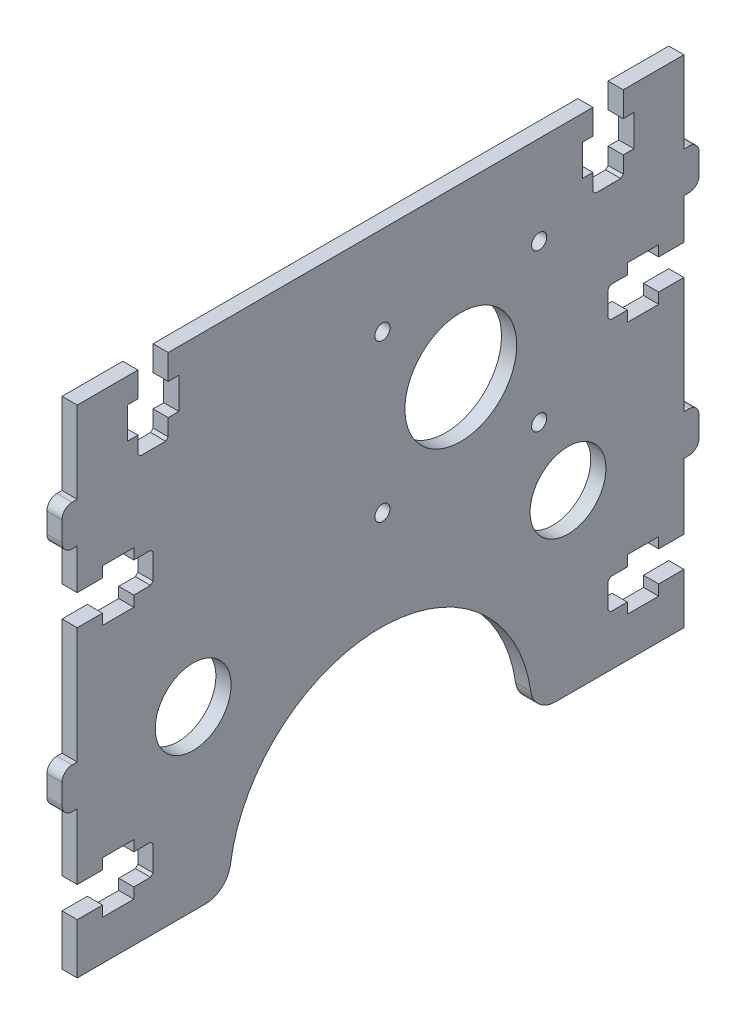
ISO-10303-21;
HEADER;
FILE_DESCRIPTION(('STEP AP214'),'2;1');
FILE_NAME('part.step','',(''),(''),'','','');
FILE_SCHEMA(('AUTOMOTIVE_DESIGN { 1 0 10303 214 1 1 1 1 }'));
ENDSEC;
DATA;
#1=APPLICATION_CONTEXT('core data for automotive mechanical design processes');
#2=APPLICATION_PROTOCOL_DEFINITION('international standard','automotive_design',2000,#1);
#3=PRODUCT_CONTEXT('',#1,'mechanical');
#4=PRODUCT('Part','Part','',(#3));
#5=PRODUCT_RELATED_PRODUCT_CATEGORY('part','',(#4));
#6=PRODUCT_DEFINITION_FORMATION('','',#4);
#7=PRODUCT_DEFINITION_CONTEXT('part definition',#1,'design');
#8=PRODUCT_DEFINITION('design','',#6,#7);
#9=PRODUCT_DEFINITION_SHAPE('','',#8);
#10=(LENGTH_UNIT() NAMED_UNIT(*) SI_UNIT(.MILLI.,.METRE.));
#11=(NAMED_UNIT(*) PLANE_ANGLE_UNIT() SI_UNIT($,.RADIAN.));
#12=(NAMED_UNIT(*) SI_UNIT($,.STERADIAN.) SOLID_ANGLE_UNIT());
#13=UNCERTAINTY_MEASURE_WITH_UNIT(LENGTH_MEASURE(1.E-05),#10,'distance_accuracy_value','');
#14=(GEOMETRIC_REPRESENTATION_CONTEXT(3) GLOBAL_UNCERTAINTY_ASSIGNED_CONTEXT((#13)) GLOBAL_UNIT_ASSIGNED_CONTEXT((#10,
#11,#12)) REPRESENTATION_CONTEXT('',''));
#15=CARTESIAN_POINT('',(0.,0.,0.));
#16=DIRECTION('',(0.,0.,1.));
#17=DIRECTION('',(1.,0.,0.));
#18=AXIS2_PLACEMENT_3D('',#15,#16,#17);
#19=CARTESIAN_POINT('',(21.0445121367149,117.193382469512,-120.5));
#20=DIRECTION('',(0.,1.,0.));
#21=DIRECTION('',(-1.,0.,0.));
#22=AXIS2_PLACEMENT_3D('',#19,#20,#21);
#23=PLANE('',#22);
#24=DIRECTION('',(1.,0.,0.));
#25=VECTOR('',#24,1.);
#26=CARTESIAN_POINT('',(37.5641370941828,117.193382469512,-120.));
#27=LINE('',#26,#25);
#28=CARTESIAN_POINT('',(36.0641370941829,117.193382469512,-120.));
#29=VERTEX_POINT('',#28);
#30=CARTESIAN_POINT('',(39.0641370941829,117.193382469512,-120.));
#31=VERTEX_POINT('',#30);
#32=EDGE_CURVE('E802',#29,#31,#27,.T.);
#33=ORIENTED_EDGE('',*,*,#32,.F.);
#34=DIRECTION('',(0.,0.,1.));
#35=VECTOR('',#34,1.);
#36=CARTESIAN_POINT('',(36.0641370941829,117.193382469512,18.7499999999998));
#37=LINE('',#36,#35);
#38=CARTESIAN_POINT('',(36.0641370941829,117.193382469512,-121.));
#39=VERTEX_POINT('',#38);
#40=EDGE_CURVE('E837',#39,#29,#37,.T.);
#41=ORIENTED_EDGE('',*,*,#40,.F.);
#42=DIRECTION('',(-1.,0.,0.));
#43=VECTOR('',#42,1.);
#44=CARTESIAN_POINT('',(37.5641370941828,117.193382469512,-121.));
#45=LINE('',#44,#43);
#46=CARTESIAN_POINT('',(39.0641370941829,117.193382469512,-121.));
#47=VERTEX_POINT('',#46);
#48=EDGE_CURVE('E816',#47,#39,#45,.T.);
#49=ORIENTED_EDGE('',*,*,#48,.F.);
#50=DIRECTION('',(0.,0.,-1.));
#51=VECTOR('',#50,1.);
#52=CARTESIAN_POINT('',(39.0641370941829,117.193382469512,18.7499999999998));
#53=LINE('',#52,#51);
#54=EDGE_CURVE('E809',#31,#47,#53,.T.);
#55=ORIENTED_EDGE('',*,*,#54,.F.);
#56=EDGE_LOOP('',(#33,#41,#49,#55));
#57=FACE_BOUND('',#56,.T.);
#58=ADVANCED_FACE('F17',(#57),#23,.F.);
#59=CARTESIAN_POINT('',(21.0445121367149,125.193382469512,-120.5));
#60=DIRECTION('',(0.,1.,0.));
#61=DIRECTION('',(-1.,0.,0.));
#62=AXIS2_PLACEMENT_3D('',#59,#60,#61);
#63=PLANE('',#62);
#64=DIRECTION('',(0.,0.,-1.));
#65=VECTOR('',#64,1.);
#66=CARTESIAN_POINT('',(39.0641370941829,125.193382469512,18.7499999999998));
#67=LINE('',#66,#65);
#68=CARTESIAN_POINT('',(39.0641370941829,125.193382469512,-121.));
#69=VERTEX_POINT('',#68);
#70=CARTESIAN_POINT('',(39.0641370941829,125.193382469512,-120.));
#71=VERTEX_POINT('',#70);
#72=EDGE_CURVE('E789',#69,#71,#67,.F.);
#73=ORIENTED_EDGE('',*,*,#72,.F.);
#74=DIRECTION('',(1.,0.,0.));
#75=VECTOR('',#74,1.);
#76=CARTESIAN_POINT('',(37.5641370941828,125.193382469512,-121.));
#77=LINE('',#76,#75);
#78=CARTESIAN_POINT('',(36.0641370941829,125.193382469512,-121.));
#79=VERTEX_POINT('',#78);
#80=EDGE_CURVE('E781',#79,#69,#77,.T.);
#81=ORIENTED_EDGE('',*,*,#80,.F.);
#82=DIRECTION('',(0.,0.,1.));
#83=VECTOR('',#82,1.);
#84=CARTESIAN_POINT('',(36.0641370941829,125.193382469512,18.7499999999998));
#85=LINE('',#84,#83);
#86=CARTESIAN_POINT('',(36.0641370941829,125.193382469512,-120.));
#87=VERTEX_POINT('',#86);
#88=EDGE_CURVE('E834',#87,#79,#85,.F.);
#89=ORIENTED_EDGE('',*,*,#88,.F.);
#90=DIRECTION('',(-1.,0.,0.));
#91=VECTOR('',#90,1.);
#92=CARTESIAN_POINT('',(37.5641370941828,125.193382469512,-120.));
#93=LINE('',#92,#91);
#94=EDGE_CURVE('E797',#71,#87,#93,.T.);
#95=ORIENTED_EDGE('',*,*,#94,.F.);
#96=EDGE_LOOP('',(#73,#81,#89,#95));
#97=FACE_BOUND('',#96,.T.);
#98=ADVANCED_FACE('F3030',(#97),#63,.T.);
#99=CARTESIAN_POINT('',(21.0445121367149,162.193382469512,-120.5));
#100=DIRECTION('',(0.,1.,-5.67893313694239E-13));
#101=DIRECTION('',(0.,5.67893313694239E-13,1.));
#102=AXIS2_PLACEMENT_3D('',#99,#100,#101);
#103=PLANE('',#102);
#104=DIRECTION('',(1.,0.,0.));
#105=VECTOR('',#104,1.);
#106=CARTESIAN_POINT('',(37.5641370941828,162.193382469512,-120.));
#107=LINE('',#106,#105);
#108=CARTESIAN_POINT('',(36.0641370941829,162.193382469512,-120.));
#109=VERTEX_POINT('',#108);
#110=CARTESIAN_POINT('',(39.0641370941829,162.193382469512,-120.));
#111=VERTEX_POINT('',#110);
#112=EDGE_CURVE('E760',#109,#111,#107,.T.);
#113=ORIENTED_EDGE('',*,*,#112,.F.);
#114=DIRECTION('',(0.,0.,1.));
#115=VECTOR('',#114,1.);
#116=CARTESIAN_POINT('',(36.0641370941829,162.193382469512,18.7499999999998));
#117=LINE('',#116,#115);
#118=CARTESIAN_POINT('',(36.0641370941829,162.193382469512,-121.));
#119=VERTEX_POINT('',#118);
#120=EDGE_CURVE('E738',#119,#109,#117,.T.);
#121=ORIENTED_EDGE('',*,*,#120,.F.);
#122=DIRECTION('',(-1.,0.,0.));
#123=VECTOR('',#122,1.);
#124=CARTESIAN_POINT('',(37.5641370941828,162.193382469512,-121.));
#125=LINE('',#124,#123);
#126=CARTESIAN_POINT('',(39.0641370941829,162.193382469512,-121.));
#127=VERTEX_POINT('',#126);
#128=EDGE_CURVE('E776',#127,#119,#125,.T.);
#129=ORIENTED_EDGE('',*,*,#128,.F.);
#130=DIRECTION('',(0.,0.,-1.));
#131=VECTOR('',#130,1.);
#132=CARTESIAN_POINT('',(39.0641370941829,162.193382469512,18.7499999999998));
#133=LINE('',#132,#131);
#134=EDGE_CURVE('E768',#111,#127,#133,.T.);
#135=ORIENTED_EDGE('',*,*,#134,.F.);
#136=EDGE_LOOP('',(#113,#121,#129,#135));
#137=FACE_BOUND('',#136,.T.);
#138=ADVANCED_FACE('F3022',(#137),#103,.F.);
#139=CARTESIAN_POINT('',(21.0445121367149,170.193382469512,-120.5));
#140=DIRECTION('',(0.,1.,-5.67893313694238E-13));
#141=DIRECTION('',(0.,5.67893313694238E-13,1.));
#142=AXIS2_PLACEMENT_3D('',#139,#140,#141);
#143=PLANE('',#142);
#144=DIRECTION('',(0.,0.,-1.));
#145=VECTOR('',#144,1.);
#146=CARTESIAN_POINT('',(39.0641370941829,170.193382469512,18.7499999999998));
#147=LINE('',#146,#145);
#148=CARTESIAN_POINT('',(39.0641370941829,170.193382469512,-121.));
#149=VERTEX_POINT('',#148);
#150=CARTESIAN_POINT('',(39.0641370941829,170.193382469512,-120.));
#151=VERTEX_POINT('',#150);
#152=EDGE_CURVE('E900',#149,#151,#147,.F.);
#153=ORIENTED_EDGE('',*,*,#152,.F.);
#154=DIRECTION('',(1.,0.,0.));
#155=VECTOR('',#154,1.);
#156=CARTESIAN_POINT('',(37.5641370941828,170.193382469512,-121.));
#157=LINE('',#156,#155);
#158=CARTESIAN_POINT('',(36.0641370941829,170.193382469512,-121.));
#159=VERTEX_POINT('',#158);
#160=EDGE_CURVE('E728',#159,#149,#157,.T.);
#161=ORIENTED_EDGE('',*,*,#160,.F.);
#162=DIRECTION('',(0.,0.,1.));
#163=VECTOR('',#162,1.);
#164=CARTESIAN_POINT('',(36.0641370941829,170.193382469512,18.7499999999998));
#165=LINE('',#164,#163);
#166=CARTESIAN_POINT('',(36.0641370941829,170.193382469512,-120.));
#167=VERTEX_POINT('',#166);
#168=EDGE_CURVE('E730',#167,#159,#165,.F.);
#169=ORIENTED_EDGE('',*,*,#168,.F.);
#170=DIRECTION('',(-1.,0.,0.));
#171=VECTOR('',#170,1.);
#172=CARTESIAN_POINT('',(37.5641370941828,170.193382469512,-120.));
#173=LINE('',#172,#171);
#174=EDGE_CURVE('E734',#151,#167,#173,.T.);
#175=ORIENTED_EDGE('',*,*,#174,.F.);
#176=EDGE_LOOP('',(#153,#161,#169,#175));
#177=FACE_BOUND('',#176,.T.);
#178=ADVANCED_FACE('F732',(#177),#143,.T.);
#179=CARTESIAN_POINT('',(36.0641370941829,170.193382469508,-2.01976470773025E-13));
#180=DIRECTION('',(0.,1.,0.));
#181=DIRECTION('',(0.,0.,1.));
#182=AXIS2_PLACEMENT_3D('',#179,#180,#181);
#183=PLANE('',#182);
#184=DIRECTION('',(0.,0.,1.));
#185=VECTOR('',#184,1.);
#186=CARTESIAN_POINT('',(39.0641370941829,170.193382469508,-2.01976470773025E-13));
#187=LINE('',#186,#185);
#188=CARTESIAN_POINT('',(39.0641370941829,170.193382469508,0.999999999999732));
#189=VERTEX_POINT('',#188);
#190=CARTESIAN_POINT('',(39.0641370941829,170.193382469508,0.));
#191=VERTEX_POINT('',#190);
#192=EDGE_CURVE('E895',#189,#191,#187,.F.);
#193=ORIENTED_EDGE('',*,*,#192,.T.);
#194=DIRECTION('',(1.,0.,0.));
#195=VECTOR('',#194,1.);
#196=CARTESIAN_POINT('',(37.5641370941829,170.193382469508,-2.01976470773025E-13));
#197=LINE('',#196,#195);
#198=CARTESIAN_POINT('',(36.0641370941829,170.193382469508,-2.02469558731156E-13));
#199=VERTEX_POINT('',#198);
#200=EDGE_CURVE('E1469',#199,#191,#197,.T.);
#201=ORIENTED_EDGE('',*,*,#200,.F.);
#202=DIRECTION('',(0.,0.,1.));
#203=VECTOR('',#202,1.);
#204=CARTESIAN_POINT('',(36.0641370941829,170.193382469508,18.7499999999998));
#205=LINE('',#204,#203);
#206=CARTESIAN_POINT('',(36.0641370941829,170.193382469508,0.999999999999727));
#207=VERTEX_POINT('',#206);
#208=EDGE_CURVE('E1473',#207,#199,#205,.F.);
#209=ORIENTED_EDGE('',*,*,#208,.F.);
#210=DIRECTION('',(-1.,0.,0.));
#211=VECTOR('',#210,1.);
#212=CARTESIAN_POINT('',(37.5641370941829,170.193382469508,0.999999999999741));
#213=LINE('',#212,#211);
#214=EDGE_CURVE('E1465',#189,#207,#213,.T.);
#215=ORIENTED_EDGE('',*,*,#214,.F.);
#216=EDGE_LOOP('',(#193,#201,#209,#215));
#217=FACE_BOUND('',#216,.T.);
#218=ADVANCED_FACE('F1880',(#217),#183,.T.);
#219=CARTESIAN_POINT('',(36.0641370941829,162.193382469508,0.999999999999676));
#220=DIRECTION('',(0.,-1.,0.));
#221=DIRECTION('',(0.,0.,-1.));
#222=AXIS2_PLACEMENT_3D('',#219,#220,#221);
#223=PLANE('',#222);
#224=DIRECTION('',(0.,0.,-1.));
#225=VECTOR('',#224,1.);
#226=CARTESIAN_POINT('',(39.0641370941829,162.193382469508,0.999999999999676));
#227=LINE('',#226,#225);
#228=CARTESIAN_POINT('',(39.0641370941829,162.193382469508,-2.6714063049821E-13));
#229=VERTEX_POINT('',#228);
#230=CARTESIAN_POINT('',(39.0641370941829,162.193382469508,0.999999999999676));
#231=VERTEX_POINT('',#230);
#232=EDGE_CURVE('E893',#229,#231,#227,.F.);
#233=ORIENTED_EDGE('',*,*,#232,.T.);
#234=DIRECTION('',(1.,0.,0.));
#235=VECTOR('',#234,1.);
#236=CARTESIAN_POINT('',(37.5641370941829,162.193382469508,0.999999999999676));
#237=LINE('',#236,#235);
#238=CARTESIAN_POINT('',(36.0641370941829,162.193382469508,0.999999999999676));
#239=VERTEX_POINT('',#238);
#240=EDGE_CURVE('E1460',#239,#231,#237,.T.);
#241=ORIENTED_EDGE('',*,*,#240,.F.);
#242=DIRECTION('',(0.,0.,1.));
#243=VECTOR('',#242,1.);
#244=CARTESIAN_POINT('',(36.0641370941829,162.193382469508,18.7499999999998));
#245=LINE('',#244,#243);
#246=CARTESIAN_POINT('',(36.0641370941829,162.193382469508,-2.67127060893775E-13));
#247=VERTEX_POINT('',#246);
#248=EDGE_CURVE('E1475',#247,#239,#245,.T.);
#249=ORIENTED_EDGE('',*,*,#248,.F.);
#250=DIRECTION('',(-1.,0.,0.));
#251=VECTOR('',#250,1.);
#252=CARTESIAN_POINT('',(37.5641370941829,162.193382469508,-2.67120276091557E-13));
#253=LINE('',#252,#251);
#254=EDGE_CURVE('E1452',#229,#247,#253,.T.);
#255=ORIENTED_EDGE('',*,*,#254,.F.);
#256=EDGE_LOOP('',(#233,#241,#249,#255));
#257=FACE_BOUND('',#256,.T.);
#258=ADVANCED_FACE('F1864',(#257),#223,.T.);
#259=CARTESIAN_POINT('',(36.0641370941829,154.193382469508,-14.5000000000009));
#260=DIRECTION('',(0.,-0.707106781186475,0.70710678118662));
#261=DIRECTION('',(0.,-0.70710678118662,-0.707106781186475));
#262=AXIS2_PLACEMENT_3D('',#259,#260,#261);
#263=PLANE('',#262);
#264=DIRECTION('',(0.,-0.70710678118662,-0.707106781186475));
#265=VECTOR('',#264,1.);
#266=CARTESIAN_POINT('',(39.0641370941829,154.193382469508,-14.5000000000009));
#267=LINE('',#266,#265);
#268=CARTESIAN_POINT('',(39.0641370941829,153.693382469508,-15.0000000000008));
#269=VERTEX_POINT('',#268);
#270=CARTESIAN_POINT('',(39.0641370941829,154.193382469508,-14.5000000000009));
#271=VERTEX_POINT('',#270);
#272=EDGE_CURVE('E891',#269,#271,#267,.F.);
#273=ORIENTED_EDGE('',*,*,#272,.T.);
#274=DIRECTION('',(1.,0.,0.));
#275=VECTOR('',#274,1.);
#276=CARTESIAN_POINT('',(37.5641370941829,154.193382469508,-14.5000000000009));
#277=LINE('',#276,#275);
#278=CARTESIAN_POINT('',(36.0641370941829,154.193382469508,-14.5000000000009));
#279=VERTEX_POINT('',#278);
#280=EDGE_CURVE('E1435',#279,#271,#277,.T.);
#281=ORIENTED_EDGE('',*,*,#280,.F.);
#282=DIRECTION('',(0.,0.707106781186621,0.707106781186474));
#283=VECTOR('',#282,1.);
#284=CARTESIAN_POINT('',(36.0641370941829,153.693382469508,-15.0000000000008));
#285=LINE('',#284,#283);
#286=CARTESIAN_POINT('',(36.0641370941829,153.693382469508,-15.0000000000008));
#287=VERTEX_POINT('',#286);
#288=EDGE_CURVE('E1477',#287,#279,#285,.T.);
#289=ORIENTED_EDGE('',*,*,#288,.F.);
#290=DIRECTION('',(-1.,0.,0.));
#291=VECTOR('',#290,1.);
#292=CARTESIAN_POINT('',(37.5641370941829,153.693382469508,-15.0000000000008));
#293=LINE('',#292,#291);
#294=EDGE_CURVE('E1426',#269,#287,#293,.T.);
#295=ORIENTED_EDGE('',*,*,#294,.F.);
#296=EDGE_LOOP('',(#273,#281,#289,#295));
#297=FACE_BOUND('',#296,.T.);
#298=ADVANCED_FACE('F1841',(#297),#263,.T.);
#299=CARTESIAN_POINT('',(36.0641370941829,148.693382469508,-15.0000000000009));
#300=DIRECTION('',(0.,0.707106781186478,0.707106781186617));
#301=DIRECTION('',(0.,-0.707106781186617,0.707106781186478));
#302=AXIS2_PLACEMENT_3D('',#299,#300,#301);
#303=PLANE('',#302);
#304=DIRECTION('',(0.,-0.707106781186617,0.707106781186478));
#305=VECTOR('',#304,1.);
#306=CARTESIAN_POINT('',(39.0641370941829,148.693382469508,-15.0000000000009));
#307=LINE('',#306,#305);
#308=CARTESIAN_POINT('',(39.0641370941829,148.193382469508,-14.500000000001));
#309=VERTEX_POINT('',#308);
#310=CARTESIAN_POINT('',(39.0641370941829,148.693382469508,-15.0000000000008));
#311=VERTEX_POINT('',#310);
#312=EDGE_CURVE('E889',#309,#311,#307,.F.);
#313=ORIENTED_EDGE('',*,*,#312,.T.);
#314=DIRECTION('',(1.,0.,0.));
#315=VECTOR('',#314,1.);
#316=CARTESIAN_POINT('',(37.5641370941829,148.693382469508,-15.0000000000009));
#317=LINE('',#316,#315);
#318=CARTESIAN_POINT('',(36.0641370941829,148.693382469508,-15.0000000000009));
#319=VERTEX_POINT('',#318);
#320=EDGE_CURVE('E1430',#319,#311,#317,.T.);
#321=ORIENTED_EDGE('',*,*,#320,.F.);
#322=DIRECTION('',(0.,0.707106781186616,-0.707106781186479));
#323=VECTOR('',#322,1.);
#324=CARTESIAN_POINT('',(36.0641370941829,148.193382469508,-14.500000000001));
#325=LINE('',#324,#323);
#326=CARTESIAN_POINT('',(36.0641370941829,148.193382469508,-14.500000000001));
#327=VERTEX_POINT('',#326);
#328=EDGE_CURVE('E1479',#327,#319,#325,.T.);
#329=ORIENTED_EDGE('',*,*,#328,.F.);
#330=DIRECTION('',(-1.,0.,0.));
#331=VECTOR('',#330,1.);
#332=CARTESIAN_POINT('',(37.5641370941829,148.193382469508,-14.500000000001));
#333=LINE('',#332,#331);
#334=EDGE_CURVE('E1422',#309,#327,#333,.T.);
#335=ORIENTED_EDGE('',*,*,#334,.F.);
#336=EDGE_LOOP('',(#313,#321,#329,#335));
#337=FACE_BOUND('',#336,.T.);
#338=ADVANCED_FACE('F1835',(#337),#303,.T.);
#339=CARTESIAN_POINT('',(36.0641370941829,125.193382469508,-7.21177063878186E-13));
#340=DIRECTION('',(0.,1.,0.));
#341=DIRECTION('',(0.,0.,1.));
#342=AXIS2_PLACEMENT_3D('',#339,#340,#341);
#343=PLANE('',#342);
#344=DIRECTION('',(0.,0.,1.));
#345=VECTOR('',#344,1.);
#346=CARTESIAN_POINT('',(39.0641370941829,125.193382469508,-7.21177063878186E-13));
#347=LINE('',#346,#345);
#348=CARTESIAN_POINT('',(39.0641370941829,125.193382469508,0.999999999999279));
#349=VERTEX_POINT('',#348);
#350=CARTESIAN_POINT('',(39.0641370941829,125.193382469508,-5.04570580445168E-13));
#351=VERTEX_POINT('',#350);
#352=EDGE_CURVE('E887',#349,#351,#347,.F.);
#353=ORIENTED_EDGE('',*,*,#352,.T.);
#354=DIRECTION('',(1.,0.,0.));
#355=VECTOR('',#354,1.);
#356=CARTESIAN_POINT('',(37.5641370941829,125.193382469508,-7.21177063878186E-13));
#357=LINE('',#356,#355);
#358=CARTESIAN_POINT('',(36.0641370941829,125.193382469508,-7.21294039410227E-13));
#359=VERTEX_POINT('',#358);
#360=EDGE_CURVE('E1405',#359,#351,#357,.T.);
#361=ORIENTED_EDGE('',*,*,#360,.F.);
#362=DIRECTION('',(0.,0.,1.));
#363=VECTOR('',#362,1.);
#364=CARTESIAN_POINT('',(36.0641370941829,125.193382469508,18.7499999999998));
#365=LINE('',#364,#363);
#366=CARTESIAN_POINT('',(36.0641370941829,125.193382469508,0.999999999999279));
#367=VERTEX_POINT('',#366);
#368=EDGE_CURVE('E1481',#367,#359,#365,.F.);
#369=ORIENTED_EDGE('',*,*,#368,.F.);
#370=DIRECTION('',(-1.,0.,0.));
#371=VECTOR('',#370,1.);
#372=CARTESIAN_POINT('',(37.5641370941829,125.193382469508,0.999999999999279));
#373=LINE('',#372,#371);
#374=EDGE_CURVE('E1397',#349,#367,#373,.T.);
#375=ORIENTED_EDGE('',*,*,#374,.F.);
#376=EDGE_LOOP('',(#353,#361,#369,#375));
#377=FACE_BOUND('',#376,.T.);
#378=ADVANCED_FACE('F1811',(#377),#343,.T.);
#379=CARTESIAN_POINT('',(36.0641370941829,117.193382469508,0.999999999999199));
#380=DIRECTION('',(0.,-1.,0.));
#381=DIRECTION('',(0.,0.,-1.));
#382=AXIS2_PLACEMENT_3D('',#379,#380,#381);
#383=PLANE('',#382);
#384=DIRECTION('',(0.,0.,-1.));
#385=VECTOR('',#384,1.);
#386=CARTESIAN_POINT('',(39.0641370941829,117.193382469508,0.999999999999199));
#387=LINE('',#386,#385);
#388=CARTESIAN_POINT('',(39.0641370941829,117.193382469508,-8.00997774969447E-13));
#389=VERTEX_POINT('',#388);
#390=CARTESIAN_POINT('',(39.0641370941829,117.193382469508,0.999999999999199));
#391=VERTEX_POINT('',#390);
#392=EDGE_CURVE('E885',#389,#391,#387,.F.);
#393=ORIENTED_EDGE('',*,*,#392,.T.);
#394=DIRECTION('',(1.,0.,0.));
#395=VECTOR('',#394,1.);
#396=CARTESIAN_POINT('',(37.5641370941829,117.193382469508,0.999999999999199));
#397=LINE('',#396,#395);
#398=CARTESIAN_POINT('',(36.0641370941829,117.193382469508,0.999999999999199));
#399=VERTEX_POINT('',#398);
#400=EDGE_CURVE('E1392',#399,#391,#397,.T.);
#401=ORIENTED_EDGE('',*,*,#400,.F.);
#402=DIRECTION('',(0.,0.,1.));
#403=VECTOR('',#402,1.);
#404=CARTESIAN_POINT('',(36.0641370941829,117.193382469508,18.7499999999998));
#405=LINE('',#404,#403);
#406=CARTESIAN_POINT('',(36.0641370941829,117.193382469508,-8.00759354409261E-13));
#407=VERTEX_POINT('',#406);
#408=EDGE_CURVE('E1483',#407,#399,#405,.T.);
#409=ORIENTED_EDGE('',*,*,#408,.F.);
#410=DIRECTION('',(-1.,0.,0.));
#411=VECTOR('',#410,1.);
#412=CARTESIAN_POINT('',(37.5641370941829,117.193382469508,-8.0053172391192E-13));
#413=LINE('',#412,#411);
#414=EDGE_CURVE('E1384',#389,#407,#413,.T.);
#415=ORIENTED_EDGE('',*,*,#414,.F.);
#416=EDGE_LOOP('',(#393,#401,#409,#415));
#417=FACE_BOUND('',#416,.T.);
#418=ADVANCED_FACE('F1796',(#417),#383,.T.);
#419=CARTESIAN_POINT('',(36.0641370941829,104.193382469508,-14.5000000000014));
#420=DIRECTION('',(0.,-0.707106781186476,0.707106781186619));
#421=DIRECTION('',(0.,-0.707106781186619,-0.707106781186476));
#422=AXIS2_PLACEMENT_3D('',#419,#420,#421);
#423=PLANE('',#422);
#424=DIRECTION('',(0.,-0.707106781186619,-0.707106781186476));
#425=VECTOR('',#424,1.);
#426=CARTESIAN_POINT('',(39.0641370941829,104.193382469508,-14.5000000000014));
#427=LINE('',#426,#425);
#428=CARTESIAN_POINT('',(39.0641370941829,103.693382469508,-15.0000000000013));
#429=VERTEX_POINT('',#428);
#430=CARTESIAN_POINT('',(39.0641370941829,104.193382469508,-14.5000000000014));
#431=VERTEX_POINT('',#430);
#432=EDGE_CURVE('E883',#429,#431,#427,.F.);
#433=ORIENTED_EDGE('',*,*,#432,.T.);
#434=DIRECTION('',(1.,0.,0.));
#435=VECTOR('',#434,1.);
#436=CARTESIAN_POINT('',(37.5641370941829,104.193382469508,-14.5000000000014));
#437=LINE('',#436,#435);
#438=CARTESIAN_POINT('',(36.0641370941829,104.193382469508,-14.5000000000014));
#439=VERTEX_POINT('',#438);
#440=EDGE_CURVE('E1367',#439,#431,#437,.T.);
#441=ORIENTED_EDGE('',*,*,#440,.F.);
#442=DIRECTION('',(0.,0.707106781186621,0.707106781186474));
#443=VECTOR('',#442,1.);
#444=CARTESIAN_POINT('',(36.0641370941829,103.693382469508,-15.0000000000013));
#445=LINE('',#444,#443);
#446=CARTESIAN_POINT('',(36.0641370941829,103.693382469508,-15.0000000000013));
#447=VERTEX_POINT('',#446);
#448=EDGE_CURVE('E1485',#447,#439,#445,.T.);
#449=ORIENTED_EDGE('',*,*,#448,.F.);
#450=DIRECTION('',(-1.,0.,0.));
#451=VECTOR('',#450,1.);
#452=CARTESIAN_POINT('',(37.5641370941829,103.693382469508,-15.0000000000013));
#453=LINE('',#452,#451);
#454=EDGE_CURVE('E1358',#429,#447,#453,.T.);
#455=ORIENTED_EDGE('',*,*,#454,.F.);
#456=EDGE_LOOP('',(#433,#441,#449,#455));
#457=FACE_BOUND('',#456,.T.);
#458=ADVANCED_FACE('F1775',(#457),#423,.T.);
#459=CARTESIAN_POINT('',(36.0641370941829,98.6933824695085,-15.0000000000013));
#460=DIRECTION('',(0.,0.707106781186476,0.707106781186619));
#461=DIRECTION('',(0.,-0.707106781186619,0.707106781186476));
#462=AXIS2_PLACEMENT_3D('',#459,#460,#461);
#463=PLANE('',#462);
#464=DIRECTION('',(0.,-0.707106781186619,0.707106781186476));
#465=VECTOR('',#464,1.);
#466=CARTESIAN_POINT('',(39.0641370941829,98.6933824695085,-15.0000000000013));
#467=LINE('',#466,#465);
#468=CARTESIAN_POINT('',(39.0641370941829,98.1933824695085,-14.5000000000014));
#469=VERTEX_POINT('',#468);
#470=CARTESIAN_POINT('',(39.0641370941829,98.6933824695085,-15.0000000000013));
#471=VERTEX_POINT('',#470);
#472=EDGE_CURVE('E881',#469,#471,#467,.F.);
#473=ORIENTED_EDGE('',*,*,#472,.T.);
#474=DIRECTION('',(1.,0.,0.));
#475=VECTOR('',#474,1.);
#476=CARTESIAN_POINT('',(37.5641370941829,98.6933824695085,-15.0000000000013));
#477=LINE('',#476,#475);
#478=CARTESIAN_POINT('',(36.0641370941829,98.6933824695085,-15.0000000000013));
#479=VERTEX_POINT('',#478);
#480=EDGE_CURVE('E1362',#479,#471,#477,.T.);
#481=ORIENTED_EDGE('',*,*,#480,.F.);
#482=DIRECTION('',(0.,0.707106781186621,-0.707106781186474));
#483=VECTOR('',#482,1.);
#484=CARTESIAN_POINT('',(36.0641370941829,98.1933824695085,-14.5000000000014));
#485=LINE('',#484,#483);
#486=CARTESIAN_POINT('',(36.0641370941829,98.1933824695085,-14.5000000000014));
#487=VERTEX_POINT('',#486);
#488=EDGE_CURVE('E852',#487,#479,#485,.T.);
#489=ORIENTED_EDGE('',*,*,#488,.F.);
#490=DIRECTION('',(-1.,0.,0.));
#491=VECTOR('',#490,1.);
#492=CARTESIAN_POINT('',(37.5641370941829,98.1933824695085,-14.5000000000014));
#493=LINE('',#492,#491);
#494=EDGE_CURVE('E1354',#469,#487,#493,.T.);
#495=ORIENTED_EDGE('',*,*,#494,.F.);
#496=EDGE_LOOP('',(#473,#481,#489,#495));
#497=FACE_BOUND('',#496,.T.);
#498=ADVANCED_FACE('F1494',(#497),#463,.T.);
#499=CARTESIAN_POINT('',(36.0641370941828,98.1933824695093,-105.5));
#500=DIRECTION('',(0.,0.707106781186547,-0.707106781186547));
#501=DIRECTION('',(0.,0.707106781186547,0.707106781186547));
#502=AXIS2_PLACEMENT_3D('',#499,#500,#501);
#503=PLANE('',#502);
#504=DIRECTION('',(0.,0.707106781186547,0.707106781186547));
#505=VECTOR('',#504,1.);
#506=CARTESIAN_POINT('',(39.0641370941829,98.1933824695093,-105.5));
#507=LINE('',#506,#505);
#508=CARTESIAN_POINT('',(39.0641370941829,98.6933824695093,-105.));
#509=VERTEX_POINT('',#508);
#510=CARTESIAN_POINT('',(39.0641370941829,98.1933824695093,-105.5));
#511=VERTEX_POINT('',#510);
#512=EDGE_CURVE('E879',#509,#511,#507,.F.);
#513=ORIENTED_EDGE('',*,*,#512,.T.);
#514=DIRECTION('',(1.,0.,0.));
#515=VECTOR('',#514,1.);
#516=CARTESIAN_POINT('',(37.5641370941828,98.1933824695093,-105.5));
#517=LINE('',#516,#515);
#518=CARTESIAN_POINT('',(36.0641370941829,98.1933824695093,-105.5));
#519=VERTEX_POINT('',#518);
#520=EDGE_CURVE('E1293',#519,#511,#517,.T.);
#521=ORIENTED_EDGE('',*,*,#520,.F.);
#522=DIRECTION('',(0.,-0.707106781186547,-0.707106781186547));
#523=VECTOR('',#522,1.);
#524=CARTESIAN_POINT('',(36.0641370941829,98.6933824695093,-105.));
#525=LINE('',#524,#523);
#526=CARTESIAN_POINT('',(36.0641370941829,98.6933824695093,-105.));
#527=VERTEX_POINT('',#526);
#528=EDGE_CURVE('E847',#527,#519,#525,.T.);
#529=ORIENTED_EDGE('',*,*,#528,.F.);
#530=DIRECTION('',(-1.,0.,0.));
#531=VECTOR('',#530,1.);
#532=CARTESIAN_POINT('',(37.5641370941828,98.6933824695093,-105.));
#533=LINE('',#532,#531);
#534=EDGE_CURVE('E1284',#509,#527,#533,.T.);
#535=ORIENTED_EDGE('',*,*,#534,.F.);
#536=EDGE_LOOP('',(#513,#521,#529,#535));
#537=FACE_BOUND('',#536,.T.);
#538=ADVANCED_FACE('F2940',(#537),#503,.T.);
#539=CARTESIAN_POINT('',(36.0641370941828,103.693382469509,-105.));
#540=DIRECTION('',(0.,-0.707106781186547,-0.707106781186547));
#541=DIRECTION('',(0.,0.707106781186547,-0.707106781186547));
#542=AXIS2_PLACEMENT_3D('',#539,#540,#541);
#543=PLANE('',#542);
#544=DIRECTION('',(0.,0.707106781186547,-0.707106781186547));
#545=VECTOR('',#544,1.);
#546=CARTESIAN_POINT('',(39.0641370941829,103.693382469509,-105.));
#547=LINE('',#546,#545);
#548=CARTESIAN_POINT('',(39.0641370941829,104.193382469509,-105.5));
#549=VERTEX_POINT('',#548);
#550=CARTESIAN_POINT('',(39.0641370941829,103.693382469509,-105.));
#551=VERTEX_POINT('',#550);
#552=EDGE_CURVE('E877',#549,#551,#547,.F.);
#553=ORIENTED_EDGE('',*,*,#552,.T.);
#554=DIRECTION('',(1.,0.,0.));
#555=VECTOR('',#554,1.);
#556=CARTESIAN_POINT('',(37.5641370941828,103.693382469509,-105.));
#557=LINE('',#556,#555);
#558=CARTESIAN_POINT('',(36.0641370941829,103.693382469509,-105.));
#559=VERTEX_POINT('',#558);
#560=EDGE_CURVE('E1288',#559,#551,#557,.T.);
#561=ORIENTED_EDGE('',*,*,#560,.F.);
#562=DIRECTION('',(0.,-0.707106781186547,0.707106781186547));
#563=VECTOR('',#562,1.);
#564=CARTESIAN_POINT('',(36.0641370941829,104.193382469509,-105.5));
#565=LINE('',#564,#563);
#566=CARTESIAN_POINT('',(36.0641370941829,104.193382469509,-105.5));
#567=VERTEX_POINT('',#566);
#568=EDGE_CURVE('E844',#567,#559,#565,.T.);
#569=ORIENTED_EDGE('',*,*,#568,.F.);
#570=DIRECTION('',(-1.,0.,0.));
#571=VECTOR('',#570,1.);
#572=CARTESIAN_POINT('',(37.5641370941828,104.193382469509,-105.5));
#573=LINE('',#572,#571);
#574=EDGE_CURVE('E1280',#549,#567,#573,.T.);
#575=ORIENTED_EDGE('',*,*,#574,.F.);
#576=EDGE_LOOP('',(#553,#561,#569,#575));
#577=FACE_BOUND('',#576,.T.);
#578=ADVANCED_FACE('F2930',(#577),#543,.T.);
#579=CARTESIAN_POINT('',(36.0641370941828,148.193382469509,-105.5));
#580=DIRECTION('',(0.,0.707106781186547,-0.707106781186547));
#581=DIRECTION('',(0.,0.707106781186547,0.707106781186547));
#582=AXIS2_PLACEMENT_3D('',#579,#580,#581);
#583=PLANE('',#582);
#584=DIRECTION('',(0.,0.707106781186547,0.707106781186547));
#585=VECTOR('',#584,1.);
#586=CARTESIAN_POINT('',(39.0641370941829,148.193382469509,-105.5));
#587=LINE('',#586,#585);
#588=CARTESIAN_POINT('',(39.0641370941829,148.693382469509,-105.));
#589=VERTEX_POINT('',#588);
#590=CARTESIAN_POINT('',(39.0641370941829,148.193382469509,-105.5));
#591=VERTEX_POINT('',#590);
#592=EDGE_CURVE('E875',#589,#591,#587,.F.);
#593=ORIENTED_EDGE('',*,*,#592,.T.);
#594=DIRECTION('',(1.,0.,0.));
#595=VECTOR('',#594,1.);
#596=CARTESIAN_POINT('',(37.5641370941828,148.193382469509,-105.5));
#597=LINE('',#596,#595);
#598=CARTESIAN_POINT('',(36.0641370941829,148.193382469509,-105.5));
#599=VERTEX_POINT('',#598);
#600=EDGE_CURVE('E1246',#599,#591,#597,.T.);
#601=ORIENTED_EDGE('',*,*,#600,.F.);
#602=DIRECTION('',(0.,-0.707106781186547,-0.707106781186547));
#603=VECTOR('',#602,1.);
#604=CARTESIAN_POINT('',(36.0641370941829,148.693382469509,-105.));
#605=LINE('',#604,#603);
#606=CARTESIAN_POINT('',(36.0641370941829,148.693382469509,-105.));
#607=VERTEX_POINT('',#606);
#608=EDGE_CURVE('E838',#607,#599,#605,.T.);
#609=ORIENTED_EDGE('',*,*,#608,.F.);
#610=DIRECTION('',(-1.,0.,0.));
#611=VECTOR('',#610,1.);
#612=CARTESIAN_POINT('',(37.5641370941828,148.693382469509,-105.));
#613=LINE('',#612,#611);
#614=EDGE_CURVE('E1237',#589,#607,#613,.T.);
#615=ORIENTED_EDGE('',*,*,#614,.F.);
#616=EDGE_LOOP('',(#593,#601,#609,#615));
#617=FACE_BOUND('',#616,.T.);
#618=ADVANCED_FACE('F2920',(#617),#583,.T.);
#619=CARTESIAN_POINT('',(36.0641370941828,153.693382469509,-105.));
#620=DIRECTION('',(0.,-0.707106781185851,-0.707106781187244));
#621=DIRECTION('',(0.,0.707106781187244,-0.707106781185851));
#622=AXIS2_PLACEMENT_3D('',#619,#620,#621);
#623=PLANE('',#622);
#624=DIRECTION('',(0.,0.707106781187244,-0.707106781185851));
#625=VECTOR('',#624,1.);
#626=CARTESIAN_POINT('',(39.0641370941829,153.693382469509,-105.));
#627=LINE('',#626,#625);
#628=CARTESIAN_POINT('',(39.0641370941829,154.193382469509,-105.499999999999));
#629=VERTEX_POINT('',#628);
#630=CARTESIAN_POINT('',(39.0641370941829,153.693382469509,-105.));
#631=VERTEX_POINT('',#630);
#632=EDGE_CURVE('E873',#629,#631,#627,.F.);
#633=ORIENTED_EDGE('',*,*,#632,.T.);
#634=DIRECTION('',(1.,0.,0.));
#635=VECTOR('',#634,1.);
#636=CARTESIAN_POINT('',(37.5641370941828,153.693382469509,-105.));
#637=LINE('',#636,#635);
#638=CARTESIAN_POINT('',(36.0641370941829,153.693382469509,-105.));
#639=VERTEX_POINT('',#638);
#640=EDGE_CURVE('E1241',#639,#631,#637,.T.);
#641=ORIENTED_EDGE('',*,*,#640,.F.);
#642=DIRECTION('',(0.,-0.707106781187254,0.707106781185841));
#643=VECTOR('',#642,1.);
#644=CARTESIAN_POINT('',(36.0641370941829,154.193382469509,-105.499999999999));
#645=LINE('',#644,#643);
#646=CARTESIAN_POINT('',(36.0641370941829,154.193382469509,-105.499999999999));
#647=VERTEX_POINT('',#646);
#648=EDGE_CURVE('E828',#647,#639,#645,.T.);
#649=ORIENTED_EDGE('',*,*,#648,.F.);
#650=DIRECTION('',(-1.,0.,0.));
#651=VECTOR('',#650,1.);
#652=CARTESIAN_POINT('',(37.5641370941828,154.193382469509,-105.499999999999));
#653=LINE('',#652,#651);
#654=EDGE_CURVE('E1233',#629,#647,#653,.T.);
#655=ORIENTED_EDGE('',*,*,#654,.F.);
#656=EDGE_LOOP('',(#633,#641,#649,#655));
#657=FACE_BOUND('',#656,.T.);
#658=ADVANCED_FACE('F2911',(#657),#623,.T.);
#659=CARTESIAN_POINT('',(36.0641370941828,171.881628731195,-108.000000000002));
#660=DIRECTION('',(0.,0.707106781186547,0.707106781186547));
#661=DIRECTION('',(0.,-0.707106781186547,0.707106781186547));
#662=AXIS2_PLACEMENT_3D('',#659,#660,#661);
#663=PLANE('',#662);
#664=DIRECTION('',(0.,-0.707106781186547,0.707106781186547));
#665=VECTOR('',#664,1.);
#666=CARTESIAN_POINT('',(39.0641370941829,171.881628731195,-108.000000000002));
#667=LINE('',#666,#665);
#668=CARTESIAN_POINT('',(39.0641370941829,171.381628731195,-107.500000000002));
#669=VERTEX_POINT('',#668);
#670=CARTESIAN_POINT('',(39.0641370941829,171.881628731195,-108.000000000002));
#671=VERTEX_POINT('',#670);
#672=EDGE_CURVE('E871',#669,#671,#667,.F.);
#673=ORIENTED_EDGE('',*,*,#672,.T.);
#674=DIRECTION('',(1.,0.,0.));
#675=VECTOR('',#674,1.);
#676=CARTESIAN_POINT('',(37.5641370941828,171.881628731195,-108.000000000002));
#677=LINE('',#676,#675);
#678=CARTESIAN_POINT('',(36.0641370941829,171.881628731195,-108.000000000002));
#679=VERTEX_POINT('',#678);
#680=EDGE_CURVE('E1199',#679,#671,#677,.T.);
#681=ORIENTED_EDGE('',*,*,#680,.F.);
#682=DIRECTION('',(0.,0.707106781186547,-0.707106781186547));
#683=VECTOR('',#682,1.);
#684=CARTESIAN_POINT('',(36.0641370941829,171.381628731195,-107.500000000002));
#685=LINE('',#684,#683);
#686=CARTESIAN_POINT('',(36.0641370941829,171.381628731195,-107.500000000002));
#687=VERTEX_POINT('',#686);
#688=EDGE_CURVE('E739',#687,#679,#685,.T.);
#689=ORIENTED_EDGE('',*,*,#688,.F.);
#690=DIRECTION('',(-1.,0.,0.));
#691=VECTOR('',#690,1.);
#692=CARTESIAN_POINT('',(37.5641370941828,171.381628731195,-107.500000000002));
#693=LINE('',#692,#691);
#694=EDGE_CURVE('E1190',#669,#687,#693,.T.);
#695=ORIENTED_EDGE('',*,*,#694,.F.);
#696=EDGE_LOOP('',(#673,#681,#689,#695));
#697=FACE_BOUND('',#696,.T.);
#698=ADVANCED_FACE('F1936',(#697),#663,.T.);
#699=CARTESIAN_POINT('',(36.0641370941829,171.381628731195,-102.500000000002));
#700=DIRECTION('',(0.,0.707106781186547,-0.707106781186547));
#701=DIRECTION('',(0.,0.707106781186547,0.707106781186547));
#702=AXIS2_PLACEMENT_3D('',#699,#700,#701);
#703=PLANE('',#702);
#704=DIRECTION('',(0.,0.707106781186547,0.707106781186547));
#705=VECTOR('',#704,1.);
#706=CARTESIAN_POINT('',(39.0641370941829,171.381628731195,-102.500000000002));
#707=LINE('',#706,#705);
#708=CARTESIAN_POINT('',(39.0641370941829,171.881628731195,-102.000000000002));
#709=VERTEX_POINT('',#708);
#710=CARTESIAN_POINT('',(39.0641370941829,171.381628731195,-102.500000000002));
#711=VERTEX_POINT('',#710);
#712=EDGE_CURVE('E869',#709,#711,#707,.F.);
#713=ORIENTED_EDGE('',*,*,#712,.T.);
#714=DIRECTION('',(1.,0.,0.));
#715=VECTOR('',#714,1.);
#716=CARTESIAN_POINT('',(37.5641370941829,171.381628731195,-102.500000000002));
#717=LINE('',#716,#715);
#718=CARTESIAN_POINT('',(36.0641370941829,171.381628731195,-102.500000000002));
#719=VERTEX_POINT('',#718);
#720=EDGE_CURVE('E1194',#719,#711,#717,.T.);
#721=ORIENTED_EDGE('',*,*,#720,.F.);
#722=DIRECTION('',(0.,-0.707106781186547,-0.707106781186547));
#723=VECTOR('',#722,1.);
#724=CARTESIAN_POINT('',(36.0641370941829,171.881628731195,-102.000000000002));
#725=LINE('',#724,#723);
#726=CARTESIAN_POINT('',(36.0641370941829,171.881628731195,-102.000000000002));
#727=VERTEX_POINT('',#726);
#728=EDGE_CURVE('E859',#727,#719,#725,.T.);
#729=ORIENTED_EDGE('',*,*,#728,.F.);
#730=DIRECTION('',(-1.,0.,0.));
#731=VECTOR('',#730,1.);
#732=CARTESIAN_POINT('',(37.5641370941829,171.881628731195,-102.000000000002));
#733=LINE('',#732,#731);
#734=EDGE_CURVE('E1186',#709,#727,#733,.T.);
#735=ORIENTED_EDGE('',*,*,#734,.F.);
#736=EDGE_LOOP('',(#713,#721,#729,#735));
#737=FACE_BOUND('',#736,.T.);
#738=ADVANCED_FACE('F1940',(#737),#703,.T.);
#739=CARTESIAN_POINT('',(36.0641370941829,171.881628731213,-18.0000000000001));
#740=DIRECTION('',(0.,0.707106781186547,0.707106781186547));
#741=DIRECTION('',(0.,-0.707106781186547,0.707106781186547));
#742=AXIS2_PLACEMENT_3D('',#739,#740,#741);
#743=PLANE('',#742);
#744=DIRECTION('',(0.,-0.707106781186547,0.707106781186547));
#745=VECTOR('',#744,1.);
#746=CARTESIAN_POINT('',(39.0641370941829,171.881628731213,-18.0000000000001));
#747=LINE('',#746,#745);
#748=CARTESIAN_POINT('',(39.0641370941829,171.381628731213,-17.5000000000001));
#749=VERTEX_POINT('',#748);
#750=CARTESIAN_POINT('',(39.0641370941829,171.881628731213,-18.0000000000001));
#751=VERTEX_POINT('',#750);
#752=EDGE_CURVE('E867',#749,#751,#747,.F.);
#753=ORIENTED_EDGE('',*,*,#752,.T.);
#754=DIRECTION('',(1.,0.,0.));
#755=VECTOR('',#754,1.);
#756=CARTESIAN_POINT('',(37.5641370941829,171.881628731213,-18.0000000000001));
#757=LINE('',#756,#755);
#758=CARTESIAN_POINT('',(36.0641370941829,171.881628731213,-18.0000000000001));
#759=VERTEX_POINT('',#758);
#760=EDGE_CURVE('E1149',#759,#751,#757,.T.);
#761=ORIENTED_EDGE('',*,*,#760,.F.);
#762=DIRECTION('',(0.,0.707106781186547,-0.707106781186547));
#763=VECTOR('',#762,1.);
#764=CARTESIAN_POINT('',(36.0641370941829,171.381628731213,-17.5000000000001));
#765=LINE('',#764,#763);
#766=CARTESIAN_POINT('',(36.0641370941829,171.381628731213,-17.5000000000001));
#767=VERTEX_POINT('',#766);
#768=EDGE_CURVE('E861',#767,#759,#765,.T.);
#769=ORIENTED_EDGE('',*,*,#768,.F.);
#770=DIRECTION('',(-1.,0.,0.));
#771=VECTOR('',#770,1.);
#772=CARTESIAN_POINT('',(37.5641370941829,171.381628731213,-17.5000000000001));
#773=LINE('',#772,#771);
#774=EDGE_CURVE('E1140',#749,#767,#773,.T.);
#775=ORIENTED_EDGE('',*,*,#774,.F.);
#776=EDGE_LOOP('',(#753,#761,#769,#775));
#777=FACE_BOUND('',#776,.T.);
#778=ADVANCED_FACE('F1976',(#777),#743,.T.);
#779=CARTESIAN_POINT('',(36.0641370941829,171.381628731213,-12.5000000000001));
#780=DIRECTION('',(0.,0.707106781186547,-0.707106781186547));
#781=DIRECTION('',(0.,0.707106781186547,0.707106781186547));
#782=AXIS2_PLACEMENT_3D('',#779,#780,#781);
#783=PLANE('',#782);
#784=DIRECTION('',(0.,0.707106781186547,0.707106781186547));
#785=VECTOR('',#784,1.);
#786=CARTESIAN_POINT('',(39.0641370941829,171.381628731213,-12.5000000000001));
#787=LINE('',#786,#785);
#788=CARTESIAN_POINT('',(39.0641370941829,171.881628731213,-12.0000000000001));
#789=VERTEX_POINT('',#788);
#790=CARTESIAN_POINT('',(39.0641370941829,171.381628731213,-12.5000000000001));
#791=VERTEX_POINT('',#790);
#792=EDGE_CURVE('E865',#789,#791,#787,.F.);
#793=ORIENTED_EDGE('',*,*,#792,.T.);
#794=DIRECTION('',(1.,0.,0.));
#795=VECTOR('',#794,1.);
#796=CARTESIAN_POINT('',(37.5641370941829,171.381628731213,-12.5000000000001));
#797=LINE('',#796,#795);
#798=CARTESIAN_POINT('',(36.0641370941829,171.381628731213,-12.5000000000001));
#799=VERTEX_POINT('',#798);
#800=EDGE_CURVE('E1144',#799,#791,#797,.T.);
#801=ORIENTED_EDGE('',*,*,#800,.F.);
#802=DIRECTION('',(0.,-0.707106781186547,-0.707106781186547));
#803=VECTOR('',#802,1.);
#804=CARTESIAN_POINT('',(36.0641370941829,171.881628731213,-12.0000000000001));
#805=LINE('',#804,#803);
#806=CARTESIAN_POINT('',(36.0641370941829,171.881628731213,-12.0000000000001));
#807=VERTEX_POINT('',#806);
#808=EDGE_CURVE('E863',#807,#799,#805,.T.);
#809=ORIENTED_EDGE('',*,*,#808,.F.);
#810=DIRECTION('',(-1.,0.,0.));
#811=VECTOR('',#810,1.);
#812=CARTESIAN_POINT('',(37.5641370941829,171.881628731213,-12.0000000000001));
#813=LINE('',#812,#811);
#814=EDGE_CURVE('E1136',#789,#807,#813,.T.);
#815=ORIENTED_EDGE('',*,*,#814,.F.);
#816=EDGE_LOOP('',(#793,#801,#809,#815));
#817=FACE_BOUND('',#816,.T.);
#818=ADVANCED_FACE('F1985',(#817),#783,.T.);
#819=CARTESIAN_POINT('',(36.0641370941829,198.598909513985,18.7499999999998));
#820=DIRECTION('',(-1.,0.,0.));
#821=DIRECTION('',(0.,0.,1.));
#822=AXIS2_PLACEMENT_3D('',#819,#820,#821);
#823=PLANE('',#822);
#824=CARTESIAN_POINT('',(36.0641370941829,153.193382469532,-75.8651969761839));
#825=DIRECTION('',(1.,0.,0.));
#826=DIRECTION('',(0.,0.,-1.));
#827=AXIS2_PLACEMENT_3D('',#824,#825,#826);
#828=CIRCLE('',#827,11.0500000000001);
#829=CARTESIAN_POINT('',(36.0641370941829,153.193382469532,-86.9151969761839));
#830=VERTEX_POINT('',#829);
#831=EDGE_CURVE('E1096',#830,#830,#828,.F.);
#832=ORIENTED_EDGE('',*,*,#831,.F.);
#833=EDGE_LOOP('',(#832));
#834=FACE_BOUND('',#833,.T.);
#835=CARTESIAN_POINT('',(36.0641370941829,168.693382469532,-60.3651969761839));
#836=DIRECTION('',(1.,0.,0.));
#837=DIRECTION('',(0.,0.,-1.));
#838=AXIS2_PLACEMENT_3D('',#835,#836,#837);
#839=CIRCLE('',#838,1.49999999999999);
#840=CARTESIAN_POINT('',(36.0641370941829,168.693382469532,-61.8651969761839));
#841=VERTEX_POINT('',#840);
#842=EDGE_CURVE('E1099',#841,#841,#839,.F.);
#843=ORIENTED_EDGE('',*,*,#842,.F.);
#844=EDGE_LOOP('',(#843));
#845=FACE_BOUND('',#844,.T.);
#846=CARTESIAN_POINT('',(36.0641370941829,137.693382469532,-60.3651969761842));
#847=DIRECTION('',(1.,0.,0.));
#848=DIRECTION('',(0.,0.,-1.));
#849=AXIS2_PLACEMENT_3D('',#846,#847,#848);
#850=CIRCLE('',#849,1.5);
#851=CARTESIAN_POINT('',(36.0641370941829,137.693382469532,-61.8651969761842));
#852=VERTEX_POINT('',#851);
#853=EDGE_CURVE('E1102',#852,#852,#850,.F.);
#854=ORIENTED_EDGE('',*,*,#853,.F.);
#855=EDGE_LOOP('',(#854));
#856=FACE_BOUND('',#855,.T.);
#857=CARTESIAN_POINT('',(36.0641370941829,137.693382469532,-91.3651969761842));
#858=DIRECTION('',(1.,0.,0.));
#859=DIRECTION('',(0.,0.,-1.));
#860=AXIS2_PLACEMENT_3D('',#857,#858,#859);
#861=CIRCLE('',#860,1.49999999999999);
#862=CARTESIAN_POINT('',(36.0641370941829,137.693382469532,-92.8651969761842));
#863=VERTEX_POINT('',#862);
#864=EDGE_CURVE('E1105',#863,#863,#861,.F.);
#865=ORIENTED_EDGE('',*,*,#864,.F.);
#866=EDGE_LOOP('',(#865));
#867=FACE_BOUND('',#866,.T.);
#868=CARTESIAN_POINT('',(36.0641370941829,168.693382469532,-91.3651969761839));
#869=DIRECTION('',(1.,0.,0.));
#870=DIRECTION('',(0.,0.,-1.));
#871=AXIS2_PLACEMENT_3D('',#868,#869,#870);
#872=CIRCLE('',#871,1.5);
#873=CARTESIAN_POINT('',(36.0641370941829,168.693382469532,-92.8651969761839));
#874=VERTEX_POINT('',#873);
#875=EDGE_CURVE('E1108',#874,#874,#872,.F.);
#876=ORIENTED_EDGE('',*,*,#875,.F.);
#877=EDGE_LOOP('',(#876));
#878=FACE_BOUND('',#877,.T.);
#879=CARTESIAN_POINT('',(36.0641370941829,123.193382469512,-97.0705080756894));
#880=DIRECTION('',(1.,0.,0.));
#881=DIRECTION('',(0.,0.,-1.));
#882=AXIS2_PLACEMENT_3D('',#879,#880,#881);
#883=CIRCLE('',#882,7.50000000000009);
#884=CARTESIAN_POINT('',(36.0641370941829,123.193382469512,-104.570508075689));
#885=VERTEX_POINT('',#884);
#886=EDGE_CURVE('E1111',#885,#885,#883,.F.);
#887=ORIENTED_EDGE('',*,*,#886,.F.);
#888=EDGE_LOOP('',(#887));
#889=FACE_BOUND('',#888,.T.);
#890=CARTESIAN_POINT('',(36.0641370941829,123.193382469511,-22.9294919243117));
#891=DIRECTION('',(1.,0.,0.));
#892=DIRECTION('',(0.,0.,-1.));
#893=AXIS2_PLACEMENT_3D('',#890,#891,#892);
#894=CIRCLE('',#893,7.5);
#895=CARTESIAN_POINT('',(36.0641370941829,123.193382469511,-30.4294919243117));
#896=VERTEX_POINT('',#895);
#897=EDGE_CURVE('E1114',#896,#896,#894,.F.);
#898=ORIENTED_EDGE('',*,*,#897,.F.);
#899=EDGE_LOOP('',(#898));
#900=FACE_BOUND('',#899,.T.);
#901=ORIENTED_EDGE('',*,*,#208,.T.);
#902=DIRECTION('',(0.,-1.,0.));
#903=VECTOR('',#902,1.);
#904=CARTESIAN_POINT('',(36.0641370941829,186.331628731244,0.));
#905=LINE('',#904,#903);
#906=CARTESIAN_POINT('',(36.0641370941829,186.331628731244,0.));
#907=VERTEX_POINT('',#906);
#908=EDGE_CURVE('E1470',#907,#199,#905,.T.);
#909=ORIENTED_EDGE('',*,*,#908,.F.);
#910=DIRECTION('',(0.,-1.74860126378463E-12,1.));
#911=VECTOR('',#910,1.);
#912=CARTESIAN_POINT('',(36.0641370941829,186.331628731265,-11.9999999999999));
#913=LINE('',#912,#911);
#914=CARTESIAN_POINT('',(36.0641370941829,186.331628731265,-11.9999999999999));
#915=VERTEX_POINT('',#914);
#916=EDGE_CURVE('E1117',#915,#907,#913,.T.);
#917=ORIENTED_EDGE('',*,*,#916,.F.);
#918=DIRECTION('',(0.,1.,0.));
#919=VECTOR('',#918,1.);
#920=CARTESIAN_POINT('',(36.0641370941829,181.381628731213,-11.9999999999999));
#921=LINE('',#920,#919);
#922=CARTESIAN_POINT('',(36.0641370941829,181.381628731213,-11.9999999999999));
#923=VERTEX_POINT('',#922);
#924=EDGE_CURVE('E1122',#923,#915,#921,.T.);
#925=ORIENTED_EDGE('',*,*,#924,.F.);
#926=DIRECTION('',(0.,-4.75809867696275E-13,-1.));
#927=VECTOR('',#926,1.);
#928=CARTESIAN_POINT('',(36.0641370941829,181.381628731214,-9.89999999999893));
#929=LINE('',#928,#927);
#930=CARTESIAN_POINT('',(36.0641370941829,181.381628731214,-9.89999999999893));
#931=VERTEX_POINT('',#930);
#932=EDGE_CURVE('E1125',#931,#923,#929,.T.);
#933=ORIENTED_EDGE('',*,*,#932,.F.);
#934=DIRECTION('',(0.,1.,1.93897317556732E-13));
#935=VECTOR('',#934,1.);
#936=CARTESIAN_POINT('',(36.0641370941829,175.181628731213,-9.90000000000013));
#937=LINE('',#936,#935);
#938=CARTESIAN_POINT('',(36.0641370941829,175.181628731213,-9.90000000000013));
#939=VERTEX_POINT('',#938);
#940=EDGE_CURVE('E1129',#939,#931,#937,.T.);
#941=ORIENTED_EDGE('',*,*,#940,.F.);
#942=DIRECTION('',(0.,0.,1.));
#943=VECTOR('',#942,1.);
#944=CARTESIAN_POINT('',(36.0641370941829,175.181628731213,-12.));
#945=LINE('',#944,#943);
#946=CARTESIAN_POINT('',(36.0641370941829,175.181628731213,-12.));
#947=VERTEX_POINT('',#946);
#948=EDGE_CURVE('E1133',#947,#939,#945,.T.);
#949=ORIENTED_EDGE('',*,*,#948,.F.);
#950=DIRECTION('',(0.,1.,0.));
#951=VECTOR('',#950,1.);
#952=CARTESIAN_POINT('',(36.0641370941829,171.881628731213,-12.0000000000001));
#953=LINE('',#952,#951);
#954=EDGE_CURVE('E1137',#807,#947,#953,.T.);
#955=ORIENTED_EDGE('',*,*,#954,.F.);
#956=ORIENTED_EDGE('',*,*,#808,.T.);
#957=DIRECTION('',(0.,0.,1.));
#958=VECTOR('',#957,1.);
#959=CARTESIAN_POINT('',(36.0641370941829,171.381628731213,-17.5000000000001));
#960=LINE('',#959,#958);
#961=EDGE_CURVE('E1141',#767,#799,#960,.T.);
#962=ORIENTED_EDGE('',*,*,#961,.F.);
#963=ORIENTED_EDGE('',*,*,#768,.T.);
#964=DIRECTION('',(0.,-1.,0.));
#965=VECTOR('',#964,1.);
#966=CARTESIAN_POINT('',(36.0641370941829,175.181628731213,-18.0000000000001));
#967=LINE('',#966,#965);
#968=CARTESIAN_POINT('',(36.0641370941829,175.181628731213,-18.0000000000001));
#969=VERTEX_POINT('',#968);
#970=EDGE_CURVE('E1146',#969,#759,#967,.T.);
#971=ORIENTED_EDGE('',*,*,#970,.F.);
#972=DIRECTION('',(0.,0.,1.));
#973=VECTOR('',#972,1.);
#974=CARTESIAN_POINT('',(36.0641370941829,175.181628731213,-20.1000000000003));
#975=LINE('',#974,#973);
#976=CARTESIAN_POINT('',(36.0641370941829,175.181628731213,-20.1000000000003));
#977=VERTEX_POINT('',#976);
#978=EDGE_CURVE('E1151',#977,#969,#975,.T.);
#979=ORIENTED_EDGE('',*,*,#978,.F.);
#980=DIRECTION('',(0.,-1.,0.));
#981=VECTOR('',#980,1.);
#982=CARTESIAN_POINT('',(36.0641370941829,181.381628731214,-20.1000000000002));
#983=LINE('',#982,#981);
#984=CARTESIAN_POINT('',(36.0641370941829,181.381628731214,-20.1000000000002));
#985=VERTEX_POINT('',#984);
#986=EDGE_CURVE('E1155',#985,#977,#983,.T.);
#987=ORIENTED_EDGE('',*,*,#986,.F.);
#988=DIRECTION('',(0.,4.75809867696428E-13,-1.));
#989=VECTOR('',#988,1.);
#990=CARTESIAN_POINT('',(36.0641370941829,181.381628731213,-17.9999999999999));
#991=LINE('',#990,#989);
#992=CARTESIAN_POINT('',(36.0641370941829,181.381628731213,-17.9999999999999));
#993=VERTEX_POINT('',#992);
#994=EDGE_CURVE('E1159',#993,#985,#991,.T.);
#995=ORIENTED_EDGE('',*,*,#994,.F.);
#996=DIRECTION('',(0.,-1.,0.));
#997=VECTOR('',#996,1.);
#998=CARTESIAN_POINT('',(36.0641370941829,186.331628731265,-17.9999999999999));
#999=LINE('',#998,#997);
#1000=CARTESIAN_POINT('',(36.0641370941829,186.331628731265,-17.9999999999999));
#1001=VERTEX_POINT('',#1000);
#1002=EDGE_CURVE('E1163',#1001,#993,#999,.T.);
#1003=ORIENTED_EDGE('',*,*,#1002,.F.);
#1004=DIRECTION('',(0.,1.54638207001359E-13,1.));
#1005=VECTOR('',#1004,1.);
#1006=CARTESIAN_POINT('',(36.0641370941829,186.331628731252,-102.000000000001));
#1007=LINE('',#1006,#1005);
#1008=CARTESIAN_POINT('',(36.0641370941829,186.331628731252,-102.000000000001));
#1009=VERTEX_POINT('',#1008);
#1010=EDGE_CURVE('E1167',#1009,#1001,#1007,.T.);
#1011=ORIENTED_EDGE('',*,*,#1010,.F.);
#1012=DIRECTION('',(0.,1.,2.046623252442E-13));
#1013=VECTOR('',#1012,1.);
#1014=CARTESIAN_POINT('',(36.0641370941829,181.381628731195,-102.000000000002));
#1015=LINE('',#1014,#1013);
#1016=CARTESIAN_POINT('',(36.0641370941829,181.381628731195,-102.000000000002));
#1017=VERTEX_POINT('',#1016);
#1018=EDGE_CURVE('E1171',#1017,#1009,#1015,.T.);
#1019=ORIENTED_EDGE('',*,*,#1018,.F.);
#1020=DIRECTION('',(0.,0.,-1.));
#1021=VECTOR('',#1020,1.);
#1022=CARTESIAN_POINT('',(36.0641370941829,181.381628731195,-99.9000000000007));
#1023=LINE('',#1022,#1021);
#1024=CARTESIAN_POINT('',(36.0641370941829,181.381628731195,-99.9000000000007));
#1025=VERTEX_POINT('',#1024);
#1026=EDGE_CURVE('E1175',#1025,#1017,#1023,.T.);
#1027=ORIENTED_EDGE('',*,*,#1026,.F.);
#1028=DIRECTION('',(0.,1.,1.9249834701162E-13));
#1029=VECTOR('',#1028,1.);
#1030=CARTESIAN_POINT('',(36.0641370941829,175.181628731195,-99.9000000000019));
#1031=LINE('',#1030,#1029);
#1032=CARTESIAN_POINT('',(36.0641370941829,175.181628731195,-99.9000000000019));
#1033=VERTEX_POINT('',#1032);
#1034=EDGE_CURVE('E1179',#1033,#1025,#1031,.T.);
#1035=ORIENTED_EDGE('',*,*,#1034,.F.);
#1036=DIRECTION('',(0.,0.,1.));
#1037=VECTOR('',#1036,1.);
#1038=CARTESIAN_POINT('',(36.0641370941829,175.181628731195,-102.000000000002));
#1039=LINE('',#1038,#1037);
#1040=CARTESIAN_POINT('',(36.0641370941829,175.181628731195,-102.000000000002));
#1041=VERTEX_POINT('',#1040);
#1042=EDGE_CURVE('E1183',#1041,#1033,#1039,.T.);
#1043=ORIENTED_EDGE('',*,*,#1042,.F.);
#1044=DIRECTION('',(0.,1.,0.));
#1045=VECTOR('',#1044,1.);
#1046=CARTESIAN_POINT('',(36.0641370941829,171.881628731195,-102.000000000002));
#1047=LINE('',#1046,#1045);
#1048=EDGE_CURVE('E1187',#727,#1041,#1047,.T.);
#1049=ORIENTED_EDGE('',*,*,#1048,.F.);
#1050=ORIENTED_EDGE('',*,*,#728,.T.);
#1051=DIRECTION('',(0.,0.,1.));
#1052=VECTOR('',#1051,1.);
#1053=CARTESIAN_POINT('',(36.0641370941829,171.381628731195,-107.500000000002));
#1054=LINE('',#1053,#1052);
#1055=EDGE_CURVE('E1191',#687,#719,#1054,.T.);
#1056=ORIENTED_EDGE('',*,*,#1055,.F.);
#1057=ORIENTED_EDGE('',*,*,#688,.T.);
#1058=DIRECTION('',(0.,-1.,0.));
#1059=VECTOR('',#1058,1.);
#1060=CARTESIAN_POINT('',(36.0641370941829,175.181628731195,-108.000000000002));
#1061=LINE('',#1060,#1059);
#1062=CARTESIAN_POINT('',(36.0641370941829,175.181628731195,-108.000000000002));
#1063=VERTEX_POINT('',#1062);
#1064=EDGE_CURVE('E1196',#1063,#679,#1061,.T.);
#1065=ORIENTED_EDGE('',*,*,#1064,.F.);
#1066=DIRECTION('',(0.,0.,1.));
#1067=VECTOR('',#1066,1.);
#1068=CARTESIAN_POINT('',(36.0641370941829,175.181628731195,-110.100000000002));
#1069=LINE('',#1068,#1067);
#1070=CARTESIAN_POINT('',(36.0641370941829,175.181628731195,-110.100000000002));
#1071=VERTEX_POINT('',#1070);
#1072=EDGE_CURVE('E1201',#1071,#1063,#1069,.T.);
#1073=ORIENTED_EDGE('',*,*,#1072,.F.);
#1074=DIRECTION('',(0.,-1.,0.));
#1075=VECTOR('',#1074,1.);
#1076=CARTESIAN_POINT('',(36.0641370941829,181.381628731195,-110.100000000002));
#1077=LINE('',#1076,#1075);
#1078=CARTESIAN_POINT('',(36.0641370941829,181.381628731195,-110.100000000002));
#1079=VERTEX_POINT('',#1078);
#1080=EDGE_CURVE('E1205',#1079,#1071,#1077,.T.);
#1081=ORIENTED_EDGE('',*,*,#1080,.F.);
#1082=DIRECTION('',(0.,0.,-1.));
#1083=VECTOR('',#1082,1.);
#1084=CARTESIAN_POINT('',(36.0641370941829,181.381628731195,-108.000000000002));
#1085=LINE('',#1084,#1083);
#1086=CARTESIAN_POINT('',(36.0641370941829,181.381628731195,-108.000000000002));
#1087=VERTEX_POINT('',#1086);
#1088=EDGE_CURVE('E1209',#1087,#1079,#1085,.T.);
#1089=ORIENTED_EDGE('',*,*,#1088,.F.);
#1090=DIRECTION('',(0.,-1.,0.));
#1091=VECTOR('',#1090,1.);
#1092=CARTESIAN_POINT('',(36.0641370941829,186.331628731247,-108.000000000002));
#1093=LINE('',#1092,#1091);
#1094=CARTESIAN_POINT('',(36.0641370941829,186.331628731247,-108.000000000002));
#1095=VERTEX_POINT('',#1094);
#1096=EDGE_CURVE('E1213',#1095,#1087,#1093,.T.);
#1097=ORIENTED_EDGE('',*,*,#1096,.F.);
#1098=DIRECTION('',(0.,0.,1.));
#1099=VECTOR('',#1098,1.);
#1100=CARTESIAN_POINT('',(36.0641370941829,186.331628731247,-120.));
#1101=LINE('',#1100,#1099);
#1102=CARTESIAN_POINT('',(36.0641370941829,186.331628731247,-120.));
#1103=VERTEX_POINT('',#1102);
#1104=EDGE_CURVE('E745',#1103,#1095,#1101,.T.);
#1105=ORIENTED_EDGE('',*,*,#1104,.F.);
#1106=DIRECTION('',(0.,1.,0.));
#1107=VECTOR('',#1106,1.);
#1108=CARTESIAN_POINT('',(36.0641370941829,170.193382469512,-120.));
#1109=LINE('',#1108,#1107);
#1110=EDGE_CURVE('E742',#167,#1103,#1109,.T.);
#1111=ORIENTED_EDGE('',*,*,#1110,.F.);
#1112=ORIENTED_EDGE('',*,*,#168,.T.);
#1113=CARTESIAN_POINT('',(36.0641370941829,168.193382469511,-121.));
#1114=DIRECTION('',(1.,0.,0.));
#1115=DIRECTION('',(0.,0.,-1.));
#1116=AXIS2_PLACEMENT_3D('',#1113,#1114,#1115);
#1117=CIRCLE('',#1116,2.00000000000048);
#1118=CARTESIAN_POINT('',(36.0641370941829,168.193382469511,-123.));
#1119=VERTEX_POINT('',#1118);
#1120=EDGE_CURVE('E821',#1119,#159,#1117,.T.);
#1121=ORIENTED_EDGE('',*,*,#1120,.F.);
#1122=DIRECTION('',(0.,1.,0.));
#1123=VECTOR('',#1122,1.);
#1124=CARTESIAN_POINT('',(36.0641370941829,164.193382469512,-123.));
#1125=LINE('',#1124,#1123);
#1126=CARTESIAN_POINT('',(36.0641370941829,164.193382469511,-123.));
#1127=VERTEX_POINT('',#1126);
#1128=EDGE_CURVE('E779',#1127,#1119,#1125,.T.);
#1129=ORIENTED_EDGE('',*,*,#1128,.F.);
#1130=CARTESIAN_POINT('',(36.0641370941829,164.193382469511,-121.));
#1131=DIRECTION('',(1.,0.,0.));
#1132=DIRECTION('',(0.,0.,-1.));
#1133=AXIS2_PLACEMENT_3D('',#1130,#1131,#1132);
#1134=CIRCLE('',#1133,1.99999999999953);
#1135=EDGE_CURVE('E780',#119,#1127,#1134,.T.);
#1136=ORIENTED_EDGE('',*,*,#1135,.F.);
#1137=ORIENTED_EDGE('',*,*,#120,.T.);
#1138=DIRECTION('',(0.,1.,0.));
#1139=VECTOR('',#1138,1.);
#1140=CARTESIAN_POINT('',(36.0641370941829,154.19338246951,-120.));
#1141=LINE('',#1140,#1139);
#1142=CARTESIAN_POINT('',(36.0641370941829,154.19338246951,-120.));
#1143=VERTEX_POINT('',#1142);
#1144=EDGE_CURVE('E764',#1143,#109,#1141,.T.);
#1145=ORIENTED_EDGE('',*,*,#1144,.F.);
#1146=DIRECTION('',(0.,1.99840144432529E-13,-1.));
#1147=VECTOR('',#1146,1.);
#1148=CARTESIAN_POINT('',(36.0641370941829,154.193382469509,-115.));
#1149=LINE('',#1148,#1147);
#1150=CARTESIAN_POINT('',(36.0641370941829,154.193382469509,-115.));
#1151=VERTEX_POINT('',#1150);
#1152=EDGE_CURVE('E1218',#1151,#1143,#1149,.T.);
#1153=ORIENTED_EDGE('',*,*,#1152,.F.);
#1154=DIRECTION('',(0.,-1.,0.));
#1155=VECTOR('',#1154,1.);
#1156=CARTESIAN_POINT('',(36.0641370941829,156.29338246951,-115.));
#1157=LINE('',#1156,#1155);
#1158=CARTESIAN_POINT('',(36.0641370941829,156.29338246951,-115.));
#1159=VERTEX_POINT('',#1158);
#1160=EDGE_CURVE('E1222',#1159,#1151,#1157,.T.);
#1161=ORIENTED_EDGE('',*,*,#1160,.F.);
#1162=DIRECTION('',(0.,1.61161406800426E-13,-1.));
#1163=VECTOR('',#1162,1.);
#1164=CARTESIAN_POINT('',(36.0641370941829,156.293382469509,-108.8));
#1165=LINE('',#1164,#1163);
#1166=CARTESIAN_POINT('',(36.0641370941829,156.293382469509,-108.8));
#1167=VERTEX_POINT('',#1166);
#1168=EDGE_CURVE('E1226',#1167,#1159,#1165,.T.);
#1169=ORIENTED_EDGE('',*,*,#1168,.F.);
#1170=DIRECTION('',(0.,1.,0.));
#1171=VECTOR('',#1170,1.);
#1172=CARTESIAN_POINT('',(36.0641370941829,154.193382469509,-108.8));
#1173=LINE('',#1172,#1171);
#1174=CARTESIAN_POINT('',(36.0641370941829,154.193382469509,-108.8));
#1175=VERTEX_POINT('',#1174);
#1176=EDGE_CURVE('E1230',#1175,#1167,#1173,.T.);
#1177=ORIENTED_EDGE('',*,*,#1176,.F.);
#1178=DIRECTION('',(0.,0.,-1.));
#1179=VECTOR('',#1178,1.);
#1180=CARTESIAN_POINT('',(36.0641370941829,154.193382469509,-105.499999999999));
#1181=LINE('',#1180,#1179);
#1182=EDGE_CURVE('E1234',#647,#1175,#1181,.T.);
#1183=ORIENTED_EDGE('',*,*,#1182,.F.);
#1184=ORIENTED_EDGE('',*,*,#648,.T.);
#1185=DIRECTION('',(0.,1.,0.));
#1186=VECTOR('',#1185,1.);
#1187=CARTESIAN_POINT('',(36.0641370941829,148.693382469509,-105.));
#1188=LINE('',#1187,#1186);
#1189=EDGE_CURVE('E1238',#607,#639,#1188,.T.);
#1190=ORIENTED_EDGE('',*,*,#1189,.F.);
#1191=ORIENTED_EDGE('',*,*,#608,.T.);
#1192=DIRECTION('',(0.,0.,1.));
#1193=VECTOR('',#1192,1.);
#1194=CARTESIAN_POINT('',(36.0641370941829,148.193382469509,-108.8));
#1195=LINE('',#1194,#1193);
#1196=CARTESIAN_POINT('',(36.0641370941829,148.193382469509,-108.8));
#1197=VERTEX_POINT('',#1196);
#1198=EDGE_CURVE('E1243',#1197,#599,#1195,.T.);
#1199=ORIENTED_EDGE('',*,*,#1198,.F.);
#1200=DIRECTION('',(0.,1.,0.));
#1201=VECTOR('',#1200,1.);
#1202=CARTESIAN_POINT('',(36.0641370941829,146.093382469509,-108.8));
#1203=LINE('',#1202,#1201);
#1204=CARTESIAN_POINT('',(36.0641370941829,146.093382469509,-108.8));
#1205=VERTEX_POINT('',#1204);
#1206=EDGE_CURVE('E1248',#1205,#1197,#1203,.T.);
#1207=ORIENTED_EDGE('',*,*,#1206,.F.);
#1208=DIRECTION('',(0.,1.65638112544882E-13,1.));
#1209=VECTOR('',#1208,1.);
#1210=CARTESIAN_POINT('',(36.0641370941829,146.093382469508,-115.));
#1211=LINE('',#1210,#1209);
#1212=CARTESIAN_POINT('',(36.0641370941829,146.093382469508,-115.));
#1213=VERTEX_POINT('',#1212);
#1214=EDGE_CURVE('E1252',#1213,#1205,#1211,.T.);
#1215=ORIENTED_EDGE('',*,*,#1214,.F.);
#1216=DIRECTION('',(0.,-1.,0.));
#1217=VECTOR('',#1216,1.);
#1218=CARTESIAN_POINT('',(36.0641370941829,148.193382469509,-115.));
#1219=LINE('',#1218,#1217);
#1220=CARTESIAN_POINT('',(36.0641370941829,148.193382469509,-115.));
#1221=VERTEX_POINT('',#1220);
#1222=EDGE_CURVE('E1256',#1221,#1213,#1219,.T.);
#1223=ORIENTED_EDGE('',*,*,#1222,.F.);
#1224=DIRECTION('',(0.,-3.99680288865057E-13,1.));
#1225=VECTOR('',#1224,1.);
#1226=CARTESIAN_POINT('',(36.0641370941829,148.193382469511,-120.));
#1227=LINE('',#1226,#1225);
#1228=CARTESIAN_POINT('',(36.0641370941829,148.193382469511,-120.));
#1229=VERTEX_POINT('',#1228);
#1230=EDGE_CURVE('E800',#1229,#1221,#1227,.T.);
#1231=ORIENTED_EDGE('',*,*,#1230,.F.);
#1232=DIRECTION('',(0.,1.,0.));
#1233=VECTOR('',#1232,1.);
#1234=CARTESIAN_POINT('',(36.0641370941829,125.193382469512,-120.));
#1235=LINE('',#1234,#1233);
#1236=EDGE_CURVE('E801',#87,#1229,#1235,.T.);
#1237=ORIENTED_EDGE('',*,*,#1236,.F.);
#1238=ORIENTED_EDGE('',*,*,#88,.T.);
#1239=CARTESIAN_POINT('',(36.0641370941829,123.193382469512,-121.));
#1240=DIRECTION('',(1.,0.,0.));
#1241=DIRECTION('',(0.,0.,-1.));
#1242=AXIS2_PLACEMENT_3D('',#1239,#1240,#1241);
#1243=CIRCLE('',#1242,2.);
#1244=CARTESIAN_POINT('',(36.0641370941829,123.193382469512,-123.));
#1245=VERTEX_POINT('',#1244);
#1246=EDGE_CURVE('E785',#1245,#79,#1243,.T.);
#1247=ORIENTED_EDGE('',*,*,#1246,.F.);
#1248=DIRECTION('',(0.,1.,0.));
#1249=VECTOR('',#1248,1.);
#1250=CARTESIAN_POINT('',(36.0641370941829,119.193382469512,-123.));
#1251=LINE('',#1250,#1249);
#1252=CARTESIAN_POINT('',(36.0641370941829,119.193382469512,-123.));
#1253=VERTEX_POINT('',#1252);
#1254=EDGE_CURVE('E818',#1253,#1245,#1251,.T.);
#1255=ORIENTED_EDGE('',*,*,#1254,.F.);
#1256=CARTESIAN_POINT('',(36.0641370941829,119.193382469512,-121.));
#1257=DIRECTION('',(1.,0.,0.));
#1258=DIRECTION('',(0.,0.,-1.));
#1259=AXIS2_PLACEMENT_3D('',#1256,#1257,#1258);
#1260=CIRCLE('',#1259,1.99999999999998);
#1261=EDGE_CURVE('E819',#39,#1253,#1260,.T.);
#1262=ORIENTED_EDGE('',*,*,#1261,.F.);
#1263=ORIENTED_EDGE('',*,*,#40,.T.);
#1264=DIRECTION('',(0.,1.,0.));
#1265=VECTOR('',#1264,1.);
#1266=CARTESIAN_POINT('',(36.0641370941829,104.193382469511,-120.000000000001));
#1267=LINE('',#1266,#1265);
#1268=CARTESIAN_POINT('',(36.0641370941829,104.193382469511,-120.000000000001));
#1269=VERTEX_POINT('',#1268);
#1270=EDGE_CURVE('E20',#1269,#29,#1267,.T.);
#1271=ORIENTED_EDGE('',*,*,#1270,.F.);
#1272=DIRECTION('',(0.,3.99680288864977E-13,-1.));
#1273=VECTOR('',#1272,1.);
#1274=CARTESIAN_POINT('',(36.0641370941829,104.193382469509,-115.));
#1275=LINE('',#1274,#1273);
#1276=CARTESIAN_POINT('',(36.0641370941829,104.193382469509,-115.));
#1277=VERTEX_POINT('',#1276);
#1278=EDGE_CURVE('E1264',#1277,#1269,#1275,.T.);
#1279=ORIENTED_EDGE('',*,*,#1278,.F.);
#1280=DIRECTION('',(0.,-1.,4.69201397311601E-13));
#1281=VECTOR('',#1280,1.);
#1282=CARTESIAN_POINT('',(36.0641370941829,106.29338246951,-115.000000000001));
#1283=LINE('',#1282,#1281);
#1284=CARTESIAN_POINT('',(36.0641370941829,106.29338246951,-115.000000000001));
#1285=VERTEX_POINT('',#1284);
#1286=EDGE_CURVE('E1269',#1285,#1277,#1283,.T.);
#1287=ORIENTED_EDGE('',*,*,#1286,.F.);
#1288=DIRECTION('',(0.,0.,-1.));
#1289=VECTOR('',#1288,1.);
#1290=CARTESIAN_POINT('',(36.0641370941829,106.29338246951,-108.8));
#1291=LINE('',#1290,#1289);
#1292=CARTESIAN_POINT('',(36.0641370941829,106.29338246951,-108.8));
#1293=VERTEX_POINT('',#1292);
#1294=EDGE_CURVE('E1273',#1293,#1285,#1291,.T.);
#1295=ORIENTED_EDGE('',*,*,#1294,.F.);
#1296=DIRECTION('',(0.,1.,0.));
#1297=VECTOR('',#1296,1.);
#1298=CARTESIAN_POINT('',(36.0641370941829,104.193382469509,-108.8));
#1299=LINE('',#1298,#1297);
#1300=CARTESIAN_POINT('',(36.0641370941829,104.193382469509,-108.8));
#1301=VERTEX_POINT('',#1300);
#1302=EDGE_CURVE('E1277',#1301,#1293,#1299,.T.);
#1303=ORIENTED_EDGE('',*,*,#1302,.F.);
#1304=DIRECTION('',(0.,0.,-1.));
#1305=VECTOR('',#1304,1.);
#1306=CARTESIAN_POINT('',(36.0641370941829,104.193382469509,-105.5));
#1307=LINE('',#1306,#1305);
#1308=EDGE_CURVE('E1281',#567,#1301,#1307,.T.);
#1309=ORIENTED_EDGE('',*,*,#1308,.F.);
#1310=ORIENTED_EDGE('',*,*,#568,.T.);
#1311=DIRECTION('',(0.,1.,0.));
#1312=VECTOR('',#1311,1.);
#1313=CARTESIAN_POINT('',(36.0641370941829,98.6933824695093,-105.));
#1314=LINE('',#1313,#1312);
#1315=EDGE_CURVE('E1285',#527,#559,#1314,.T.);
#1316=ORIENTED_EDGE('',*,*,#1315,.F.);
#1317=ORIENTED_EDGE('',*,*,#528,.T.);
#1318=DIRECTION('',(0.,0.,1.));
#1319=VECTOR('',#1318,1.);
#1320=CARTESIAN_POINT('',(36.0641370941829,98.1933824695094,-108.8));
#1321=LINE('',#1320,#1319);
#1322=CARTESIAN_POINT('',(36.0641370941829,98.1933824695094,-108.8));
#1323=VERTEX_POINT('',#1322);
#1324=EDGE_CURVE('E1290',#1323,#519,#1321,.T.);
#1325=ORIENTED_EDGE('',*,*,#1324,.F.);
#1326=DIRECTION('',(0.,1.,4.82418338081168E-13));
#1327=VECTOR('',#1326,1.);
#1328=CARTESIAN_POINT('',(36.0641370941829,96.0933824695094,-108.800000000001));
#1329=LINE('',#1328,#1327);
#1330=CARTESIAN_POINT('',(36.0641370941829,96.0933824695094,-108.800000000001));
#1331=VERTEX_POINT('',#1330);
#1332=EDGE_CURVE('E1295',#1331,#1323,#1329,.T.);
#1333=ORIENTED_EDGE('',*,*,#1332,.F.);
#1334=DIRECTION('',(0.,1.76829876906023E-13,1.));
#1335=VECTOR('',#1334,1.);
#1336=CARTESIAN_POINT('',(36.0641370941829,96.0933824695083,-115.000000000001));
#1337=LINE('',#1336,#1335);
#1338=CARTESIAN_POINT('',(36.0641370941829,96.0933824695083,-115.000000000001));
#1339=VERTEX_POINT('',#1338);
#1340=EDGE_CURVE('E1299',#1339,#1331,#1337,.T.);
#1341=ORIENTED_EDGE('',*,*,#1340,.F.);
#1342=DIRECTION('',(0.,-1.,-4.69201397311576E-13));
#1343=VECTOR('',#1342,1.);
#1344=CARTESIAN_POINT('',(36.0641370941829,98.1933824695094,-115.));
#1345=LINE('',#1344,#1343);
#1346=CARTESIAN_POINT('',(36.0641370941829,98.1933824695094,-115.));
#1347=VERTEX_POINT('',#1346);
#1348=EDGE_CURVE('E1303',#1347,#1339,#1345,.T.);
#1349=ORIENTED_EDGE('',*,*,#1348,.F.);
#1350=DIRECTION('',(0.,-2.38697950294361E-13,1.));
#1351=VECTOR('',#1350,1.);
#1352=CARTESIAN_POINT('',(36.0641370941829,98.1933824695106,-120.000000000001));
#1353=LINE('',#1352,#1351);
#1354=CARTESIAN_POINT('',(36.0641370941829,98.1933824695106,-120.000000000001));
#1355=VERTEX_POINT('',#1354);
#1356=EDGE_CURVE('E1307',#1355,#1347,#1353,.T.);
#1357=ORIENTED_EDGE('',*,*,#1356,.F.);
#1358=DIRECTION('',(0.,1.,0.));
#1359=VECTOR('',#1358,1.);
#1360=CARTESIAN_POINT('',(36.0641370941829,88.1933824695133,-120.000000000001));
#1361=LINE('',#1360,#1359);
#1362=CARTESIAN_POINT('',(36.0641370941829,88.1933824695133,-120.000000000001));
#1363=VERTEX_POINT('',#1362);
#1364=EDGE_CURVE('E1311',#1363,#1355,#1361,.T.);
#1365=ORIENTED_EDGE('',*,*,#1364,.F.);
#1366=DIRECTION('',(0.,0.,-1.));
#1367=VECTOR('',#1366,1.);
#1368=CARTESIAN_POINT('',(36.0641370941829,88.1933824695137,-94.6410161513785));
#1369=LINE('',#1368,#1367);
#1370=CARTESIAN_POINT('',(36.0641370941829,88.1933824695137,-94.6410161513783));
#1371=VERTEX_POINT('',#1370);
#1372=EDGE_CURVE('E1315',#1371,#1363,#1369,.T.);
#1373=ORIENTED_EDGE('',*,*,#1372,.F.);
#1374=CARTESIAN_POINT('',(36.0641370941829,93.1933824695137,-94.6410161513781));
#1375=DIRECTION('',(1.,0.,0.));
#1376=DIRECTION('',(0.,0.,-1.));
#1377=AXIS2_PLACEMENT_3D('',#1374,#1375,#1376);
#1378=CIRCLE('',#1377,5.);
#1379=CARTESIAN_POINT('',(36.0641370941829,92.4790967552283,-89.6922995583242));
#1380=VERTEX_POINT('',#1379);
#1381=EDGE_CURVE('E1319',#1380,#1371,#1378,.T.);
#1382=ORIENTED_EDGE('',*,*,#1381,.F.);
#1383=CARTESIAN_POINT('',(36.0641370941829,88.1933824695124,-60.0000000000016));
#1384=DIRECTION('',(1.,0.,0.));
#1385=DIRECTION('',(0.,0.,-1.));
#1386=AXIS2_PLACEMENT_3D('',#1383,#1384,#1385);
#1387=CIRCLE('',#1386,30.0000000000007);
#1388=CARTESIAN_POINT('',(36.0641370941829,92.4790967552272,-30.3077004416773));
#1389=VERTEX_POINT('',#1388);
#1390=EDGE_CURVE('E1323',#1389,#1380,#1387,.F.);
#1391=ORIENTED_EDGE('',*,*,#1390,.F.);
#1392=CARTESIAN_POINT('',(36.0641370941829,93.1933824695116,-25.3589838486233));
#1393=DIRECTION('',(1.,0.,0.));
#1394=DIRECTION('',(0.,0.,-1.));
#1395=AXIS2_PLACEMENT_3D('',#1392,#1393,#1394);
#1396=CIRCLE('',#1395,4.9999999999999);
#1397=CARTESIAN_POINT('',(36.0641370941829,88.1933824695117,-25.3589838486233));
#1398=VERTEX_POINT('',#1397);
#1399=EDGE_CURVE('E1327',#1398,#1389,#1396,.T.);
#1400=ORIENTED_EDGE('',*,*,#1399,.F.);
#1401=DIRECTION('',(0.,0.,-1.));
#1402=VECTOR('',#1401,1.);
#1403=CARTESIAN_POINT('',(36.0641370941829,88.1933824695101,-8.48384193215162E-13));
#1404=LINE('',#1403,#1402);
#1405=CARTESIAN_POINT('',(36.0641370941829,88.1933824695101,-8.48384193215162E-13));
#1406=VERTEX_POINT('',#1405);
#1407=EDGE_CURVE('E1331',#1406,#1398,#1404,.T.);
#1408=ORIENTED_EDGE('',*,*,#1407,.F.);
#1409=DIRECTION('',(0.,-1.,0.));
#1410=VECTOR('',#1409,1.);
#1411=CARTESIAN_POINT('',(36.0641370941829,98.1933824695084,-7.45638154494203E-13));
#1412=LINE('',#1411,#1410);
#1413=CARTESIAN_POINT('',(36.0641370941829,98.1933824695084,-7.45711389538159E-13));
#1414=VERTEX_POINT('',#1413);
#1415=EDGE_CURVE('E1335',#1414,#1406,#1412,.T.);
#1416=ORIENTED_EDGE('',*,*,#1415,.F.);
#1417=DIRECTION('',(0.,0.,1.));
#1418=VECTOR('',#1417,1.);
#1419=CARTESIAN_POINT('',(36.0641370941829,98.1933824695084,-5.00000000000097));
#1420=LINE('',#1419,#1418);
#1421=CARTESIAN_POINT('',(36.0641370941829,98.1933824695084,-5.00000000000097));
#1422=VERTEX_POINT('',#1421);
#1423=EDGE_CURVE('E1339',#1422,#1414,#1420,.T.);
#1424=ORIENTED_EDGE('',*,*,#1423,.F.);
#1425=DIRECTION('',(0.,1.,-1.51994818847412E-13));
#1426=VECTOR('',#1425,1.);
#1427=CARTESIAN_POINT('',(36.0641370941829,96.0933824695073,-5.00000000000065));
#1428=LINE('',#1427,#1426);
#1429=CARTESIAN_POINT('',(36.0641370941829,96.0933824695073,-5.00000000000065));
#1430=VERTEX_POINT('',#1429);
#1431=EDGE_CURVE('E1343',#1430,#1422,#1428,.T.);
#1432=ORIENTED_EDGE('',*,*,#1431,.F.);
#1433=DIRECTION('',(0.,-1.92498347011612E-13,1.));
#1434=VECTOR('',#1433,1.);
#1435=CARTESIAN_POINT('',(36.0641370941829,96.0933824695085,-11.2000000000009));
#1436=LINE('',#1435,#1434);
#1437=CARTESIAN_POINT('',(36.0641370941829,96.0933824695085,-11.2000000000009));
#1438=VERTEX_POINT('',#1437);
#1439=EDGE_CURVE('E1347',#1438,#1430,#1436,.T.);
#1440=ORIENTED_EDGE('',*,*,#1439,.F.);
#1441=DIRECTION('',(0.,-1.,0.));
#1442=VECTOR('',#1441,1.);
#1443=CARTESIAN_POINT('',(36.0641370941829,98.1933824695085,-11.2000000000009));
#1444=LINE('',#1443,#1442);
#1445=CARTESIAN_POINT('',(36.0641370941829,98.1933824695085,-11.2000000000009));
#1446=VERTEX_POINT('',#1445);
#1447=EDGE_CURVE('E1351',#1446,#1438,#1444,.T.);
#1448=ORIENTED_EDGE('',*,*,#1447,.F.);
#1449=DIRECTION('',(0.,0.,1.));
#1450=VECTOR('',#1449,1.);
#1451=CARTESIAN_POINT('',(36.0641370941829,98.1933824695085,-14.5000000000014));
#1452=LINE('',#1451,#1450);
#1453=EDGE_CURVE('E1355',#487,#1446,#1452,.T.);
#1454=ORIENTED_EDGE('',*,*,#1453,.F.);
#1455=ORIENTED_EDGE('',*,*,#488,.T.);
#1456=DIRECTION('',(0.,-1.,0.));
#1457=VECTOR('',#1456,1.);
#1458=CARTESIAN_POINT('',(36.0641370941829,103.693382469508,-15.0000000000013));
#1459=LINE('',#1458,#1457);
#1460=EDGE_CURVE('E1359',#447,#479,#1459,.T.);
#1461=ORIENTED_EDGE('',*,*,#1460,.F.);
#1462=ORIENTED_EDGE('',*,*,#448,.T.);
#1463=DIRECTION('',(0.,0.,-1.));
#1464=VECTOR('',#1463,1.);
#1465=CARTESIAN_POINT('',(36.0641370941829,104.193382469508,-11.2000000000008));
#1466=LINE('',#1465,#1464);
#1467=CARTESIAN_POINT('',(36.0641370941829,104.193382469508,-11.2000000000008));
#1468=VERTEX_POINT('',#1467);
#1469=EDGE_CURVE('E1364',#1468,#439,#1466,.T.);
#1470=ORIENTED_EDGE('',*,*,#1469,.F.);
#1471=DIRECTION('',(0.,-1.,0.));
#1472=VECTOR('',#1471,1.);
#1473=CARTESIAN_POINT('',(36.0641370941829,106.293382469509,-11.2000000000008));
#1474=LINE('',#1473,#1472);
#1475=CARTESIAN_POINT('',(36.0641370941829,106.293382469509,-11.2000000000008));
#1476=VERTEX_POINT('',#1475);
#1477=EDGE_CURVE('E1369',#1476,#1468,#1474,.T.);
#1478=ORIENTED_EDGE('',*,*,#1477,.F.);
#1479=DIRECTION('',(0.,0.,-1.));
#1480=VECTOR('',#1479,1.);
#1481=CARTESIAN_POINT('',(36.0641370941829,106.293382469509,-5.00000000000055));
#1482=LINE('',#1481,#1480);
#1483=CARTESIAN_POINT('',(36.0641370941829,106.293382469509,-5.00000000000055));
#1484=VERTEX_POINT('',#1483);
#1485=EDGE_CURVE('E1373',#1484,#1476,#1482,.T.);
#1486=ORIENTED_EDGE('',*,*,#1485,.F.);
#1487=DIRECTION('',(0.,1.,1.76363553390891E-13));
#1488=VECTOR('',#1487,1.);
#1489=CARTESIAN_POINT('',(36.0641370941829,104.193382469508,-5.00000000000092));
#1490=LINE('',#1489,#1488);
#1491=CARTESIAN_POINT('',(36.0641370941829,104.193382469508,-5.00000000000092));
#1492=VERTEX_POINT('',#1491);
#1493=EDGE_CURVE('E1377',#1492,#1484,#1490,.T.);
#1494=ORIENTED_EDGE('',*,*,#1493,.F.);
#1495=DIRECTION('',(0.,0.,-1.));
#1496=VECTOR('',#1495,1.);
#1497=CARTESIAN_POINT('',(36.0641370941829,104.193382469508,-6.89674873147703E-13));
#1498=LINE('',#1497,#1496);
#1499=CARTESIAN_POINT('',(36.0641370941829,104.193382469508,-6.89674873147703E-13));
#1500=VERTEX_POINT('',#1499);
#1501=EDGE_CURVE('E1381',#1500,#1492,#1498,.T.);
#1502=ORIENTED_EDGE('',*,*,#1501,.F.);
#1503=DIRECTION('',(0.,-1.,0.));
#1504=VECTOR('',#1503,1.);
#1505=CARTESIAN_POINT('',(36.0641370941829,117.193382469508,-8.0053172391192E-13));
#1506=LINE('',#1505,#1504);
#1507=EDGE_CURVE('E1385',#407,#1500,#1506,.T.);
#1508=ORIENTED_EDGE('',*,*,#1507,.F.);
#1509=ORIENTED_EDGE('',*,*,#408,.T.);
#1510=CARTESIAN_POINT('',(36.0641370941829,119.193382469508,0.999999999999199));
#1511=DIRECTION('',(1.,0.,0.));
#1512=DIRECTION('',(0.,0.,-1.));
#1513=AXIS2_PLACEMENT_3D('',#1510,#1511,#1512);
#1514=CIRCLE('',#1513,2.00000000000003);
#1515=CARTESIAN_POINT('',(36.0641370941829,119.193382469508,2.99999999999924));
#1516=VERTEX_POINT('',#1515);
#1517=EDGE_CURVE('E1389',#1516,#399,#1514,.T.);
#1518=ORIENTED_EDGE('',*,*,#1517,.F.);
#1519=DIRECTION('',(0.,-1.,0.));
#1520=VECTOR('',#1519,1.);
#1521=CARTESIAN_POINT('',(36.0641370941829,123.193382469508,2.99999999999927));
#1522=LINE('',#1521,#1520);
#1523=CARTESIAN_POINT('',(36.0641370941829,123.193382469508,2.99999999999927));
#1524=VERTEX_POINT('',#1523);
#1525=EDGE_CURVE('E1394',#1524,#1516,#1522,.T.);
#1526=ORIENTED_EDGE('',*,*,#1525,.F.);
#1527=CARTESIAN_POINT('',(36.0641370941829,123.193382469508,0.999999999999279));
#1528=DIRECTION('',(1.,0.,0.));
#1529=DIRECTION('',(0.,0.,-1.));
#1530=AXIS2_PLACEMENT_3D('',#1527,#1528,#1529);
#1531=CIRCLE('',#1530,2.00000000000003);
#1532=EDGE_CURVE('E1398',#367,#1524,#1531,.T.);
#1533=ORIENTED_EDGE('',*,*,#1532,.F.);
#1534=ORIENTED_EDGE('',*,*,#368,.T.);
#1535=DIRECTION('',(0.,-1.,0.));
#1536=VECTOR('',#1535,1.);
#1537=CARTESIAN_POINT('',(36.0641370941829,148.193382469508,-2.88751379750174E-13));
#1538=LINE('',#1537,#1536);
#1539=CARTESIAN_POINT('',(36.0641370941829,148.193382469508,-2.88771399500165E-13));
#1540=VERTEX_POINT('',#1539);
#1541=EDGE_CURVE('E1402',#1540,#359,#1538,.T.);
#1542=ORIENTED_EDGE('',*,*,#1541,.F.);
#1543=DIRECTION('',(0.,0.,1.));
#1544=VECTOR('',#1543,1.);
#1545=CARTESIAN_POINT('',(36.0641370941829,148.193382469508,-5.00000000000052));
#1546=LINE('',#1545,#1544);
#1547=CARTESIAN_POINT('',(36.0641370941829,148.193382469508,-5.00000000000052));
#1548=VERTEX_POINT('',#1547);
#1549=EDGE_CURVE('E1407',#1548,#1540,#1546,.T.);
#1550=ORIENTED_EDGE('',*,*,#1549,.F.);
#1551=DIRECTION('',(0.,1.,-1.61494495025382E-13));
#1552=VECTOR('',#1551,1.);
#1553=CARTESIAN_POINT('',(36.0641370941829,146.093382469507,-5.00000000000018));
#1554=LINE('',#1553,#1552);
#1555=CARTESIAN_POINT('',(36.0641370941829,146.093382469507,-5.00000000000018));
#1556=VERTEX_POINT('',#1555);
#1557=EDGE_CURVE('E1411',#1556,#1548,#1554,.T.);
#1558=ORIENTED_EDGE('',*,*,#1557,.F.);
#1559=DIRECTION('',(0.,-1.61161406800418E-13,1.));
#1560=VECTOR('',#1559,1.);
#1561=CARTESIAN_POINT('',(36.0641370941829,146.093382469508,-11.2000000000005));
#1562=LINE('',#1561,#1560);
#1563=CARTESIAN_POINT('',(36.0641370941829,146.093382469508,-11.2000000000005));
#1564=VERTEX_POINT('',#1563);
#1565=EDGE_CURVE('E1415',#1564,#1556,#1562,.T.);
#1566=ORIENTED_EDGE('',*,*,#1565,.F.);
#1567=DIRECTION('',(0.,-1.,0.));
#1568=VECTOR('',#1567,1.);
#1569=CARTESIAN_POINT('',(36.0641370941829,148.193382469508,-11.2000000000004));
#1570=LINE('',#1569,#1568);
#1571=CARTESIAN_POINT('',(36.0641370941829,148.193382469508,-11.2000000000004));
#1572=VERTEX_POINT('',#1571);
#1573=EDGE_CURVE('E1419',#1572,#1564,#1570,.T.);
#1574=ORIENTED_EDGE('',*,*,#1573,.F.);
#1575=DIRECTION('',(0.,0.,1.));
#1576=VECTOR('',#1575,1.);
#1577=CARTESIAN_POINT('',(36.0641370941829,148.193382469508,-14.500000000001));
#1578=LINE('',#1577,#1576);
#1579=EDGE_CURVE('E1423',#327,#1572,#1578,.T.);
#1580=ORIENTED_EDGE('',*,*,#1579,.F.);
#1581=ORIENTED_EDGE('',*,*,#328,.T.);
#1582=DIRECTION('',(0.,-1.,0.));
#1583=VECTOR('',#1582,1.);
#1584=CARTESIAN_POINT('',(36.0641370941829,153.693382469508,-15.0000000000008));
#1585=LINE('',#1584,#1583);
#1586=EDGE_CURVE('E1427',#287,#319,#1585,.T.);
#1587=ORIENTED_EDGE('',*,*,#1586,.F.);
#1588=ORIENTED_EDGE('',*,*,#288,.T.);
#1589=DIRECTION('',(0.,0.,-1.));
#1590=VECTOR('',#1589,1.);
#1591=CARTESIAN_POINT('',(36.0641370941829,154.193382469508,-11.2000000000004));
#1592=LINE('',#1591,#1590);
#1593=CARTESIAN_POINT('',(36.0641370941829,154.193382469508,-11.2000000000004));
#1594=VERTEX_POINT('',#1593);
#1595=EDGE_CURVE('E1432',#1594,#279,#1592,.T.);
#1596=ORIENTED_EDGE('',*,*,#1595,.F.);
#1597=DIRECTION('',(0.,-1.,0.));
#1598=VECTOR('',#1597,1.);
#1599=CARTESIAN_POINT('',(36.0641370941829,156.293382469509,-11.2000000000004));
#1600=LINE('',#1599,#1598);
#1601=CARTESIAN_POINT('',(36.0641370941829,156.293382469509,-11.2000000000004));
#1602=VERTEX_POINT('',#1601);
#1603=EDGE_CURVE('E1437',#1602,#1594,#1600,.T.);
#1604=ORIENTED_EDGE('',*,*,#1603,.F.);
#1605=DIRECTION('',(0.,0.,-1.));
#1606=VECTOR('',#1605,1.);
#1607=CARTESIAN_POINT('',(36.0641370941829,156.293382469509,-5.00000000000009));
#1608=LINE('',#1607,#1606);
#1609=CARTESIAN_POINT('',(36.0641370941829,156.293382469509,-5.00000000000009));
#1610=VERTEX_POINT('',#1609);
#1611=EDGE_CURVE('E1441',#1610,#1602,#1608,.T.);
#1612=ORIENTED_EDGE('',*,*,#1611,.F.);
#1613=DIRECTION('',(0.,1.,1.76363553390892E-13));
#1614=VECTOR('',#1613,1.);
#1615=CARTESIAN_POINT('',(36.0641370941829,154.193382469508,-5.00000000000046));
#1616=LINE('',#1615,#1614);
#1617=CARTESIAN_POINT('',(36.0641370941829,154.193382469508,-5.00000000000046));
#1618=VERTEX_POINT('',#1617);
#1619=EDGE_CURVE('E1445',#1618,#1610,#1616,.T.);
#1620=ORIENTED_EDGE('',*,*,#1619,.F.);
#1621=DIRECTION('',(0.,0.,-1.));
#1622=VECTOR('',#1621,1.);
#1623=CARTESIAN_POINT('',(36.0641370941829,154.193382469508,-2.32788098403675E-13));
#1624=LINE('',#1623,#1622);
#1625=CARTESIAN_POINT('',(36.0641370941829,154.193382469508,-2.32788098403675E-13));
#1626=VERTEX_POINT('',#1625);
#1627=EDGE_CURVE('E1449',#1626,#1618,#1624,.T.);
#1628=ORIENTED_EDGE('',*,*,#1627,.F.);
#1629=DIRECTION('',(0.,-1.,0.));
#1630=VECTOR('',#1629,1.);
#1631=CARTESIAN_POINT('',(36.0641370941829,162.193382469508,-2.67120276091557E-13));
#1632=LINE('',#1631,#1630);
#1633=EDGE_CURVE('E1453',#247,#1626,#1632,.T.);
#1634=ORIENTED_EDGE('',*,*,#1633,.F.);
#1635=ORIENTED_EDGE('',*,*,#248,.T.);
#1636=CARTESIAN_POINT('',(36.0641370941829,164.193382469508,0.999999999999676));
#1637=DIRECTION('',(1.,0.,0.));
#1638=DIRECTION('',(0.,0.,-1.));
#1639=AXIS2_PLACEMENT_3D('',#1636,#1637,#1638);
#1640=CIRCLE('',#1639,2.0000000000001);
#1641=CARTESIAN_POINT('',(36.0641370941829,164.193382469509,2.99999999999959));
#1642=VERTEX_POINT('',#1641);
#1643=EDGE_CURVE('E1457',#1642,#239,#1640,.T.);
#1644=ORIENTED_EDGE('',*,*,#1643,.F.);
#1645=DIRECTION('',(0.,-1.,0.));
#1646=VECTOR('',#1645,1.);
#1647=CARTESIAN_POINT('',(36.0641370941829,168.193382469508,2.99999999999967));
#1648=LINE('',#1647,#1646);
#1649=CARTESIAN_POINT('',(36.0641370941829,168.193382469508,2.99999999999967));
#1650=VERTEX_POINT('',#1649);
#1651=EDGE_CURVE('E1462',#1650,#1642,#1648,.T.);
#1652=ORIENTED_EDGE('',*,*,#1651,.F.);
#1653=CARTESIAN_POINT('',(36.0641370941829,168.193382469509,0.999999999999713));
#1654=DIRECTION('',(1.,0.,0.));
#1655=DIRECTION('',(0.,0.,-1.));
#1656=AXIS2_PLACEMENT_3D('',#1653,#1654,#1655);
#1657=CIRCLE('',#1656,1.99999999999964);
#1658=EDGE_CURVE('E1466',#207,#1650,#1657,.T.);
#1659=ORIENTED_EDGE('',*,*,#1658,.F.);
#1660=EDGE_LOOP('',(#901,#909,#917,#925,#933,#941,#949,#955,#956,#962,#963,#971,#979,#987,#995,
#1003,#1011,#1019,#1027,#1035,#1043,#1049,#1050,#1056,#1057,#1065,#1073,#1081,#1089,#1097,#1105,
#1111,#1112,#1121,#1129,#1136,#1137,#1145,#1153,#1161,#1169,#1177,#1183,#1184,#1190,#1191,#1199,
#1207,#1215,#1223,#1231,#1237,#1238,#1247,#1255,#1262,#1263,#1271,#1279,#1287,#1295,#1303,#1309,
#1310,#1316,#1317,#1325,#1333,#1341,#1349,#1357,#1365,#1373,#1382,#1391,#1400,#1408,#1416,#1424,
#1432,#1440,#1448,#1454,#1455,#1461,#1462,#1470,#1478,#1486,#1494,#1502,#1508,#1509,#1518,#1526,
#1533,#1534,#1542,#1550,#1558,#1566,#1574,#1580,#1581,#1587,#1588,#1596,#1604,#1612,#1620,#1628,
#1634,#1635,#1644,#1652,#1659));
#1661=FACE_BOUND('',#1660,.T.);
#1662=ADVANCED_FACE('F743',(#834,#845,#856,#867,#878,#889,#900,#1661),#823,.T.);
#1663=CARTESIAN_POINT('',(36.0641370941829,186.331628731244,0.));
#1664=DIRECTION('',(0.,0.,1.));
#1665=DIRECTION('',(0.,-1.,0.));
#1666=AXIS2_PLACEMENT_3D('',#1663,#1664,#1665);
#1667=PLANE('',#1666);
#1668=DIRECTION('',(0.,1.,0.));
#1669=VECTOR('',#1668,1.);
#1670=CARTESIAN_POINT('',(39.0641370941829,198.598909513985,0.));
#1671=LINE('',#1670,#1669);
#1672=CARTESIAN_POINT('',(39.0641370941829,186.331628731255,0.));
#1673=VERTEX_POINT('',#1672);
#1674=EDGE_CURVE('E1093',#1673,#191,#1671,.F.);
#1675=ORIENTED_EDGE('',*,*,#1674,.F.);
#1676=DIRECTION('',(1.,0.,0.));
#1677=VECTOR('',#1676,1.);
#1678=CARTESIAN_POINT('',(37.5641370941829,186.331628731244,0.));
#1679=LINE('',#1678,#1677);
#1680=EDGE_CURVE('E1120',#907,#1673,#1679,.T.);
#1681=ORIENTED_EDGE('',*,*,#1680,.F.);
#1682=ORIENTED_EDGE('',*,*,#908,.T.);
#1683=ORIENTED_EDGE('',*,*,#200,.T.);
#1684=EDGE_LOOP('',(#1675,#1681,#1682,#1683));
#1685=FACE_BOUND('',#1684,.T.);
#1686=ADVANCED_FACE('F1882',(#1685),#1667,.T.);
#1687=CARTESIAN_POINT('',(36.0641370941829,168.193382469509,0.999999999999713));
#1688=DIRECTION('',(1.,0.,0.));
#1689=DIRECTION('',(0.,0.,-1.));
#1690=AXIS2_PLACEMENT_3D('',#1687,#1688,#1689);
#1691=CYLINDRICAL_SURFACE('',#1690,1.99999999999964);
#1692=CARTESIAN_POINT('',(39.0641370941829,168.193382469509,0.999999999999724));
#1693=DIRECTION('',(1.,0.,0.));
#1694=DIRECTION('',(0.,0.,-1.));
#1695=AXIS2_PLACEMENT_3D('',#1692,#1693,#1694);
#1696=CIRCLE('',#1695,1.99999999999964);
#1697=CARTESIAN_POINT('',(39.0641370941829,168.193382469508,2.99999999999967));
#1698=VERTEX_POINT('',#1697);
#1699=EDGE_CURVE('E1090',#189,#1698,#1696,.T.);
#1700=ORIENTED_EDGE('',*,*,#1699,.F.);
#1701=ORIENTED_EDGE('',*,*,#214,.T.);
#1702=ORIENTED_EDGE('',*,*,#1658,.T.);
#1703=DIRECTION('',(-1.,0.,0.));
#1704=VECTOR('',#1703,1.);
#1705=CARTESIAN_POINT('',(37.5641370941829,168.193382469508,2.99999999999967));
#1706=LINE('',#1705,#1704);
#1707=EDGE_CURVE('E1461',#1698,#1650,#1706,.T.);
#1708=ORIENTED_EDGE('',*,*,#1707,.F.);
#1709=EDGE_LOOP('',(#1700,#1701,#1702,#1708));
#1710=FACE_BOUND('',#1709,.T.);
#1711=ADVANCED_FACE('F1876',(#1710),#1691,.T.);
#1712=CARTESIAN_POINT('',(36.0641370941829,168.193382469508,2.99999999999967));
#1713=DIRECTION('',(0.,0.,1.));
#1714=DIRECTION('',(0.,-1.,0.));
#1715=AXIS2_PLACEMENT_3D('',#1712,#1713,#1714);
#1716=PLANE('',#1715);
#1717=DIRECTION('',(0.,1.,0.));
#1718=VECTOR('',#1717,1.);
#1719=CARTESIAN_POINT('',(39.0641370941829,198.598909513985,2.99999999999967));
#1720=LINE('',#1719,#1718);
#1721=CARTESIAN_POINT('',(39.0641370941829,164.193382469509,2.99999999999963));
#1722=VERTEX_POINT('',#1721);
#1723=EDGE_CURVE('E1087',#1698,#1722,#1720,.F.);
#1724=ORIENTED_EDGE('',*,*,#1723,.F.);
#1725=ORIENTED_EDGE('',*,*,#1707,.T.);
#1726=ORIENTED_EDGE('',*,*,#1651,.T.);
#1727=DIRECTION('',(-1.,0.,0.));
#1728=VECTOR('',#1727,1.);
#1729=CARTESIAN_POINT('',(37.5641370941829,164.193382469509,2.99999999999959));
#1730=LINE('',#1729,#1728);
#1731=EDGE_CURVE('E1456',#1722,#1642,#1730,.T.);
#1732=ORIENTED_EDGE('',*,*,#1731,.F.);
#1733=EDGE_LOOP('',(#1724,#1725,#1726,#1732));
#1734=FACE_BOUND('',#1733,.T.);
#1735=ADVANCED_FACE('F1870',(#1734),#1716,.T.);
#1736=CARTESIAN_POINT('',(36.0641370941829,164.193382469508,0.999999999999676));
#1737=DIRECTION('',(1.,0.,0.));
#1738=DIRECTION('',(0.,0.,-1.));
#1739=AXIS2_PLACEMENT_3D('',#1736,#1737,#1738);
#1740=CYLINDRICAL_SURFACE('',#1739,2.0000000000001);
#1741=CARTESIAN_POINT('',(39.0641370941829,164.193382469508,0.999999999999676));
#1742=DIRECTION('',(1.,0.,0.));
#1743=DIRECTION('',(0.,0.,-1.));
#1744=AXIS2_PLACEMENT_3D('',#1741,#1742,#1743);
#1745=CIRCLE('',#1744,2.0000000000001);
#1746=EDGE_CURVE('E1084',#1722,#231,#1745,.T.);
#1747=ORIENTED_EDGE('',*,*,#1746,.F.);
#1748=ORIENTED_EDGE('',*,*,#1731,.T.);
#1749=ORIENTED_EDGE('',*,*,#1643,.T.);
#1750=ORIENTED_EDGE('',*,*,#240,.T.);
#1751=EDGE_LOOP('',(#1747,#1748,#1749,#1750));
#1752=FACE_BOUND('',#1751,.T.);
#1753=ADVANCED_FACE('F1872',(#1752),#1740,.T.);
#1754=CARTESIAN_POINT('',(36.0641370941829,162.193382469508,-2.67120276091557E-13));
#1755=DIRECTION('',(0.,0.,1.));
#1756=DIRECTION('',(0.,-1.,0.));
#1757=AXIS2_PLACEMENT_3D('',#1754,#1755,#1756);
#1758=PLANE('',#1757);
#1759=DIRECTION('',(0.,1.,0.));
#1760=VECTOR('',#1759,1.);
#1761=CARTESIAN_POINT('',(39.0641370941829,198.598909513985,-2.67147415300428E-13));
#1762=LINE('',#1761,#1760);
#1763=CARTESIAN_POINT('',(39.0641370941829,154.193382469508,-2.49883968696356E-13));
#1764=VERTEX_POINT('',#1763);
#1765=EDGE_CURVE('E1081',#229,#1764,#1762,.F.);
#1766=ORIENTED_EDGE('',*,*,#1765,.F.);
#1767=ORIENTED_EDGE('',*,*,#254,.T.);
#1768=ORIENTED_EDGE('',*,*,#1633,.T.);
#1769=DIRECTION('',(-1.,0.,0.));
#1770=VECTOR('',#1769,1.);
#1771=CARTESIAN_POINT('',(37.5641370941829,154.193382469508,-2.32788098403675E-13));
#1772=LINE('',#1771,#1770);
#1773=EDGE_CURVE('E1448',#1764,#1626,#1772,.T.);
#1774=ORIENTED_EDGE('',*,*,#1773,.F.);
#1775=EDGE_LOOP('',(#1766,#1767,#1768,#1774));
#1776=FACE_BOUND('',#1775,.T.);
#1777=ADVANCED_FACE('F1861',(#1776),#1758,.T.);
#1778=CARTESIAN_POINT('',(36.0641370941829,154.193382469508,-2.32788098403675E-13));
#1779=DIRECTION('',(0.,-1.,0.));
#1780=DIRECTION('',(0.,0.,-1.));
#1781=AXIS2_PLACEMENT_3D('',#1778,#1779,#1780);
#1782=PLANE('',#1781);
#1783=DIRECTION('',(0.,0.,-1.));
#1784=VECTOR('',#1783,1.);
#1785=CARTESIAN_POINT('',(39.0641370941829,154.193382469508,18.7499999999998));
#1786=LINE('',#1785,#1784);
#1787=CARTESIAN_POINT('',(39.0641370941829,154.193382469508,-5.00000000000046));
#1788=VERTEX_POINT('',#1787);
#1789=EDGE_CURVE('E1078',#1764,#1788,#1786,.T.);
#1790=ORIENTED_EDGE('',*,*,#1789,.F.);
#1791=ORIENTED_EDGE('',*,*,#1773,.T.);
#1792=ORIENTED_EDGE('',*,*,#1627,.T.);
#1793=DIRECTION('',(-1.,0.,0.));
#1794=VECTOR('',#1793,1.);
#1795=CARTESIAN_POINT('',(37.5641370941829,154.193382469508,-5.00000000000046));
#1796=LINE('',#1795,#1794);
#1797=EDGE_CURVE('E1444',#1788,#1618,#1796,.T.);
#1798=ORIENTED_EDGE('',*,*,#1797,.F.);
#1799=EDGE_LOOP('',(#1790,#1791,#1792,#1798));
#1800=FACE_BOUND('',#1799,.T.);
#1801=ADVANCED_FACE('F1857',(#1800),#1782,.T.);
#1802=CARTESIAN_POINT('',(36.0641370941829,154.193382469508,-5.00000000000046));
#1803=DIRECTION('',(0.,1.76363553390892E-13,-1.));
#1804=DIRECTION('',(0.,1.,1.76363553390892E-13));
#1805=AXIS2_PLACEMENT_3D('',#1802,#1803,#1804);
#1806=PLANE('',#1805);
#1807=DIRECTION('',(0.,1.,0.));
#1808=VECTOR('',#1807,1.);
#1809=CARTESIAN_POINT('',(39.0641370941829,198.598909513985,-5.00000000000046));
#1810=LINE('',#1809,#1808);
#1811=CARTESIAN_POINT('',(39.0641370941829,156.293382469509,-5.00000000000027));
#1812=VERTEX_POINT('',#1811);
#1813=EDGE_CURVE('E1075',#1788,#1812,#1810,.T.);
#1814=ORIENTED_EDGE('',*,*,#1813,.F.);
#1815=ORIENTED_EDGE('',*,*,#1797,.T.);
#1816=ORIENTED_EDGE('',*,*,#1619,.T.);
#1817=DIRECTION('',(-1.,0.,0.));
#1818=VECTOR('',#1817,1.);
#1819=CARTESIAN_POINT('',(37.5641370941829,156.293382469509,-5.00000000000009));
#1820=LINE('',#1819,#1818);
#1821=EDGE_CURVE('E1440',#1812,#1610,#1820,.T.);
#1822=ORIENTED_EDGE('',*,*,#1821,.F.);
#1823=EDGE_LOOP('',(#1814,#1815,#1816,#1822));
#1824=FACE_BOUND('',#1823,.T.);
#1825=ADVANCED_FACE('F1854',(#1824),#1806,.T.);
#1826=CARTESIAN_POINT('',(36.0641370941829,156.293382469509,-5.00000000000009));
#1827=DIRECTION('',(0.,-1.,0.));
#1828=DIRECTION('',(0.,0.,-1.));
#1829=AXIS2_PLACEMENT_3D('',#1826,#1827,#1828);
#1830=PLANE('',#1829);
#1831=DIRECTION('',(0.,0.,-1.));
#1832=VECTOR('',#1831,1.);
#1833=CARTESIAN_POINT('',(39.0641370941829,156.293382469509,18.7499999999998));
#1834=LINE('',#1833,#1832);
#1835=CARTESIAN_POINT('',(39.0641370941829,156.293382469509,-11.2000000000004));
#1836=VERTEX_POINT('',#1835);
#1837=EDGE_CURVE('E1072',#1812,#1836,#1834,.T.);
#1838=ORIENTED_EDGE('',*,*,#1837,.F.);
#1839=ORIENTED_EDGE('',*,*,#1821,.T.);
#1840=ORIENTED_EDGE('',*,*,#1611,.T.);
#1841=DIRECTION('',(-1.,0.,0.));
#1842=VECTOR('',#1841,1.);
#1843=CARTESIAN_POINT('',(37.5641370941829,156.293382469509,-11.2000000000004));
#1844=LINE('',#1843,#1842);
#1845=EDGE_CURVE('E1436',#1836,#1602,#1844,.T.);
#1846=ORIENTED_EDGE('',*,*,#1845,.F.);
#1847=EDGE_LOOP('',(#1838,#1839,#1840,#1846));
#1848=FACE_BOUND('',#1847,.T.);
#1849=ADVANCED_FACE('F1852',(#1848),#1830,.T.);
#1850=CARTESIAN_POINT('',(36.0641370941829,156.293382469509,-11.2000000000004));
#1851=DIRECTION('',(0.,0.,1.));
#1852=DIRECTION('',(0.,-1.,0.));
#1853=AXIS2_PLACEMENT_3D('',#1850,#1851,#1852);
#1854=PLANE('',#1853);
#1855=DIRECTION('',(0.,1.,0.));
#1856=VECTOR('',#1855,1.);
#1857=CARTESIAN_POINT('',(39.0641370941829,198.598909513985,-11.2000000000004));
#1858=LINE('',#1857,#1856);
#1859=CARTESIAN_POINT('',(39.0641370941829,154.193382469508,-11.2000000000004));
#1860=VERTEX_POINT('',#1859);
#1861=EDGE_CURVE('E1069',#1836,#1860,#1858,.F.);
#1862=ORIENTED_EDGE('',*,*,#1861,.F.);
#1863=ORIENTED_EDGE('',*,*,#1845,.T.);
#1864=ORIENTED_EDGE('',*,*,#1603,.T.);
#1865=DIRECTION('',(-1.,0.,0.));
#1866=VECTOR('',#1865,1.);
#1867=CARTESIAN_POINT('',(37.5641370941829,154.193382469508,-11.2000000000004));
#1868=LINE('',#1867,#1866);
#1869=EDGE_CURVE('E1431',#1860,#1594,#1868,.T.);
#1870=ORIENTED_EDGE('',*,*,#1869,.F.);
#1871=EDGE_LOOP('',(#1862,#1863,#1864,#1870));
#1872=FACE_BOUND('',#1871,.T.);
#1873=ADVANCED_FACE('F1846',(#1872),#1854,.T.);
#1874=CARTESIAN_POINT('',(36.0641370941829,154.193382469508,-11.2000000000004));
#1875=DIRECTION('',(0.,-1.,0.));
#1876=DIRECTION('',(0.,0.,-1.));
#1877=AXIS2_PLACEMENT_3D('',#1874,#1875,#1876);
#1878=PLANE('',#1877);
#1879=DIRECTION('',(0.,0.,-1.));
#1880=VECTOR('',#1879,1.);
#1881=CARTESIAN_POINT('',(39.0641370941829,154.193382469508,18.7499999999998));
#1882=LINE('',#1881,#1880);
#1883=EDGE_CURVE('E1066',#1860,#271,#1882,.T.);
#1884=ORIENTED_EDGE('',*,*,#1883,.F.);
#1885=ORIENTED_EDGE('',*,*,#1869,.T.);
#1886=ORIENTED_EDGE('',*,*,#1595,.T.);
#1887=ORIENTED_EDGE('',*,*,#280,.T.);
#1888=EDGE_LOOP('',(#1884,#1885,#1886,#1887));
#1889=FACE_BOUND('',#1888,.T.);
#1890=ADVANCED_FACE('F1848',(#1889),#1878,.T.);
#1891=CARTESIAN_POINT('',(36.0641370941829,153.693382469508,-15.0000000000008));
#1892=DIRECTION('',(0.,0.,1.));
#1893=DIRECTION('',(0.,-1.,0.));
#1894=AXIS2_PLACEMENT_3D('',#1891,#1892,#1893);
#1895=PLANE('',#1894);
#1896=DIRECTION('',(0.,1.,0.));
#1897=VECTOR('',#1896,1.);
#1898=CARTESIAN_POINT('',(39.0641370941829,198.598909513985,-15.0000000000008));
#1899=LINE('',#1898,#1897);
#1900=EDGE_CURVE('E1063',#269,#311,#1899,.F.);
#1901=ORIENTED_EDGE('',*,*,#1900,.F.);
#1902=ORIENTED_EDGE('',*,*,#294,.T.);
#1903=ORIENTED_EDGE('',*,*,#1586,.T.);
#1904=ORIENTED_EDGE('',*,*,#320,.T.);
#1905=EDGE_LOOP('',(#1901,#1902,#1903,#1904));
#1906=FACE_BOUND('',#1905,.T.);
#1907=ADVANCED_FACE('F1838',(#1906),#1895,.T.);
#1908=CARTESIAN_POINT('',(36.0641370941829,148.193382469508,-14.500000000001));
#1909=DIRECTION('',(0.,1.,0.));
#1910=DIRECTION('',(0.,0.,1.));
#1911=AXIS2_PLACEMENT_3D('',#1908,#1909,#1910);
#1912=PLANE('',#1911);
#1913=DIRECTION('',(0.,0.,-1.));
#1914=VECTOR('',#1913,1.);
#1915=CARTESIAN_POINT('',(39.0641370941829,148.193382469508,18.7499999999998));
#1916=LINE('',#1915,#1914);
#1917=CARTESIAN_POINT('',(39.0641370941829,148.193382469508,-11.2000000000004));
#1918=VERTEX_POINT('',#1917);
#1919=EDGE_CURVE('E1060',#309,#1918,#1916,.F.);
#1920=ORIENTED_EDGE('',*,*,#1919,.F.);
#1921=ORIENTED_EDGE('',*,*,#334,.T.);
#1922=ORIENTED_EDGE('',*,*,#1579,.T.);
#1923=DIRECTION('',(-1.,0.,0.));
#1924=VECTOR('',#1923,1.);
#1925=CARTESIAN_POINT('',(37.5641370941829,148.193382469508,-11.2000000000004));
#1926=LINE('',#1925,#1924);
#1927=EDGE_CURVE('E1418',#1918,#1572,#1926,.T.);
#1928=ORIENTED_EDGE('',*,*,#1927,.F.);
#1929=EDGE_LOOP('',(#1920,#1921,#1922,#1928));
#1930=FACE_BOUND('',#1929,.T.);
#1931=ADVANCED_FACE('F1830',(#1930),#1912,.T.);
#1932=CARTESIAN_POINT('',(36.0641370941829,148.193382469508,-11.2000000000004));
#1933=DIRECTION('',(0.,0.,1.));
#1934=DIRECTION('',(0.,-1.,0.));
#1935=AXIS2_PLACEMENT_3D('',#1932,#1933,#1934);
#1936=PLANE('',#1935);
#1937=DIRECTION('',(0.,1.,0.));
#1938=VECTOR('',#1937,1.);
#1939=CARTESIAN_POINT('',(39.0641370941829,198.598909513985,-11.2000000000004));
#1940=LINE('',#1939,#1938);
#1941=CARTESIAN_POINT('',(39.0641370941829,146.093382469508,-11.2000000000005));
#1942=VERTEX_POINT('',#1941);
#1943=EDGE_CURVE('E1057',#1918,#1942,#1940,.F.);
#1944=ORIENTED_EDGE('',*,*,#1943,.F.);
#1945=ORIENTED_EDGE('',*,*,#1927,.T.);
#1946=ORIENTED_EDGE('',*,*,#1573,.T.);
#1947=DIRECTION('',(-1.,0.,0.));
#1948=VECTOR('',#1947,1.);
#1949=CARTESIAN_POINT('',(37.5641370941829,146.093382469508,-11.2000000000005));
#1950=LINE('',#1949,#1948);
#1951=EDGE_CURVE('E1414',#1942,#1564,#1950,.T.);
#1952=ORIENTED_EDGE('',*,*,#1951,.F.);
#1953=EDGE_LOOP('',(#1944,#1945,#1946,#1952));
#1954=FACE_BOUND('',#1953,.T.);
#1955=ADVANCED_FACE('F1827',(#1954),#1936,.T.);
#1956=CARTESIAN_POINT('',(36.0641370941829,146.093382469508,-11.2000000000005));
#1957=DIRECTION('',(0.,1.,1.61161406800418E-13));
#1958=DIRECTION('',(0.,-1.61161406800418E-13,1.));
#1959=AXIS2_PLACEMENT_3D('',#1956,#1957,#1958);
#1960=PLANE('',#1959);
#1961=DIRECTION('',(0.,0.,-1.));
#1962=VECTOR('',#1961,1.);
#1963=CARTESIAN_POINT('',(39.0641370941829,146.093382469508,18.7499999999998));
#1964=LINE('',#1963,#1962);
#1965=CARTESIAN_POINT('',(39.0641370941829,146.093382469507,-5.00000000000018));
#1966=VERTEX_POINT('',#1965);
#1967=EDGE_CURVE('E1054',#1942,#1966,#1964,.F.);
#1968=ORIENTED_EDGE('',*,*,#1967,.F.);
#1969=ORIENTED_EDGE('',*,*,#1951,.T.);
#1970=ORIENTED_EDGE('',*,*,#1565,.T.);
#1971=DIRECTION('',(-1.,0.,0.));
#1972=VECTOR('',#1971,1.);
#1973=CARTESIAN_POINT('',(37.5641370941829,146.093382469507,-5.00000000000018));
#1974=LINE('',#1973,#1972);
#1975=EDGE_CURVE('E1410',#1966,#1556,#1974,.T.);
#1976=ORIENTED_EDGE('',*,*,#1975,.F.);
#1977=EDGE_LOOP('',(#1968,#1969,#1970,#1976));
#1978=FACE_BOUND('',#1977,.T.);
#1979=ADVANCED_FACE('F1823',(#1978),#1960,.T.);
#1980=CARTESIAN_POINT('',(36.0641370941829,146.093382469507,-5.00000000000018));
#1981=DIRECTION('',(0.,-1.61494495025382E-13,-1.));
#1982=DIRECTION('',(0.,1.,-1.61494495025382E-13));
#1983=AXIS2_PLACEMENT_3D('',#1980,#1981,#1982);
#1984=PLANE('',#1983);
#1985=DIRECTION('',(0.,1.,0.));
#1986=VECTOR('',#1985,1.);
#1987=CARTESIAN_POINT('',(39.0641370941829,198.598909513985,-5.00000000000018));
#1988=LINE('',#1987,#1986);
#1989=CARTESIAN_POINT('',(39.0641370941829,148.193382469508,-5.00000000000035));
#1990=VERTEX_POINT('',#1989);
#1991=EDGE_CURVE('E1051',#1966,#1990,#1988,.T.);
#1992=ORIENTED_EDGE('',*,*,#1991,.F.);
#1993=ORIENTED_EDGE('',*,*,#1975,.T.);
#1994=ORIENTED_EDGE('',*,*,#1557,.T.);
#1995=DIRECTION('',(-1.,0.,0.));
#1996=VECTOR('',#1995,1.);
#1997=CARTESIAN_POINT('',(37.5641370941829,148.193382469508,-5.00000000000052));
#1998=LINE('',#1997,#1996);
#1999=EDGE_CURVE('E1406',#1990,#1548,#1998,.T.);
#2000=ORIENTED_EDGE('',*,*,#1999,.F.);
#2001=EDGE_LOOP('',(#1992,#1993,#1994,#2000));
#2002=FACE_BOUND('',#2001,.T.);
#2003=ADVANCED_FACE('F1820',(#2002),#1984,.T.);
#2004=CARTESIAN_POINT('',(36.0641370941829,148.193382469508,-5.00000000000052));
#2005=DIRECTION('',(0.,1.,0.));
#2006=DIRECTION('',(0.,0.,1.));
#2007=AXIS2_PLACEMENT_3D('',#2004,#2005,#2006);
#2008=PLANE('',#2007);
#2009=DIRECTION('',(0.,0.,-1.));
#2010=VECTOR('',#2009,1.);
#2011=CARTESIAN_POINT('',(39.0641370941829,148.193382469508,18.7499999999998));
#2012=LINE('',#2011,#2010);
#2013=CARTESIAN_POINT('',(39.0641370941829,148.193382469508,-2.88160917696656E-13));
#2014=VERTEX_POINT('',#2013);
#2015=EDGE_CURVE('E1048',#1990,#2014,#2012,.F.);
#2016=ORIENTED_EDGE('',*,*,#2015,.F.);
#2017=ORIENTED_EDGE('',*,*,#1999,.T.);
#2018=ORIENTED_EDGE('',*,*,#1549,.T.);
#2019=DIRECTION('',(-1.,0.,0.));
#2020=VECTOR('',#2019,1.);
#2021=CARTESIAN_POINT('',(37.5641370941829,148.193382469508,-2.88751379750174E-13));
#2022=LINE('',#2021,#2020);
#2023=EDGE_CURVE('E1401',#2014,#1540,#2022,.T.);
#2024=ORIENTED_EDGE('',*,*,#2023,.F.);
#2025=EDGE_LOOP('',(#2016,#2017,#2018,#2024));
#2026=FACE_BOUND('',#2025,.T.);
#2027=ADVANCED_FACE('F1817',(#2026),#2008,.T.);
#2028=CARTESIAN_POINT('',(36.0641370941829,148.193382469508,-2.88751379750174E-13));
#2029=DIRECTION('',(0.,0.,1.));
#2030=DIRECTION('',(0.,-1.,0.));
#2031=AXIS2_PLACEMENT_3D('',#2028,#2029,#2030);
#2032=PLANE('',#2031);
#2033=DIRECTION('',(0.,1.,0.));
#2034=VECTOR('',#2033,1.);
#2035=CARTESIAN_POINT('',(39.0641370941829,198.598909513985,-2.8796409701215E-13));
#2036=LINE('',#2035,#2034);
#2037=EDGE_CURVE('E1045',#2014,#351,#2036,.F.);
#2038=ORIENTED_EDGE('',*,*,#2037,.F.);
#2039=ORIENTED_EDGE('',*,*,#2023,.T.);
#2040=ORIENTED_EDGE('',*,*,#1541,.T.);
#2041=ORIENTED_EDGE('',*,*,#360,.T.);
#2042=EDGE_LOOP('',(#2038,#2039,#2040,#2041));
#2043=FACE_BOUND('',#2042,.T.);
#2044=ADVANCED_FACE('F1814',(#2043),#2032,.T.);
#2045=CARTESIAN_POINT('',(36.0641370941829,123.193382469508,0.999999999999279));
#2046=DIRECTION('',(1.,0.,0.));
#2047=DIRECTION('',(0.,0.,-1.));
#2048=AXIS2_PLACEMENT_3D('',#2045,#2046,#2047);
#2049=CYLINDRICAL_SURFACE('',#2048,2.00000000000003);
#2050=CARTESIAN_POINT('',(39.0641370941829,123.193382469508,0.999999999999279));
#2051=DIRECTION('',(1.,0.,0.));
#2052=DIRECTION('',(0.,0.,-1.));
#2053=AXIS2_PLACEMENT_3D('',#2050,#2051,#2052);
#2054=CIRCLE('',#2053,2.00000000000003);
#2055=CARTESIAN_POINT('',(39.0641370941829,123.193382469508,2.99999999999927));
#2056=VERTEX_POINT('',#2055);
#2057=EDGE_CURVE('E1042',#349,#2056,#2054,.T.);
#2058=ORIENTED_EDGE('',*,*,#2057,.F.);
#2059=ORIENTED_EDGE('',*,*,#374,.T.);
#2060=ORIENTED_EDGE('',*,*,#1532,.T.);
#2061=DIRECTION('',(-1.,0.,0.));
#2062=VECTOR('',#2061,1.);
#2063=CARTESIAN_POINT('',(37.5641370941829,123.193382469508,2.99999999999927));
#2064=LINE('',#2063,#2062);
#2065=EDGE_CURVE('E1393',#2056,#1524,#2064,.T.);
#2066=ORIENTED_EDGE('',*,*,#2065,.F.);
#2067=EDGE_LOOP('',(#2058,#2059,#2060,#2066));
#2068=FACE_BOUND('',#2067,.T.);
#2069=ADVANCED_FACE('F1808',(#2068),#2049,.T.);
#2070=CARTESIAN_POINT('',(36.0641370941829,123.193382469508,2.99999999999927));
#2071=DIRECTION('',(0.,0.,1.));
#2072=DIRECTION('',(0.,-1.,0.));
#2073=AXIS2_PLACEMENT_3D('',#2070,#2071,#2072);
#2074=PLANE('',#2073);
#2075=DIRECTION('',(0.,1.,0.));
#2076=VECTOR('',#2075,1.);
#2077=CARTESIAN_POINT('',(39.0641370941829,198.598909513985,2.99999999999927));
#2078=LINE('',#2077,#2076);
#2079=CARTESIAN_POINT('',(39.0641370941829,119.193382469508,2.99999999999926));
#2080=VERTEX_POINT('',#2079);
#2081=EDGE_CURVE('E1039',#2056,#2080,#2078,.F.);
#2082=ORIENTED_EDGE('',*,*,#2081,.F.);
#2083=ORIENTED_EDGE('',*,*,#2065,.T.);
#2084=ORIENTED_EDGE('',*,*,#1525,.T.);
#2085=DIRECTION('',(-1.,0.,0.));
#2086=VECTOR('',#2085,1.);
#2087=CARTESIAN_POINT('',(37.5641370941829,119.193382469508,2.99999999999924));
#2088=LINE('',#2087,#2086);
#2089=EDGE_CURVE('E1388',#2080,#1516,#2088,.T.);
#2090=ORIENTED_EDGE('',*,*,#2089,.F.);
#2091=EDGE_LOOP('',(#2082,#2083,#2084,#2090));
#2092=FACE_BOUND('',#2091,.T.);
#2093=ADVANCED_FACE('F1802',(#2092),#2074,.T.);
#2094=CARTESIAN_POINT('',(36.0641370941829,119.193382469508,0.999999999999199));
#2095=DIRECTION('',(1.,0.,0.));
#2096=DIRECTION('',(0.,0.,-1.));
#2097=AXIS2_PLACEMENT_3D('',#2094,#2095,#2096);
#2098=CYLINDRICAL_SURFACE('',#2097,2.00000000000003);
#2099=CARTESIAN_POINT('',(39.0641370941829,119.193382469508,0.999999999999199));
#2100=DIRECTION('',(1.,0.,0.));
#2101=DIRECTION('',(0.,0.,-1.));
#2102=AXIS2_PLACEMENT_3D('',#2099,#2100,#2101);
#2103=CIRCLE('',#2102,2.00000000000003);
#2104=EDGE_CURVE('E1036',#2080,#391,#2103,.T.);
#2105=ORIENTED_EDGE('',*,*,#2104,.F.);
#2106=ORIENTED_EDGE('',*,*,#2089,.T.);
#2107=ORIENTED_EDGE('',*,*,#1517,.T.);
#2108=ORIENTED_EDGE('',*,*,#400,.T.);
#2109=EDGE_LOOP('',(#2105,#2106,#2107,#2108));
#2110=FACE_BOUND('',#2109,.T.);
#2111=ADVANCED_FACE('F1804',(#2110),#2098,.T.);
#2112=CARTESIAN_POINT('',(36.0641370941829,117.193382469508,-8.0053172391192E-13));
#2113=DIRECTION('',(0.,0.,1.));
#2114=DIRECTION('',(0.,-1.,0.));
#2115=AXIS2_PLACEMENT_3D('',#2112,#2113,#2114);
#2116=PLANE('',#2115);
#2117=DIRECTION('',(0.,1.,0.));
#2118=VECTOR('',#2117,1.);
#2119=CARTESIAN_POINT('',(39.0641370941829,198.598909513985,-8.01442245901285E-13));
#2120=LINE('',#2119,#2118);
#2121=CARTESIAN_POINT('',(39.0641370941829,104.193382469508,-7.45744827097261E-13));
#2122=VERTEX_POINT('',#2121);
#2123=EDGE_CURVE('E1033',#389,#2122,#2120,.F.);
#2124=ORIENTED_EDGE('',*,*,#2123,.F.);
#2125=ORIENTED_EDGE('',*,*,#414,.T.);
#2126=ORIENTED_EDGE('',*,*,#1507,.T.);
#2127=DIRECTION('',(-1.,0.,0.));
#2128=VECTOR('',#2127,1.);
#2129=CARTESIAN_POINT('',(37.5641370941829,104.193382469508,-6.89674873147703E-13));
#2130=LINE('',#2129,#2128);
#2131=EDGE_CURVE('E1380',#2122,#1500,#2130,.T.);
#2132=ORIENTED_EDGE('',*,*,#2131,.F.);
#2133=EDGE_LOOP('',(#2124,#2125,#2126,#2132));
#2134=FACE_BOUND('',#2133,.T.);
#2135=ADVANCED_FACE('F1793',(#2134),#2116,.T.);
#2136=CARTESIAN_POINT('',(36.0641370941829,104.193382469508,-6.89674873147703E-13));
#2137=DIRECTION('',(0.,-1.,0.));
#2138=DIRECTION('',(0.,0.,-1.));
#2139=AXIS2_PLACEMENT_3D('',#2136,#2137,#2138);
#2140=PLANE('',#2139);
#2141=DIRECTION('',(0.,0.,-1.));
#2142=VECTOR('',#2141,1.);
#2143=CARTESIAN_POINT('',(39.0641370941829,104.193382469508,18.7499999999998));
#2144=LINE('',#2143,#2142);
#2145=CARTESIAN_POINT('',(39.0641370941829,104.193382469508,-5.00000000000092));
#2146=VERTEX_POINT('',#2145);
#2147=EDGE_CURVE('E1030',#2122,#2146,#2144,.T.);
#2148=ORIENTED_EDGE('',*,*,#2147,.F.);
#2149=ORIENTED_EDGE('',*,*,#2131,.T.);
#2150=ORIENTED_EDGE('',*,*,#1501,.T.);
#2151=DIRECTION('',(-1.,0.,0.));
#2152=VECTOR('',#2151,1.);
#2153=CARTESIAN_POINT('',(37.5641370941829,104.193382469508,-5.00000000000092));
#2154=LINE('',#2153,#2152);
#2155=EDGE_CURVE('E1376',#2146,#1492,#2154,.T.);
#2156=ORIENTED_EDGE('',*,*,#2155,.F.);
#2157=EDGE_LOOP('',(#2148,#2149,#2150,#2156));
#2158=FACE_BOUND('',#2157,.T.);
#2159=ADVANCED_FACE('F1789',(#2158),#2140,.T.);
#2160=CARTESIAN_POINT('',(36.0641370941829,104.193382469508,-5.00000000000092));
#2161=DIRECTION('',(0.,1.76363553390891E-13,-1.));
#2162=DIRECTION('',(0.,1.,1.76363553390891E-13));
#2163=AXIS2_PLACEMENT_3D('',#2160,#2161,#2162);
#2164=PLANE('',#2163);
#2165=DIRECTION('',(0.,1.,0.));
#2166=VECTOR('',#2165,1.);
#2167=CARTESIAN_POINT('',(39.0641370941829,198.598909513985,-5.00000000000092));
#2168=LINE('',#2167,#2166);
#2169=CARTESIAN_POINT('',(39.0641370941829,106.293382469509,-5.00000000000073));
#2170=VERTEX_POINT('',#2169);
#2171=EDGE_CURVE('E1027',#2146,#2170,#2168,.T.);
#2172=ORIENTED_EDGE('',*,*,#2171,.F.);
#2173=ORIENTED_EDGE('',*,*,#2155,.T.);
#2174=ORIENTED_EDGE('',*,*,#1493,.T.);
#2175=DIRECTION('',(-1.,0.,0.));
#2176=VECTOR('',#2175,1.);
#2177=CARTESIAN_POINT('',(37.5641370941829,106.293382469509,-5.00000000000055));
#2178=LINE('',#2177,#2176);
#2179=EDGE_CURVE('E1372',#2170,#1484,#2178,.T.);
#2180=ORIENTED_EDGE('',*,*,#2179,.F.);
#2181=EDGE_LOOP('',(#2172,#2173,#2174,#2180));
#2182=FACE_BOUND('',#2181,.T.);
#2183=ADVANCED_FACE('F1786',(#2182),#2164,.T.);
#2184=CARTESIAN_POINT('',(36.0641370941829,106.293382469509,-5.00000000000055));
#2185=DIRECTION('',(0.,-1.,0.));
#2186=DIRECTION('',(0.,0.,-1.));
#2187=AXIS2_PLACEMENT_3D('',#2184,#2185,#2186);
#2188=PLANE('',#2187);
#2189=DIRECTION('',(0.,0.,-1.));
#2190=VECTOR('',#2189,1.);
#2191=CARTESIAN_POINT('',(39.0641370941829,106.293382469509,18.7499999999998));
#2192=LINE('',#2191,#2190);
#2193=CARTESIAN_POINT('',(39.0641370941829,106.293382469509,-11.2000000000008));
#2194=VERTEX_POINT('',#2193);
#2195=EDGE_CURVE('E1024',#2170,#2194,#2192,.T.);
#2196=ORIENTED_EDGE('',*,*,#2195,.F.);
#2197=ORIENTED_EDGE('',*,*,#2179,.T.);
#2198=ORIENTED_EDGE('',*,*,#1485,.T.);
#2199=DIRECTION('',(-1.,0.,0.));
#2200=VECTOR('',#2199,1.);
#2201=CARTESIAN_POINT('',(37.5641370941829,106.293382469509,-11.2000000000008));
#2202=LINE('',#2201,#2200);
#2203=EDGE_CURVE('E1368',#2194,#1476,#2202,.T.);
#2204=ORIENTED_EDGE('',*,*,#2203,.F.);
#2205=EDGE_LOOP('',(#2196,#2197,#2198,#2204));
#2206=FACE_BOUND('',#2205,.T.);
#2207=ADVANCED_FACE('F1783',(#2206),#2188,.T.);
#2208=CARTESIAN_POINT('',(36.0641370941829,106.293382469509,-11.2000000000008));
#2209=DIRECTION('',(0.,0.,1.));
#2210=DIRECTION('',(0.,-1.,0.));
#2211=AXIS2_PLACEMENT_3D('',#2208,#2209,#2210);
#2212=PLANE('',#2211);
#2213=DIRECTION('',(0.,1.,0.));
#2214=VECTOR('',#2213,1.);
#2215=CARTESIAN_POINT('',(39.0641370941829,198.598909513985,-11.2000000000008));
#2216=LINE('',#2215,#2214);
#2217=CARTESIAN_POINT('',(39.0641370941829,104.193382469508,-11.2000000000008));
#2218=VERTEX_POINT('',#2217);
#2219=EDGE_CURVE('E1021',#2194,#2218,#2216,.F.);
#2220=ORIENTED_EDGE('',*,*,#2219,.F.);
#2221=ORIENTED_EDGE('',*,*,#2203,.T.);
#2222=ORIENTED_EDGE('',*,*,#1477,.T.);
#2223=DIRECTION('',(-1.,0.,0.));
#2224=VECTOR('',#2223,1.);
#2225=CARTESIAN_POINT('',(37.5641370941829,104.193382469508,-11.2000000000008));
#2226=LINE('',#2225,#2224);
#2227=EDGE_CURVE('E1363',#2218,#1468,#2226,.T.);
#2228=ORIENTED_EDGE('',*,*,#2227,.F.);
#2229=EDGE_LOOP('',(#2220,#2221,#2222,#2228));
#2230=FACE_BOUND('',#2229,.T.);
#2231=ADVANCED_FACE('F1780',(#2230),#2212,.T.);
#2232=CARTESIAN_POINT('',(36.0641370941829,104.193382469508,-11.2000000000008));
#2233=DIRECTION('',(0.,-1.,0.));
#2234=DIRECTION('',(0.,0.,-1.));
#2235=AXIS2_PLACEMENT_3D('',#2232,#2233,#2234);
#2236=PLANE('',#2235);
#2237=DIRECTION('',(0.,0.,-1.));
#2238=VECTOR('',#2237,1.);
#2239=CARTESIAN_POINT('',(39.0641370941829,104.193382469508,18.7499999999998));
#2240=LINE('',#2239,#2238);
#2241=EDGE_CURVE('E1018',#2218,#431,#2240,.T.);
#2242=ORIENTED_EDGE('',*,*,#2241,.F.);
#2243=ORIENTED_EDGE('',*,*,#2227,.T.);
#2244=ORIENTED_EDGE('',*,*,#1469,.T.);
#2245=ORIENTED_EDGE('',*,*,#440,.T.);
#2246=EDGE_LOOP('',(#2242,#2243,#2244,#2245));
#2247=FACE_BOUND('',#2246,.T.);
#2248=ADVANCED_FACE('F1777',(#2247),#2236,.T.);
#2249=CARTESIAN_POINT('',(36.0641370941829,103.693382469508,-15.0000000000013));
#2250=DIRECTION('',(0.,0.,1.));
#2251=DIRECTION('',(0.,-1.,0.));
#2252=AXIS2_PLACEMENT_3D('',#2249,#2250,#2251);
#2253=PLANE('',#2252);
#2254=DIRECTION('',(0.,1.,0.));
#2255=VECTOR('',#2254,1.);
#2256=CARTESIAN_POINT('',(39.0641370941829,198.598909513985,-15.0000000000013));
#2257=LINE('',#2256,#2255);
#2258=EDGE_CURVE('E1015',#429,#471,#2257,.F.);
#2259=ORIENTED_EDGE('',*,*,#2258,.F.);
#2260=ORIENTED_EDGE('',*,*,#454,.T.);
#2261=ORIENTED_EDGE('',*,*,#1460,.T.);
#2262=ORIENTED_EDGE('',*,*,#480,.T.);
#2263=EDGE_LOOP('',(#2259,#2260,#2261,#2262));
#2264=FACE_BOUND('',#2263,.T.);
#2265=ADVANCED_FACE('F1498',(#2264),#2253,.T.);
#2266=CARTESIAN_POINT('',(36.0641370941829,98.1933824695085,-14.5000000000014));
#2267=DIRECTION('',(0.,1.,0.));
#2268=DIRECTION('',(0.,0.,1.));
#2269=AXIS2_PLACEMENT_3D('',#2266,#2267,#2268);
#2270=PLANE('',#2269);
#2271=DIRECTION('',(0.,0.,-1.));
#2272=VECTOR('',#2271,1.);
#2273=CARTESIAN_POINT('',(39.0641370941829,98.1933824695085,18.7499999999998));
#2274=LINE('',#2273,#2272);
#2275=CARTESIAN_POINT('',(39.0641370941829,98.1933824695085,-11.2000000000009));
#2276=VERTEX_POINT('',#2275);
#2277=EDGE_CURVE('E1012',#469,#2276,#2274,.F.);
#2278=ORIENTED_EDGE('',*,*,#2277,.F.);
#2279=ORIENTED_EDGE('',*,*,#494,.T.);
#2280=ORIENTED_EDGE('',*,*,#1453,.T.);
#2281=DIRECTION('',(-1.,0.,0.));
#2282=VECTOR('',#2281,1.);
#2283=CARTESIAN_POINT('',(37.5641370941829,98.1933824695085,-11.2000000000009));
#2284=LINE('',#2283,#2282);
#2285=EDGE_CURVE('E1350',#2276,#1446,#2284,.T.);
#2286=ORIENTED_EDGE('',*,*,#2285,.F.);
#2287=EDGE_LOOP('',(#2278,#2279,#2280,#2286));
#2288=FACE_BOUND('',#2287,.T.);
#2289=ADVANCED_FACE('F1771',(#2288),#2270,.T.);
#2290=CARTESIAN_POINT('',(36.0641370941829,98.1933824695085,-11.2000000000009));
#2291=DIRECTION('',(0.,0.,1.));
#2292=DIRECTION('',(0.,-1.,0.));
#2293=AXIS2_PLACEMENT_3D('',#2290,#2291,#2292);
#2294=PLANE('',#2293);
#2295=DIRECTION('',(0.,1.,0.));
#2296=VECTOR('',#2295,1.);
#2297=CARTESIAN_POINT('',(39.0641370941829,198.598909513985,-11.2000000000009));
#2298=LINE('',#2297,#2296);
#2299=CARTESIAN_POINT('',(39.0641370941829,96.0933824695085,-11.2000000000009));
#2300=VERTEX_POINT('',#2299);
#2301=EDGE_CURVE('E1009',#2276,#2300,#2298,.F.);
#2302=ORIENTED_EDGE('',*,*,#2301,.F.);
#2303=ORIENTED_EDGE('',*,*,#2285,.T.);
#2304=ORIENTED_EDGE('',*,*,#1447,.T.);
#2305=DIRECTION('',(-1.,0.,0.));
#2306=VECTOR('',#2305,1.);
#2307=CARTESIAN_POINT('',(37.5641370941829,96.0933824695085,-11.2000000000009));
#2308=LINE('',#2307,#2306);
#2309=EDGE_CURVE('E1346',#2300,#1438,#2308,.T.);
#2310=ORIENTED_EDGE('',*,*,#2309,.F.);
#2311=EDGE_LOOP('',(#2302,#2303,#2304,#2310));
#2312=FACE_BOUND('',#2311,.T.);
#2313=ADVANCED_FACE('F2654',(#2312),#2294,.T.);
#2314=CARTESIAN_POINT('',(36.0641370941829,96.0933824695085,-11.2000000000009));
#2315=DIRECTION('',(0.,1.,1.92498347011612E-13));
#2316=DIRECTION('',(0.,-1.92498347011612E-13,1.));
#2317=AXIS2_PLACEMENT_3D('',#2314,#2315,#2316);
#2318=PLANE('',#2317);
#2319=DIRECTION('',(0.,0.,-1.));
#2320=VECTOR('',#2319,1.);
#2321=CARTESIAN_POINT('',(39.0641370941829,96.0933824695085,18.7499999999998));
#2322=LINE('',#2321,#2320);
#2323=CARTESIAN_POINT('',(39.0641370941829,96.0933824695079,-5.00000000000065));
#2324=VERTEX_POINT('',#2323);
#2325=EDGE_CURVE('E1006',#2300,#2324,#2322,.F.);
#2326=ORIENTED_EDGE('',*,*,#2325,.F.);
#2327=ORIENTED_EDGE('',*,*,#2309,.T.);
#2328=ORIENTED_EDGE('',*,*,#1439,.T.);
#2329=DIRECTION('',(-1.,0.,0.));
#2330=VECTOR('',#2329,1.);
#2331=CARTESIAN_POINT('',(37.5641370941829,96.0933824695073,-5.00000000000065));
#2332=LINE('',#2331,#2330);
#2333=EDGE_CURVE('E1342',#2324,#1430,#2332,.T.);
#2334=ORIENTED_EDGE('',*,*,#2333,.F.);
#2335=EDGE_LOOP('',(#2326,#2327,#2328,#2334));
#2336=FACE_BOUND('',#2335,.T.);
#2337=ADVANCED_FACE('F2645',(#2336),#2318,.T.);
#2338=CARTESIAN_POINT('',(36.0641370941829,96.0933824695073,-5.00000000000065));
#2339=DIRECTION('',(0.,-1.51994818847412E-13,-1.));
#2340=DIRECTION('',(0.,1.,-1.51994818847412E-13));
#2341=AXIS2_PLACEMENT_3D('',#2338,#2339,#2340);
#2342=PLANE('',#2341);
#2343=DIRECTION('',(0.,1.,0.));
#2344=VECTOR('',#2343,1.);
#2345=CARTESIAN_POINT('',(39.0641370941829,198.598909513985,-5.00000000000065));
#2346=LINE('',#2345,#2344);
#2347=CARTESIAN_POINT('',(39.0641370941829,98.1933824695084,-5.00000000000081));
#2348=VERTEX_POINT('',#2347);
#2349=EDGE_CURVE('E1003',#2324,#2348,#2346,.T.);
#2350=ORIENTED_EDGE('',*,*,#2349,.F.);
#2351=ORIENTED_EDGE('',*,*,#2333,.T.);
#2352=ORIENTED_EDGE('',*,*,#1431,.T.);
#2353=DIRECTION('',(-1.,0.,0.));
#2354=VECTOR('',#2353,1.);
#2355=CARTESIAN_POINT('',(37.5641370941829,98.1933824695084,-5.00000000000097));
#2356=LINE('',#2355,#2354);
#2357=EDGE_CURVE('E1338',#2348,#1422,#2356,.T.);
#2358=ORIENTED_EDGE('',*,*,#2357,.F.);
#2359=EDGE_LOOP('',(#2350,#2351,#2352,#2358));
#2360=FACE_BOUND('',#2359,.T.);
#2361=ADVANCED_FACE('F2636',(#2360),#2342,.T.);
#2362=CARTESIAN_POINT('',(36.0641370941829,98.1933824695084,-5.00000000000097));
#2363=DIRECTION('',(0.,1.,0.));
#2364=DIRECTION('',(0.,0.,1.));
#2365=AXIS2_PLACEMENT_3D('',#2362,#2363,#2364);
#2366=PLANE('',#2365);
#2367=DIRECTION('',(0.,0.,-1.));
#2368=VECTOR('',#2367,1.);
#2369=CARTESIAN_POINT('',(39.0641370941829,98.1933824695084,18.7499999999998));
#2370=LINE('',#2369,#2368);
#2371=CARTESIAN_POINT('',(39.0641370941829,98.1933824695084,-7.45857859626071E-13));
#2372=VERTEX_POINT('',#2371);
#2373=EDGE_CURVE('E1000',#2348,#2372,#2370,.F.);
#2374=ORIENTED_EDGE('',*,*,#2373,.F.);
#2375=ORIENTED_EDGE('',*,*,#2357,.T.);
#2376=ORIENTED_EDGE('',*,*,#1423,.T.);
#2377=DIRECTION('',(-1.,0.,0.));
#2378=VECTOR('',#2377,1.);
#2379=CARTESIAN_POINT('',(37.5641370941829,98.1933824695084,-7.45638154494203E-13));
#2380=LINE('',#2379,#2378);
#2381=EDGE_CURVE('E1334',#2372,#1414,#2380,.T.);
#2382=ORIENTED_EDGE('',*,*,#2381,.F.);
#2383=EDGE_LOOP('',(#2374,#2375,#2376,#2382));
#2384=FACE_BOUND('',#2383,.T.);
#2385=ADVANCED_FACE('F2627',(#2384),#2366,.T.);
#2386=CARTESIAN_POINT('',(36.0641370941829,98.1933824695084,-7.45638154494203E-13));
#2387=DIRECTION('',(0.,0.,1.));
#2388=DIRECTION('',(0.,-1.,0.));
#2389=AXIS2_PLACEMENT_3D('',#2386,#2387,#2388);
#2390=PLANE('',#2389);
#2391=DIRECTION('',(0.,1.,0.));
#2392=VECTOR('',#2391,1.);
#2393=CARTESIAN_POINT('',(39.0641370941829,198.598909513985,-7.45931094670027E-13));
#2394=LINE('',#2393,#2392);
#2395=CARTESIAN_POINT('',(39.0641370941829,88.1933824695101,-7.97565221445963E-13));
#2396=VERTEX_POINT('',#2395);
#2397=EDGE_CURVE('E997',#2372,#2396,#2394,.F.);
#2398=ORIENTED_EDGE('',*,*,#2397,.F.);
#2399=ORIENTED_EDGE('',*,*,#2381,.T.);
#2400=ORIENTED_EDGE('',*,*,#1415,.T.);
#2401=DIRECTION('',(-1.,0.,0.));
#2402=VECTOR('',#2401,1.);
#2403=CARTESIAN_POINT('',(37.5641370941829,88.1933824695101,-8.48384193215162E-13));
#2404=LINE('',#2403,#2402);
#2405=EDGE_CURVE('E1330',#2396,#1406,#2404,.T.);
#2406=ORIENTED_EDGE('',*,*,#2405,.F.);
#2407=EDGE_LOOP('',(#2398,#2399,#2400,#2406));
#2408=FACE_BOUND('',#2407,.T.);
#2409=ADVANCED_FACE('F2618',(#2408),#2390,.T.);
#2410=CARTESIAN_POINT('',(36.0641370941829,88.1933824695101,-8.48384193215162E-13));
#2411=DIRECTION('',(0.,-1.,0.));
#2412=DIRECTION('',(0.,0.,-1.));
#2413=AXIS2_PLACEMENT_3D('',#2410,#2411,#2412);
#2414=PLANE('',#2413);
#2415=DIRECTION('',(0.,0.,-1.));
#2416=VECTOR('',#2415,1.);
#2417=CARTESIAN_POINT('',(39.0641370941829,88.1933824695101,18.7499999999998));
#2418=LINE('',#2417,#2416);
#2419=CARTESIAN_POINT('',(39.0641370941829,88.1933824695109,-25.3589838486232));
#2420=VERTEX_POINT('',#2419);
#2421=EDGE_CURVE('E994',#2396,#2420,#2418,.T.);
#2422=ORIENTED_EDGE('',*,*,#2421,.F.);
#2423=ORIENTED_EDGE('',*,*,#2405,.T.);
#2424=ORIENTED_EDGE('',*,*,#1407,.T.);
#2425=DIRECTION('',(-1.,0.,0.));
#2426=VECTOR('',#2425,1.);
#2427=CARTESIAN_POINT('',(37.5641370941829,88.1933824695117,-25.3589838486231));
#2428=LINE('',#2427,#2426);
#2429=EDGE_CURVE('E1326',#2420,#1398,#2428,.T.);
#2430=ORIENTED_EDGE('',*,*,#2429,.F.);
#2431=EDGE_LOOP('',(#2422,#2423,#2424,#2430));
#2432=FACE_BOUND('',#2431,.T.);
#2433=ADVANCED_FACE('F2609',(#2432),#2414,.T.);
#2434=CARTESIAN_POINT('',(36.0641370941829,93.1933824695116,-25.3589838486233));
#2435=DIRECTION('',(1.,0.,0.));
#2436=DIRECTION('',(0.,0.,-1.));
#2437=AXIS2_PLACEMENT_3D('',#2434,#2435,#2436);
#2438=CYLINDRICAL_SURFACE('',#2437,4.9999999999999);
#2439=CARTESIAN_POINT('',(39.0641370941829,93.1933824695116,-25.3589838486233));
#2440=DIRECTION('',(1.,0.,0.));
#2441=DIRECTION('',(0.,0.,-1.));
#2442=AXIS2_PLACEMENT_3D('',#2439,#2440,#2441);
#2443=CIRCLE('',#2442,4.9999999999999);
#2444=CARTESIAN_POINT('',(39.0641370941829,92.4790967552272,-30.3077004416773));
#2445=VERTEX_POINT('',#2444);
#2446=EDGE_CURVE('E991',#2420,#2445,#2443,.T.);
#2447=ORIENTED_EDGE('',*,*,#2446,.F.);
#2448=ORIENTED_EDGE('',*,*,#2429,.T.);
#2449=ORIENTED_EDGE('',*,*,#1399,.T.);
#2450=DIRECTION('',(-1.,0.,0.));
#2451=VECTOR('',#2450,1.);
#2452=CARTESIAN_POINT('',(37.5641370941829,92.4790967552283,-30.3077004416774));
#2453=LINE('',#2452,#2451);
#2454=EDGE_CURVE('E1322',#2445,#1389,#2453,.T.);
#2455=ORIENTED_EDGE('',*,*,#2454,.F.);
#2456=EDGE_LOOP('',(#2447,#2448,#2449,#2455));
#2457=FACE_BOUND('',#2456,.T.);
#2458=ADVANCED_FACE('F2600',(#2457),#2438,.T.);
#2459=CARTESIAN_POINT('',(36.0641370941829,88.1933824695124,-60.0000000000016));
#2460=DIRECTION('',(1.,0.,0.));
#2461=DIRECTION('',(0.,0.,-1.));
#2462=AXIS2_PLACEMENT_3D('',#2459,#2460,#2461);
#2463=CYLINDRICAL_SURFACE('',#2462,30.0000000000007);
#2464=CARTESIAN_POINT('',(39.0641370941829,88.1933824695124,-60.0000000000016));
#2465=DIRECTION('',(1.,0.,0.));
#2466=DIRECTION('',(0.,0.,-1.));
#2467=AXIS2_PLACEMENT_3D('',#2464,#2465,#2466);
#2468=CIRCLE('',#2467,30.0000000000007);
#2469=CARTESIAN_POINT('',(39.0641370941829,92.4790967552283,-89.6922995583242));
#2470=VERTEX_POINT('',#2469);
#2471=EDGE_CURVE('E988',#2445,#2470,#2468,.F.);
#2472=ORIENTED_EDGE('',*,*,#2471,.F.);
#2473=ORIENTED_EDGE('',*,*,#2454,.T.);
#2474=ORIENTED_EDGE('',*,*,#1390,.T.);
#2475=DIRECTION('',(-1.,0.,0.));
#2476=VECTOR('',#2475,1.);
#2477=CARTESIAN_POINT('',(37.5641370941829,92.4790967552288,-89.6922995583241));
#2478=LINE('',#2477,#2476);
#2479=EDGE_CURVE('E1318',#2470,#1380,#2478,.T.);
#2480=ORIENTED_EDGE('',*,*,#2479,.F.);
#2481=EDGE_LOOP('',(#2472,#2473,#2474,#2480));
#2482=FACE_BOUND('',#2481,.T.);
#2483=ADVANCED_FACE('F2591',(#2482),#2463,.F.);
#2484=CARTESIAN_POINT('',(36.0641370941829,93.1933824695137,-94.6410161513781));
#2485=DIRECTION('',(1.,0.,0.));
#2486=DIRECTION('',(0.,0.,-1.));
#2487=AXIS2_PLACEMENT_3D('',#2484,#2485,#2486);
#2488=CYLINDRICAL_SURFACE('',#2487,5.);
#2489=CARTESIAN_POINT('',(39.0641370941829,93.1933824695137,-94.6410161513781));
#2490=DIRECTION('',(1.,0.,0.));
#2491=DIRECTION('',(0.,0.,-1.));
#2492=AXIS2_PLACEMENT_3D('',#2489,#2490,#2491);
#2493=CIRCLE('',#2492,5.);
#2494=CARTESIAN_POINT('',(39.0641370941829,88.1933824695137,-94.6410161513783));
#2495=VERTEX_POINT('',#2494);
#2496=EDGE_CURVE('E985',#2470,#2495,#2493,.T.);
#2497=ORIENTED_EDGE('',*,*,#2496,.F.);
#2498=ORIENTED_EDGE('',*,*,#2479,.T.);
#2499=ORIENTED_EDGE('',*,*,#1381,.T.);
#2500=DIRECTION('',(-1.,0.,0.));
#2501=VECTOR('',#2500,1.);
#2502=CARTESIAN_POINT('',(37.5641370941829,88.1933824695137,-94.6410161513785));
#2503=LINE('',#2502,#2501);
#2504=EDGE_CURVE('E1314',#2495,#1371,#2503,.T.);
#2505=ORIENTED_EDGE('',*,*,#2504,.F.);
#2506=EDGE_LOOP('',(#2497,#2498,#2499,#2505));
#2507=FACE_BOUND('',#2506,.T.);
#2508=ADVANCED_FACE('F2582',(#2507),#2488,.T.);
#2509=CARTESIAN_POINT('',(36.0641370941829,88.1933824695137,-94.6410161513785));
#2510=DIRECTION('',(0.,-1.,0.));
#2511=DIRECTION('',(0.,0.,-1.));
#2512=AXIS2_PLACEMENT_3D('',#2509,#2510,#2511);
#2513=PLANE('',#2512);
#2514=DIRECTION('',(0.,0.,-1.));
#2515=VECTOR('',#2514,1.);
#2516=CARTESIAN_POINT('',(39.0641370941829,88.1933824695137,18.7499999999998));
#2517=LINE('',#2516,#2515);
#2518=CARTESIAN_POINT('',(39.0641370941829,88.1933824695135,-120.000000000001));
#2519=VERTEX_POINT('',#2518);
#2520=EDGE_CURVE('E982',#2495,#2519,#2517,.T.);
#2521=ORIENTED_EDGE('',*,*,#2520,.F.);
#2522=ORIENTED_EDGE('',*,*,#2504,.T.);
#2523=ORIENTED_EDGE('',*,*,#1372,.T.);
#2524=DIRECTION('',(-1.,0.,0.));
#2525=VECTOR('',#2524,1.);
#2526=CARTESIAN_POINT('',(37.5641370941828,88.1933824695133,-120.000000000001));
#2527=LINE('',#2526,#2525);
#2528=EDGE_CURVE('E1310',#2519,#1363,#2527,.T.);
#2529=ORIENTED_EDGE('',*,*,#2528,.F.);
#2530=EDGE_LOOP('',(#2521,#2522,#2523,#2529));
#2531=FACE_BOUND('',#2530,.T.);
#2532=ADVANCED_FACE('F2573',(#2531),#2513,.T.);
#2533=CARTESIAN_POINT('',(36.0641370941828,88.1933824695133,-120.000000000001));
#2534=DIRECTION('',(0.,0.,-1.));
#2535=DIRECTION('',(0.,1.,0.));
#2536=AXIS2_PLACEMENT_3D('',#2533,#2534,#2535);
#2537=PLANE('',#2536);
#2538=DIRECTION('',(0.,1.,0.));
#2539=VECTOR('',#2538,1.);
#2540=CARTESIAN_POINT('',(39.0641370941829,198.598909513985,-120.000000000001));
#2541=LINE('',#2540,#2539);
#2542=CARTESIAN_POINT('',(39.0641370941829,98.1933824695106,-120.000000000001));
#2543=VERTEX_POINT('',#2542);
#2544=EDGE_CURVE('E979',#2519,#2543,#2541,.T.);
#2545=ORIENTED_EDGE('',*,*,#2544,.F.);
#2546=ORIENTED_EDGE('',*,*,#2528,.T.);
#2547=ORIENTED_EDGE('',*,*,#1364,.T.);
#2548=DIRECTION('',(-1.,0.,0.));
#2549=VECTOR('',#2548,1.);
#2550=CARTESIAN_POINT('',(37.5641370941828,98.1933824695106,-120.000000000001));
#2551=LINE('',#2550,#2549);
#2552=EDGE_CURVE('E1306',#2543,#1355,#2551,.T.);
#2553=ORIENTED_EDGE('',*,*,#2552,.F.);
#2554=EDGE_LOOP('',(#2545,#2546,#2547,#2553));
#2555=FACE_BOUND('',#2554,.T.);
#2556=ADVANCED_FACE('F2564',(#2555),#2537,.T.);
#2557=CARTESIAN_POINT('',(36.0641370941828,98.1933824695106,-120.000000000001));
#2558=DIRECTION('',(0.,1.,2.38697950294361E-13));
#2559=DIRECTION('',(0.,-2.38697950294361E-13,1.));
#2560=AXIS2_PLACEMENT_3D('',#2557,#2558,#2559);
#2561=PLANE('',#2560);
#2562=DIRECTION('',(0.,0.,-1.));
#2563=VECTOR('',#2562,1.);
#2564=CARTESIAN_POINT('',(39.0641370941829,98.1933824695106,18.7499999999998));
#2565=LINE('',#2564,#2563);
#2566=CARTESIAN_POINT('',(39.0641370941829,98.19338246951,-115.));
#2567=VERTEX_POINT('',#2566);
#2568=EDGE_CURVE('E976',#2543,#2567,#2565,.F.);
#2569=ORIENTED_EDGE('',*,*,#2568,.F.);
#2570=ORIENTED_EDGE('',*,*,#2552,.T.);
#2571=ORIENTED_EDGE('',*,*,#1356,.T.);
#2572=DIRECTION('',(-1.,0.,0.));
#2573=VECTOR('',#2572,1.);
#2574=CARTESIAN_POINT('',(37.5641370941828,98.1933824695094,-115.));
#2575=LINE('',#2574,#2573);
#2576=EDGE_CURVE('E1302',#2567,#1347,#2575,.T.);
#2577=ORIENTED_EDGE('',*,*,#2576,.F.);
#2578=EDGE_LOOP('',(#2569,#2570,#2571,#2577));
#2579=FACE_BOUND('',#2578,.T.);
#2580=ADVANCED_FACE('F2555',(#2579),#2561,.T.);
#2581=CARTESIAN_POINT('',(36.0641370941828,98.1933824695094,-115.));
#2582=DIRECTION('',(0.,-4.69201397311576E-13,1.));
#2583=DIRECTION('',(0.,-1.,-4.69201397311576E-13));
#2584=AXIS2_PLACEMENT_3D('',#2581,#2582,#2583);
#2585=PLANE('',#2584);
#2586=DIRECTION('',(0.,1.,0.));
#2587=VECTOR('',#2586,1.);
#2588=CARTESIAN_POINT('',(39.0641370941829,198.598909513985,-115.));
#2589=LINE('',#2588,#2587);
#2590=CARTESIAN_POINT('',(39.0641370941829,96.0933824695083,-115.000000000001));
#2591=VERTEX_POINT('',#2590);
#2592=EDGE_CURVE('E973',#2567,#2591,#2589,.F.);
#2593=ORIENTED_EDGE('',*,*,#2592,.F.);
#2594=ORIENTED_EDGE('',*,*,#2576,.T.);
#2595=ORIENTED_EDGE('',*,*,#1348,.T.);
#2596=DIRECTION('',(-1.,0.,0.));
#2597=VECTOR('',#2596,1.);
#2598=CARTESIAN_POINT('',(37.5641370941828,96.0933824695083,-115.000000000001));
#2599=LINE('',#2598,#2597);
#2600=EDGE_CURVE('E1298',#2591,#1339,#2599,.T.);
#2601=ORIENTED_EDGE('',*,*,#2600,.F.);
#2602=EDGE_LOOP('',(#2593,#2594,#2595,#2601));
#2603=FACE_BOUND('',#2602,.T.);
#2604=ADVANCED_FACE('F2546',(#2603),#2585,.T.);
#2605=CARTESIAN_POINT('',(36.0641370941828,96.0933824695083,-115.000000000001));
#2606=DIRECTION('',(0.,1.,-1.76829876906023E-13));
#2607=DIRECTION('',(0.,1.76829876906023E-13,1.));
#2608=AXIS2_PLACEMENT_3D('',#2605,#2606,#2607);
#2609=PLANE('',#2608);
#2610=DIRECTION('',(0.,0.,-1.));
#2611=VECTOR('',#2610,1.);
#2612=CARTESIAN_POINT('',(39.0641370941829,96.0933824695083,18.7499999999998));
#2613=LINE('',#2612,#2611);
#2614=CARTESIAN_POINT('',(39.0641370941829,96.0933824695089,-108.800000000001));
#2615=VERTEX_POINT('',#2614);
#2616=EDGE_CURVE('E970',#2591,#2615,#2613,.F.);
#2617=ORIENTED_EDGE('',*,*,#2616,.F.);
#2618=ORIENTED_EDGE('',*,*,#2600,.T.);
#2619=ORIENTED_EDGE('',*,*,#1340,.T.);
#2620=DIRECTION('',(-1.,0.,0.));
#2621=VECTOR('',#2620,1.);
#2622=CARTESIAN_POINT('',(37.5641370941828,96.0933824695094,-108.800000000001));
#2623=LINE('',#2622,#2621);
#2624=EDGE_CURVE('E1294',#2615,#1331,#2623,.T.);
#2625=ORIENTED_EDGE('',*,*,#2624,.F.);
#2626=EDGE_LOOP('',(#2617,#2618,#2619,#2625));
#2627=FACE_BOUND('',#2626,.T.);
#2628=ADVANCED_FACE('F2537',(#2627),#2609,.T.);
#2629=CARTESIAN_POINT('',(36.0641370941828,96.0933824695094,-108.800000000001));
#2630=DIRECTION('',(0.,4.82418338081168E-13,-1.));
#2631=DIRECTION('',(0.,1.,4.82418338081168E-13));
#2632=AXIS2_PLACEMENT_3D('',#2629,#2630,#2631);
#2633=PLANE('',#2632);
#2634=DIRECTION('',(0.,1.,0.));
#2635=VECTOR('',#2634,1.);
#2636=CARTESIAN_POINT('',(39.0641370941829,198.598909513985,-108.800000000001));
#2637=LINE('',#2636,#2635);
#2638=CARTESIAN_POINT('',(39.0641370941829,98.1933824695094,-108.800000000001));
#2639=VERTEX_POINT('',#2638);
#2640=EDGE_CURVE('E967',#2615,#2639,#2637,.T.);
#2641=ORIENTED_EDGE('',*,*,#2640,.F.);
#2642=ORIENTED_EDGE('',*,*,#2624,.T.);
#2643=ORIENTED_EDGE('',*,*,#1332,.T.);
#2644=DIRECTION('',(-1.,0.,0.));
#2645=VECTOR('',#2644,1.);
#2646=CARTESIAN_POINT('',(37.5641370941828,98.1933824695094,-108.8));
#2647=LINE('',#2646,#2645);
#2648=EDGE_CURVE('E1289',#2639,#1323,#2647,.T.);
#2649=ORIENTED_EDGE('',*,*,#2648,.F.);
#2650=EDGE_LOOP('',(#2641,#2642,#2643,#2649));
#2651=FACE_BOUND('',#2650,.T.);
#2652=ADVANCED_FACE('F2528',(#2651),#2633,.T.);
#2653=CARTESIAN_POINT('',(36.0641370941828,98.1933824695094,-108.8));
#2654=DIRECTION('',(0.,1.,0.));
#2655=DIRECTION('',(0.,0.,1.));
#2656=AXIS2_PLACEMENT_3D('',#2653,#2654,#2655);
#2657=PLANE('',#2656);
#2658=DIRECTION('',(0.,0.,-1.));
#2659=VECTOR('',#2658,1.);
#2660=CARTESIAN_POINT('',(39.0641370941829,98.1933824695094,18.7499999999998));
#2661=LINE('',#2660,#2659);
#2662=EDGE_CURVE('E964',#2639,#511,#2661,.F.);
#2663=ORIENTED_EDGE('',*,*,#2662,.F.);
#2664=ORIENTED_EDGE('',*,*,#2648,.T.);
#2665=ORIENTED_EDGE('',*,*,#1324,.T.);
#2666=ORIENTED_EDGE('',*,*,#520,.T.);
#2667=EDGE_LOOP('',(#2663,#2664,#2665,#2666));
#2668=FACE_BOUND('',#2667,.T.);
#2669=ADVANCED_FACE('F2519',(#2668),#2657,.T.);
#2670=CARTESIAN_POINT('',(36.0641370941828,98.6933824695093,-105.));
#2671=DIRECTION('',(0.,0.,-1.));
#2672=DIRECTION('',(0.,1.,0.));
#2673=AXIS2_PLACEMENT_3D('',#2670,#2671,#2672);
#2674=PLANE('',#2673);
#2675=DIRECTION('',(0.,1.,0.));
#2676=VECTOR('',#2675,1.);
#2677=CARTESIAN_POINT('',(39.0641370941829,198.598909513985,-105.));
#2678=LINE('',#2677,#2676);
#2679=EDGE_CURVE('E961',#509,#551,#2678,.T.);
#2680=ORIENTED_EDGE('',*,*,#2679,.F.);
#2681=ORIENTED_EDGE('',*,*,#534,.T.);
#2682=ORIENTED_EDGE('',*,*,#1315,.T.);
#2683=ORIENTED_EDGE('',*,*,#560,.T.);
#2684=EDGE_LOOP('',(#2680,#2681,#2682,#2683));
#2685=FACE_BOUND('',#2684,.T.);
#2686=ADVANCED_FACE('F2510',(#2685),#2674,.T.);
#2687=CARTESIAN_POINT('',(36.0641370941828,104.193382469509,-105.5));
#2688=DIRECTION('',(0.,-1.,0.));
#2689=DIRECTION('',(0.,0.,-1.));
#2690=AXIS2_PLACEMENT_3D('',#2687,#2688,#2689);
#2691=PLANE('',#2690);
#2692=DIRECTION('',(0.,0.,-1.));
#2693=VECTOR('',#2692,1.);
#2694=CARTESIAN_POINT('',(39.0641370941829,104.193382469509,18.7499999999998));
#2695=LINE('',#2694,#2693);
#2696=CARTESIAN_POINT('',(39.0641370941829,104.193382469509,-108.8));
#2697=VERTEX_POINT('',#2696);
#2698=EDGE_CURVE('E958',#549,#2697,#2695,.T.);
#2699=ORIENTED_EDGE('',*,*,#2698,.F.);
#2700=ORIENTED_EDGE('',*,*,#574,.T.);
#2701=ORIENTED_EDGE('',*,*,#1308,.T.);
#2702=DIRECTION('',(-1.,0.,0.));
#2703=VECTOR('',#2702,1.);
#2704=CARTESIAN_POINT('',(37.5641370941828,104.193382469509,-108.8));
#2705=LINE('',#2704,#2703);
#2706=EDGE_CURVE('E1276',#2697,#1301,#2705,.T.);
#2707=ORIENTED_EDGE('',*,*,#2706,.F.);
#2708=EDGE_LOOP('',(#2699,#2700,#2701,#2707));
#2709=FACE_BOUND('',#2708,.T.);
#2710=ADVANCED_FACE('F2501',(#2709),#2691,.T.);
#2711=CARTESIAN_POINT('',(36.0641370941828,104.193382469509,-108.8));
#2712=DIRECTION('',(0.,0.,-1.));
#2713=DIRECTION('',(0.,1.,0.));
#2714=AXIS2_PLACEMENT_3D('',#2711,#2712,#2713);
#2715=PLANE('',#2714);
#2716=DIRECTION('',(0.,1.,0.));
#2717=VECTOR('',#2716,1.);
#2718=CARTESIAN_POINT('',(39.0641370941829,198.598909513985,-108.8));
#2719=LINE('',#2718,#2717);
#2720=CARTESIAN_POINT('',(39.0641370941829,106.29338246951,-108.8));
#2721=VERTEX_POINT('',#2720);
#2722=EDGE_CURVE('E955',#2697,#2721,#2719,.T.);
#2723=ORIENTED_EDGE('',*,*,#2722,.F.);
#2724=ORIENTED_EDGE('',*,*,#2706,.T.);
#2725=ORIENTED_EDGE('',*,*,#1302,.T.);
#2726=DIRECTION('',(-1.,0.,0.));
#2727=VECTOR('',#2726,1.);
#2728=CARTESIAN_POINT('',(37.5641370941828,106.29338246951,-108.8));
#2729=LINE('',#2728,#2727);
#2730=EDGE_CURVE('E1272',#2721,#1293,#2729,.T.);
#2731=ORIENTED_EDGE('',*,*,#2730,.F.);
#2732=EDGE_LOOP('',(#2723,#2724,#2725,#2731));
#2733=FACE_BOUND('',#2732,.T.);
#2734=ADVANCED_FACE('F2492',(#2733),#2715,.T.);
#2735=CARTESIAN_POINT('',(36.0641370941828,106.29338246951,-108.8));
#2736=DIRECTION('',(0.,-1.,0.));
#2737=DIRECTION('',(0.,0.,-1.));
#2738=AXIS2_PLACEMENT_3D('',#2735,#2736,#2737);
#2739=PLANE('',#2738);
#2740=DIRECTION('',(0.,0.,-1.));
#2741=VECTOR('',#2740,1.);
#2742=CARTESIAN_POINT('',(39.0641370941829,106.29338246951,18.7499999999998));
#2743=LINE('',#2742,#2741);
#2744=CARTESIAN_POINT('',(39.0641370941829,106.29338246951,-115.000000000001));
#2745=VERTEX_POINT('',#2744);
#2746=EDGE_CURVE('E952',#2721,#2745,#2743,.T.);
#2747=ORIENTED_EDGE('',*,*,#2746,.F.);
#2748=ORIENTED_EDGE('',*,*,#2730,.T.);
#2749=ORIENTED_EDGE('',*,*,#1294,.T.);
#2750=DIRECTION('',(-1.,0.,0.));
#2751=VECTOR('',#2750,1.);
#2752=CARTESIAN_POINT('',(37.5641370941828,106.29338246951,-115.000000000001));
#2753=LINE('',#2752,#2751);
#2754=EDGE_CURVE('E1268',#2745,#1285,#2753,.T.);
#2755=ORIENTED_EDGE('',*,*,#2754,.F.);
#2756=EDGE_LOOP('',(#2747,#2748,#2749,#2755));
#2757=FACE_BOUND('',#2756,.T.);
#2758=ADVANCED_FACE('F2483',(#2757),#2739,.T.);
#2759=CARTESIAN_POINT('',(36.0641370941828,106.29338246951,-115.000000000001));
#2760=DIRECTION('',(0.,4.69201397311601E-13,1.));
#2761=DIRECTION('',(0.,-1.,4.69201397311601E-13));
#2762=AXIS2_PLACEMENT_3D('',#2759,#2760,#2761);
#2763=PLANE('',#2762);
#2764=DIRECTION('',(0.,1.,0.));
#2765=VECTOR('',#2764,1.);
#2766=CARTESIAN_POINT('',(39.0641370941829,198.598909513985,-115.000000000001));
#2767=LINE('',#2766,#2765);
#2768=CARTESIAN_POINT('',(39.0641370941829,104.193382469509,-115.000000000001));
#2769=VERTEX_POINT('',#2768);
#2770=EDGE_CURVE('E949',#2745,#2769,#2767,.F.);
#2771=ORIENTED_EDGE('',*,*,#2770,.F.);
#2772=ORIENTED_EDGE('',*,*,#2754,.T.);
#2773=ORIENTED_EDGE('',*,*,#1286,.T.);
#2774=DIRECTION('',(-1.,0.,0.));
#2775=VECTOR('',#2774,1.);
#2776=CARTESIAN_POINT('',(37.5641370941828,104.193382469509,-115.));
#2777=LINE('',#2776,#2775);
#2778=EDGE_CURVE('E1267',#2769,#1277,#2777,.T.);
#2779=ORIENTED_EDGE('',*,*,#2778,.F.);
#2780=EDGE_LOOP('',(#2771,#2772,#2773,#2779));
#2781=FACE_BOUND('',#2780,.T.);
#2782=ADVANCED_FACE('F2474',(#2781),#2763,.T.);
#2783=CARTESIAN_POINT('',(36.0641370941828,104.193382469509,-115.));
#2784=DIRECTION('',(0.,-1.,-3.99680288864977E-13));
#2785=DIRECTION('',(0.,3.99680288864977E-13,-1.));
#2786=AXIS2_PLACEMENT_3D('',#2783,#2784,#2785);
#2787=PLANE('',#2786);
#2788=DIRECTION('',(0.,0.,-1.));
#2789=VECTOR('',#2788,1.);
#2790=CARTESIAN_POINT('',(39.0641370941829,104.193382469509,18.7499999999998));
#2791=LINE('',#2790,#2789);
#2792=CARTESIAN_POINT('',(39.0641370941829,104.19338246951,-120.000000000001));
#2793=VERTEX_POINT('',#2792);
#2794=EDGE_CURVE('E810',#2769,#2793,#2791,.T.);
#2795=ORIENTED_EDGE('',*,*,#2794,.F.);
#2796=ORIENTED_EDGE('',*,*,#2778,.T.);
#2797=ORIENTED_EDGE('',*,*,#1278,.T.);
#2798=DIRECTION('',(-1.,0.,0.));
#2799=VECTOR('',#2798,1.);
#2800=CARTESIAN_POINT('',(37.5641370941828,104.193382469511,-120.000000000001));
#2801=LINE('',#2800,#2799);
#2802=EDGE_CURVE('E805',#2793,#1269,#2801,.T.);
#2803=ORIENTED_EDGE('',*,*,#2802,.F.);
#2804=EDGE_LOOP('',(#2795,#2796,#2797,#2803));
#2805=FACE_BOUND('',#2804,.T.);
#2806=ADVANCED_FACE('F2465',(#2805),#2787,.T.);
#2807=CARTESIAN_POINT('',(36.0641370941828,104.193382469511,-120.000000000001));
#2808=DIRECTION('',(0.,0.,-1.));
#2809=DIRECTION('',(0.,1.,0.));
#2810=AXIS2_PLACEMENT_3D('',#2807,#2808,#2809);
#2811=PLANE('',#2810);
#2812=DIRECTION('',(0.,1.,0.));
#2813=VECTOR('',#2812,1.);
#2814=CARTESIAN_POINT('',(39.0641370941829,198.598909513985,-120.000000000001));
#2815=LINE('',#2814,#2813);
#2816=EDGE_CURVE('E806',#2793,#31,#2815,.T.);
#2817=ORIENTED_EDGE('',*,*,#2816,.F.);
#2818=ORIENTED_EDGE('',*,*,#2802,.T.);
#2819=ORIENTED_EDGE('',*,*,#1270,.T.);
#2820=ORIENTED_EDGE('',*,*,#32,.T.);
#2821=EDGE_LOOP('',(#2817,#2818,#2819,#2820));
#2822=FACE_BOUND('',#2821,.T.);
#2823=ADVANCED_FACE('F2456',(#2822),#2811,.T.);
#2824=CARTESIAN_POINT('',(36.0641370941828,119.193382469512,-121.));
#2825=DIRECTION('',(1.,0.,0.));
#2826=DIRECTION('',(0.,0.,-1.));
#2827=AXIS2_PLACEMENT_3D('',#2824,#2825,#2826);
#2828=CYLINDRICAL_SURFACE('',#2827,1.99999999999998);
#2829=CARTESIAN_POINT('',(39.0641370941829,119.193382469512,-121.));
#2830=DIRECTION('',(1.,0.,0.));
#2831=DIRECTION('',(0.,0.,-1.));
#2832=AXIS2_PLACEMENT_3D('',#2829,#2830,#2831);
#2833=CIRCLE('',#2832,1.99999999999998);
#2834=CARTESIAN_POINT('',(39.0641370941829,119.193382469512,-123.));
#2835=VERTEX_POINT('',#2834);
#2836=EDGE_CURVE('E813',#47,#2835,#2833,.T.);
#2837=ORIENTED_EDGE('',*,*,#2836,.F.);
#2838=ORIENTED_EDGE('',*,*,#48,.T.);
#2839=ORIENTED_EDGE('',*,*,#1261,.T.);
#2840=DIRECTION('',(-1.,0.,0.));
#2841=VECTOR('',#2840,1.);
#2842=CARTESIAN_POINT('',(37.5641370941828,119.193382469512,-123.));
#2843=LINE('',#2842,#2841);
#2844=EDGE_CURVE('E841',#2835,#1253,#2843,.T.);
#2845=ORIENTED_EDGE('',*,*,#2844,.F.);
#2846=EDGE_LOOP('',(#2837,#2838,#2839,#2845));
#2847=FACE_BOUND('',#2846,.T.);
#2848=ADVANCED_FACE('F2447',(#2847),#2828,.T.);
#2849=CARTESIAN_POINT('',(36.0641370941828,119.193382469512,-123.));
#2850=DIRECTION('',(0.,0.,-1.));
#2851=DIRECTION('',(0.,1.,0.));
#2852=AXIS2_PLACEMENT_3D('',#2849,#2850,#2851);
#2853=PLANE('',#2852);
#2854=DIRECTION('',(0.,1.,0.));
#2855=VECTOR('',#2854,1.);
#2856=CARTESIAN_POINT('',(39.0641370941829,198.598909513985,-123.));
#2857=LINE('',#2856,#2855);
#2858=CARTESIAN_POINT('',(39.0641370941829,123.193382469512,-123.));
#2859=VERTEX_POINT('',#2858);
#2860=EDGE_CURVE('E790',#2835,#2859,#2857,.T.);
#2861=ORIENTED_EDGE('',*,*,#2860,.F.);
#2862=ORIENTED_EDGE('',*,*,#2844,.T.);
#2863=ORIENTED_EDGE('',*,*,#1254,.T.);
#2864=DIRECTION('',(-1.,0.,0.));
#2865=VECTOR('',#2864,1.);
#2866=CARTESIAN_POINT('',(37.5641370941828,123.193382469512,-123.));
#2867=LINE('',#2866,#2865);
#2868=EDGE_CURVE('E784',#2859,#1245,#2867,.T.);
#2869=ORIENTED_EDGE('',*,*,#2868,.F.);
#2870=EDGE_LOOP('',(#2861,#2862,#2863,#2869));
#2871=FACE_BOUND('',#2870,.T.);
#2872=ADVANCED_FACE('F2438',(#2871),#2853,.T.);
#2873=CARTESIAN_POINT('',(36.0641370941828,123.193382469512,-121.));
#2874=DIRECTION('',(1.,0.,0.));
#2875=DIRECTION('',(0.,0.,-1.));
#2876=AXIS2_PLACEMENT_3D('',#2873,#2874,#2875);
#2877=CYLINDRICAL_SURFACE('',#2876,2.);
#2878=CARTESIAN_POINT('',(39.0641370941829,123.193382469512,-121.));
#2879=DIRECTION('',(1.,0.,0.));
#2880=DIRECTION('',(0.,0.,-1.));
#2881=AXIS2_PLACEMENT_3D('',#2878,#2879,#2880);
#2882=CIRCLE('',#2881,2.);
#2883=EDGE_CURVE('E786',#2859,#69,#2882,.T.);
#2884=ORIENTED_EDGE('',*,*,#2883,.F.);
#2885=ORIENTED_EDGE('',*,*,#2868,.T.);
#2886=ORIENTED_EDGE('',*,*,#1246,.T.);
#2887=ORIENTED_EDGE('',*,*,#80,.T.);
#2888=EDGE_LOOP('',(#2884,#2885,#2886,#2887));
#2889=FACE_BOUND('',#2888,.T.);
#2890=ADVANCED_FACE('F2429',(#2889),#2877,.T.);
#2891=CARTESIAN_POINT('',(36.0641370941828,125.193382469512,-120.));
#2892=DIRECTION('',(0.,0.,-1.));
#2893=DIRECTION('',(0.,1.,0.));
#2894=AXIS2_PLACEMENT_3D('',#2891,#2892,#2893);
#2895=PLANE('',#2894);
#2896=DIRECTION('',(0.,1.,0.));
#2897=VECTOR('',#2896,1.);
#2898=CARTESIAN_POINT('',(39.0641370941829,198.598909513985,-120.));
#2899=LINE('',#2898,#2897);
#2900=CARTESIAN_POINT('',(39.0641370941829,148.193382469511,-120.));
#2901=VERTEX_POINT('',#2900);
#2902=EDGE_CURVE('E793',#71,#2901,#2899,.T.);
#2903=ORIENTED_EDGE('',*,*,#2902,.F.);
#2904=ORIENTED_EDGE('',*,*,#94,.T.);
#2905=ORIENTED_EDGE('',*,*,#1236,.T.);
#2906=DIRECTION('',(-1.,0.,0.));
#2907=VECTOR('',#2906,1.);
#2908=CARTESIAN_POINT('',(37.5641370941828,148.193382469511,-120.));
#2909=LINE('',#2908,#2907);
#2910=EDGE_CURVE('E1259',#2901,#1229,#2909,.T.);
#2911=ORIENTED_EDGE('',*,*,#2910,.F.);
#2912=EDGE_LOOP('',(#2903,#2904,#2905,#2911));
#2913=FACE_BOUND('',#2912,.T.);
#2914=ADVANCED_FACE('F2420',(#2913),#2895,.T.);
#2915=CARTESIAN_POINT('',(36.0641370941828,148.193382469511,-120.));
#2916=DIRECTION('',(0.,1.,3.99680288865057E-13));
#2917=DIRECTION('',(0.,-3.99680288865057E-13,1.));
#2918=AXIS2_PLACEMENT_3D('',#2915,#2916,#2917);
#2919=PLANE('',#2918);
#2920=DIRECTION('',(0.,0.,-1.));
#2921=VECTOR('',#2920,1.);
#2922=CARTESIAN_POINT('',(39.0641370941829,148.193382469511,18.7499999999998));
#2923=LINE('',#2922,#2921);
#2924=CARTESIAN_POINT('',(39.0641370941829,148.19338246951,-115.));
#2925=VERTEX_POINT('',#2924);
#2926=EDGE_CURVE('E796',#2901,#2925,#2923,.F.);
#2927=ORIENTED_EDGE('',*,*,#2926,.F.);
#2928=ORIENTED_EDGE('',*,*,#2910,.T.);
#2929=ORIENTED_EDGE('',*,*,#1230,.T.);
#2930=DIRECTION('',(-1.,0.,0.));
#2931=VECTOR('',#2930,1.);
#2932=CARTESIAN_POINT('',(37.5641370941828,148.193382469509,-115.));
#2933=LINE('',#2932,#2931);
#2934=EDGE_CURVE('E1255',#2925,#1221,#2933,.T.);
#2935=ORIENTED_EDGE('',*,*,#2934,.F.);
#2936=EDGE_LOOP('',(#2927,#2928,#2929,#2935));
#2937=FACE_BOUND('',#2936,.T.);
#2938=ADVANCED_FACE('F2411',(#2937),#2919,.T.);
#2939=CARTESIAN_POINT('',(36.0641370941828,148.193382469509,-115.));
#2940=DIRECTION('',(0.,0.,1.));
#2941=DIRECTION('',(0.,-1.,0.));
#2942=AXIS2_PLACEMENT_3D('',#2939,#2940,#2941);
#2943=PLANE('',#2942);
#2944=DIRECTION('',(0.,1.,0.));
#2945=VECTOR('',#2944,1.);
#2946=CARTESIAN_POINT('',(39.0641370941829,198.598909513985,-115.));
#2947=LINE('',#2946,#2945);
#2948=CARTESIAN_POINT('',(39.0641370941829,146.093382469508,-115.));
#2949=VERTEX_POINT('',#2948);
#2950=EDGE_CURVE('E940',#2925,#2949,#2947,.F.);
#2951=ORIENTED_EDGE('',*,*,#2950,.F.);
#2952=ORIENTED_EDGE('',*,*,#2934,.T.);
#2953=ORIENTED_EDGE('',*,*,#1222,.T.);
#2954=DIRECTION('',(-1.,0.,0.));
#2955=VECTOR('',#2954,1.);
#2956=CARTESIAN_POINT('',(37.5641370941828,146.093382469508,-115.));
#2957=LINE('',#2956,#2955);
#2958=EDGE_CURVE('E1251',#2949,#1213,#2957,.T.);
#2959=ORIENTED_EDGE('',*,*,#2958,.F.);
#2960=EDGE_LOOP('',(#2951,#2952,#2953,#2959));
#2961=FACE_BOUND('',#2960,.T.);
#2962=ADVANCED_FACE('F2402',(#2961),#2943,.T.);
#2963=CARTESIAN_POINT('',(36.0641370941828,146.093382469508,-115.));
#2964=DIRECTION('',(0.,1.,-1.65638112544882E-13));
#2965=DIRECTION('',(0.,1.65638112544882E-13,1.));
#2966=AXIS2_PLACEMENT_3D('',#2963,#2964,#2965);
#2967=PLANE('',#2966);
#2968=DIRECTION('',(0.,0.,-1.));
#2969=VECTOR('',#2968,1.);
#2970=CARTESIAN_POINT('',(39.0641370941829,146.093382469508,18.7499999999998));
#2971=LINE('',#2970,#2969);
#2972=CARTESIAN_POINT('',(39.0641370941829,146.093382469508,-108.8));
#2973=VERTEX_POINT('',#2972);
#2974=EDGE_CURVE('E937',#2949,#2973,#2971,.F.);
#2975=ORIENTED_EDGE('',*,*,#2974,.F.);
#2976=ORIENTED_EDGE('',*,*,#2958,.T.);
#2977=ORIENTED_EDGE('',*,*,#1214,.T.);
#2978=DIRECTION('',(-1.,0.,0.));
#2979=VECTOR('',#2978,1.);
#2980=CARTESIAN_POINT('',(37.5641370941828,146.093382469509,-108.8));
#2981=LINE('',#2980,#2979);
#2982=EDGE_CURVE('E1247',#2973,#1205,#2981,.T.);
#2983=ORIENTED_EDGE('',*,*,#2982,.F.);
#2984=EDGE_LOOP('',(#2975,#2976,#2977,#2983));
#2985=FACE_BOUND('',#2984,.T.);
#2986=ADVANCED_FACE('F2393',(#2985),#2967,.T.);
#2987=CARTESIAN_POINT('',(36.0641370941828,146.093382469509,-108.8));
#2988=DIRECTION('',(0.,0.,-1.));
#2989=DIRECTION('',(0.,1.,0.));
#2990=AXIS2_PLACEMENT_3D('',#2987,#2988,#2989);
#2991=PLANE('',#2990);
#2992=DIRECTION('',(0.,1.,0.));
#2993=VECTOR('',#2992,1.);
#2994=CARTESIAN_POINT('',(39.0641370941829,198.598909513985,-108.8));
#2995=LINE('',#2994,#2993);
#2996=CARTESIAN_POINT('',(39.0641370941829,148.193382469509,-108.8));
#2997=VERTEX_POINT('',#2996);
#2998=EDGE_CURVE('E934',#2973,#2997,#2995,.T.);
#2999=ORIENTED_EDGE('',*,*,#2998,.F.);
#3000=ORIENTED_EDGE('',*,*,#2982,.T.);
#3001=ORIENTED_EDGE('',*,*,#1206,.T.);
#3002=DIRECTION('',(-1.,0.,0.));
#3003=VECTOR('',#3002,1.);
#3004=CARTESIAN_POINT('',(37.5641370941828,148.193382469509,-108.8));
#3005=LINE('',#3004,#3003);
#3006=EDGE_CURVE('E1242',#2997,#1197,#3005,.T.);
#3007=ORIENTED_EDGE('',*,*,#3006,.F.);
#3008=EDGE_LOOP('',(#2999,#3000,#3001,#3007));
#3009=FACE_BOUND('',#3008,.T.);
#3010=ADVANCED_FACE('F2384',(#3009),#2991,.T.);
#3011=CARTESIAN_POINT('',(36.0641370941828,148.193382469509,-108.8));
#3012=DIRECTION('',(0.,1.,0.));
#3013=DIRECTION('',(0.,0.,1.));
#3014=AXIS2_PLACEMENT_3D('',#3011,#3012,#3013);
#3015=PLANE('',#3014);
#3016=DIRECTION('',(0.,0.,-1.));
#3017=VECTOR('',#3016,1.);
#3018=CARTESIAN_POINT('',(39.0641370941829,148.193382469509,18.7499999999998));
#3019=LINE('',#3018,#3017);
#3020=EDGE_CURVE('E931',#2997,#591,#3019,.F.);
#3021=ORIENTED_EDGE('',*,*,#3020,.F.);
#3022=ORIENTED_EDGE('',*,*,#3006,.T.);
#3023=ORIENTED_EDGE('',*,*,#1198,.T.);
#3024=ORIENTED_EDGE('',*,*,#600,.T.);
#3025=EDGE_LOOP('',(#3021,#3022,#3023,#3024));
#3026=FACE_BOUND('',#3025,.T.);
#3027=ADVANCED_FACE('F2375',(#3026),#3015,.T.);
#3028=CARTESIAN_POINT('',(36.0641370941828,148.693382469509,-105.));
#3029=DIRECTION('',(0.,0.,-1.));
#3030=DIRECTION('',(0.,1.,0.));
#3031=AXIS2_PLACEMENT_3D('',#3028,#3029,#3030);
#3032=PLANE('',#3031);
#3033=DIRECTION('',(0.,1.,0.));
#3034=VECTOR('',#3033,1.);
#3035=CARTESIAN_POINT('',(39.0641370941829,198.598909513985,-105.));
#3036=LINE('',#3035,#3034);
#3037=EDGE_CURVE('E928',#589,#631,#3036,.T.);
#3038=ORIENTED_EDGE('',*,*,#3037,.F.);
#3039=ORIENTED_EDGE('',*,*,#614,.T.);
#3040=ORIENTED_EDGE('',*,*,#1189,.T.);
#3041=ORIENTED_EDGE('',*,*,#640,.T.);
#3042=EDGE_LOOP('',(#3038,#3039,#3040,#3041));
#3043=FACE_BOUND('',#3042,.T.);
#3044=ADVANCED_FACE('F2366',(#3043),#3032,.T.);
#3045=CARTESIAN_POINT('',(36.0641370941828,154.193382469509,-105.499999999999));
#3046=DIRECTION('',(0.,-1.,0.));
#3047=DIRECTION('',(0.,0.,-1.));
#3048=AXIS2_PLACEMENT_3D('',#3045,#3046,#3047);
#3049=PLANE('',#3048);
#3050=DIRECTION('',(0.,0.,-1.));
#3051=VECTOR('',#3050,1.);
#3052=CARTESIAN_POINT('',(39.0641370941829,154.193382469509,18.7499999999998));
#3053=LINE('',#3052,#3051);
#3054=CARTESIAN_POINT('',(39.0641370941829,154.193382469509,-108.8));
#3055=VERTEX_POINT('',#3054);
#3056=EDGE_CURVE('E925',#629,#3055,#3053,.T.);
#3057=ORIENTED_EDGE('',*,*,#3056,.F.);
#3058=ORIENTED_EDGE('',*,*,#654,.T.);
#3059=ORIENTED_EDGE('',*,*,#1182,.T.);
#3060=DIRECTION('',(-1.,0.,0.));
#3061=VECTOR('',#3060,1.);
#3062=CARTESIAN_POINT('',(37.5641370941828,154.193382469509,-108.8));
#3063=LINE('',#3062,#3061);
#3064=EDGE_CURVE('E1229',#3055,#1175,#3063,.T.);
#3065=ORIENTED_EDGE('',*,*,#3064,.F.);
#3066=EDGE_LOOP('',(#3057,#3058,#3059,#3065));
#3067=FACE_BOUND('',#3066,.T.);
#3068=ADVANCED_FACE('F2357',(#3067),#3049,.T.);
#3069=CARTESIAN_POINT('',(36.0641370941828,154.193382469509,-108.8));
#3070=DIRECTION('',(0.,0.,-1.));
#3071=DIRECTION('',(0.,1.,0.));
#3072=AXIS2_PLACEMENT_3D('',#3069,#3070,#3071);
#3073=PLANE('',#3072);
#3074=DIRECTION('',(0.,1.,0.));
#3075=VECTOR('',#3074,1.);
#3076=CARTESIAN_POINT('',(39.0641370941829,198.598909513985,-108.8));
#3077=LINE('',#3076,#3075);
#3078=CARTESIAN_POINT('',(39.0641370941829,156.293382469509,-108.8));
#3079=VERTEX_POINT('',#3078);
#3080=EDGE_CURVE('E922',#3055,#3079,#3077,.T.);
#3081=ORIENTED_EDGE('',*,*,#3080,.F.);
#3082=ORIENTED_EDGE('',*,*,#3064,.T.);
#3083=ORIENTED_EDGE('',*,*,#1176,.T.);
#3084=DIRECTION('',(-1.,0.,0.));
#3085=VECTOR('',#3084,1.);
#3086=CARTESIAN_POINT('',(37.5641370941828,156.293382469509,-108.8));
#3087=LINE('',#3086,#3085);
#3088=EDGE_CURVE('E1225',#3079,#1167,#3087,.T.);
#3089=ORIENTED_EDGE('',*,*,#3088,.F.);
#3090=EDGE_LOOP('',(#3081,#3082,#3083,#3089));
#3091=FACE_BOUND('',#3090,.T.);
#3092=ADVANCED_FACE('F2348',(#3091),#3073,.T.);
#3093=CARTESIAN_POINT('',(36.0641370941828,156.293382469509,-108.8));
#3094=DIRECTION('',(0.,-1.,-1.61161406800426E-13));
#3095=DIRECTION('',(0.,1.61161406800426E-13,-1.));
#3096=AXIS2_PLACEMENT_3D('',#3093,#3094,#3095);
#3097=PLANE('',#3096);
#3098=DIRECTION('',(0.,0.,-1.));
#3099=VECTOR('',#3098,1.);
#3100=CARTESIAN_POINT('',(39.0641370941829,156.293382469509,18.7499999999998));
#3101=LINE('',#3100,#3099);
#3102=CARTESIAN_POINT('',(39.0641370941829,156.293382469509,-115.));
#3103=VERTEX_POINT('',#3102);
#3104=EDGE_CURVE('E919',#3079,#3103,#3101,.T.);
#3105=ORIENTED_EDGE('',*,*,#3104,.F.);
#3106=ORIENTED_EDGE('',*,*,#3088,.T.);
#3107=ORIENTED_EDGE('',*,*,#1168,.T.);
#3108=DIRECTION('',(-1.,0.,0.));
#3109=VECTOR('',#3108,1.);
#3110=CARTESIAN_POINT('',(37.5641370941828,156.29338246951,-115.));
#3111=LINE('',#3110,#3109);
#3112=EDGE_CURVE('E1221',#3103,#1159,#3111,.T.);
#3113=ORIENTED_EDGE('',*,*,#3112,.F.);
#3114=EDGE_LOOP('',(#3105,#3106,#3107,#3113));
#3115=FACE_BOUND('',#3114,.T.);
#3116=ADVANCED_FACE('F2339',(#3115),#3097,.T.);
#3117=CARTESIAN_POINT('',(36.0641370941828,156.29338246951,-115.));
#3118=DIRECTION('',(0.,0.,1.));
#3119=DIRECTION('',(0.,-1.,0.));
#3120=AXIS2_PLACEMENT_3D('',#3117,#3118,#3119);
#3121=PLANE('',#3120);
#3122=DIRECTION('',(0.,1.,0.));
#3123=VECTOR('',#3122,1.);
#3124=CARTESIAN_POINT('',(39.0641370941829,198.598909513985,-115.));
#3125=LINE('',#3124,#3123);
#3126=CARTESIAN_POINT('',(39.0641370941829,154.193382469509,-115.));
#3127=VERTEX_POINT('',#3126);
#3128=EDGE_CURVE('E916',#3103,#3127,#3125,.F.);
#3129=ORIENTED_EDGE('',*,*,#3128,.F.);
#3130=ORIENTED_EDGE('',*,*,#3112,.T.);
#3131=ORIENTED_EDGE('',*,*,#1160,.T.);
#3132=DIRECTION('',(-1.,0.,0.));
#3133=VECTOR('',#3132,1.);
#3134=CARTESIAN_POINT('',(37.5641370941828,154.193382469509,-115.));
#3135=LINE('',#3134,#3133);
#3136=EDGE_CURVE('E831',#3127,#1151,#3135,.T.);
#3137=ORIENTED_EDGE('',*,*,#3136,.F.);
#3138=EDGE_LOOP('',(#3129,#3130,#3131,#3137));
#3139=FACE_BOUND('',#3138,.T.);
#3140=ADVANCED_FACE('F2330',(#3139),#3121,.T.);
#3141=CARTESIAN_POINT('',(36.0641370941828,154.193382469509,-115.));
#3142=DIRECTION('',(0.,-1.,-1.99840144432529E-13));
#3143=DIRECTION('',(0.,1.99840144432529E-13,-1.));
#3144=AXIS2_PLACEMENT_3D('',#3141,#3142,#3143);
#3145=PLANE('',#3144);
#3146=DIRECTION('',(0.,0.,-1.));
#3147=VECTOR('',#3146,1.);
#3148=CARTESIAN_POINT('',(39.0641370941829,154.193382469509,18.7499999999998));
#3149=LINE('',#3148,#3147);
#3150=CARTESIAN_POINT('',(39.0641370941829,154.19338246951,-120.));
#3151=VERTEX_POINT('',#3150);
#3152=EDGE_CURVE('E769',#3127,#3151,#3149,.T.);
#3153=ORIENTED_EDGE('',*,*,#3152,.F.);
#3154=ORIENTED_EDGE('',*,*,#3136,.T.);
#3155=ORIENTED_EDGE('',*,*,#1152,.T.);
#3156=DIRECTION('',(-1.,0.,0.));
#3157=VECTOR('',#3156,1.);
#3158=CARTESIAN_POINT('',(37.5641370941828,154.19338246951,-120.));
#3159=LINE('',#3158,#3157);
#3160=EDGE_CURVE('E763',#3151,#1143,#3159,.T.);
#3161=ORIENTED_EDGE('',*,*,#3160,.F.);
#3162=EDGE_LOOP('',(#3153,#3154,#3155,#3161));
#3163=FACE_BOUND('',#3162,.T.);
#3164=ADVANCED_FACE('F2321',(#3163),#3145,.T.);
#3165=CARTESIAN_POINT('',(36.0641370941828,154.19338246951,-120.));
#3166=DIRECTION('',(0.,0.,-1.));
#3167=DIRECTION('',(0.,1.,0.));
#3168=AXIS2_PLACEMENT_3D('',#3165,#3166,#3167);
#3169=PLANE('',#3168);
#3170=DIRECTION('',(0.,1.,0.));
#3171=VECTOR('',#3170,1.);
#3172=CARTESIAN_POINT('',(39.0641370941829,198.598909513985,-120.));
#3173=LINE('',#3172,#3171);
#3174=EDGE_CURVE('E765',#3151,#111,#3173,.T.);
#3175=ORIENTED_EDGE('',*,*,#3174,.F.);
#3176=ORIENTED_EDGE('',*,*,#3160,.T.);
#3177=ORIENTED_EDGE('',*,*,#1144,.T.);
#3178=ORIENTED_EDGE('',*,*,#112,.T.);
#3179=EDGE_LOOP('',(#3175,#3176,#3177,#3178));
#3180=FACE_BOUND('',#3179,.T.);
#3181=ADVANCED_FACE('F2312',(#3180),#3169,.T.);
#3182=CARTESIAN_POINT('',(36.0641370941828,164.193382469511,-121.));
#3183=DIRECTION('',(1.,0.,0.));
#3184=DIRECTION('',(0.,0.,-1.));
#3185=AXIS2_PLACEMENT_3D('',#3182,#3183,#3184);
#3186=CYLINDRICAL_SURFACE('',#3185,1.99999999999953);
#3187=CARTESIAN_POINT('',(39.0641370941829,164.193382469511,-121.));
#3188=DIRECTION('',(1.,0.,0.));
#3189=DIRECTION('',(0.,0.,-1.));
#3190=AXIS2_PLACEMENT_3D('',#3187,#3188,#3189);
#3191=CIRCLE('',#3190,1.99999999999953);
#3192=CARTESIAN_POINT('',(39.0641370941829,164.193382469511,-123.));
#3193=VERTEX_POINT('',#3192);
#3194=EDGE_CURVE('E772',#127,#3193,#3191,.T.);
#3195=ORIENTED_EDGE('',*,*,#3194,.F.);
#3196=ORIENTED_EDGE('',*,*,#128,.T.);
#3197=ORIENTED_EDGE('',*,*,#1135,.T.);
#3198=DIRECTION('',(-1.,0.,0.));
#3199=VECTOR('',#3198,1.);
#3200=CARTESIAN_POINT('',(37.5641370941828,164.193382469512,-123.));
#3201=LINE('',#3200,#3199);
#3202=EDGE_CURVE('E823',#3193,#1127,#3201,.T.);
#3203=ORIENTED_EDGE('',*,*,#3202,.F.);
#3204=EDGE_LOOP('',(#3195,#3196,#3197,#3203));
#3205=FACE_BOUND('',#3204,.T.);
#3206=ADVANCED_FACE('F2303',(#3205),#3186,.T.);
#3207=CARTESIAN_POINT('',(36.0641370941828,164.193382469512,-123.));
#3208=DIRECTION('',(0.,0.,-1.));
#3209=DIRECTION('',(0.,1.,0.));
#3210=AXIS2_PLACEMENT_3D('',#3207,#3208,#3209);
#3211=PLANE('',#3210);
#3212=DIRECTION('',(0.,1.,0.));
#3213=VECTOR('',#3212,1.);
#3214=CARTESIAN_POINT('',(39.0641370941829,198.598909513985,-123.));
#3215=LINE('',#3214,#3213);
#3216=CARTESIAN_POINT('',(39.0641370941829,168.193382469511,-123.));
#3217=VERTEX_POINT('',#3216);
#3218=EDGE_CURVE('E775',#3193,#3217,#3215,.T.);
#3219=ORIENTED_EDGE('',*,*,#3218,.F.);
#3220=ORIENTED_EDGE('',*,*,#3202,.T.);
#3221=ORIENTED_EDGE('',*,*,#1128,.T.);
#3222=DIRECTION('',(-1.,0.,0.));
#3223=VECTOR('',#3222,1.);
#3224=CARTESIAN_POINT('',(37.5641370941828,168.193382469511,-123.));
#3225=LINE('',#3224,#3223);
#3226=EDGE_CURVE('E748',#3217,#1119,#3225,.T.);
#3227=ORIENTED_EDGE('',*,*,#3226,.F.);
#3228=EDGE_LOOP('',(#3219,#3220,#3221,#3227));
#3229=FACE_BOUND('',#3228,.T.);
#3230=ADVANCED_FACE('F2294',(#3229),#3211,.T.);
#3231=CARTESIAN_POINT('',(36.0641370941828,168.193382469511,-121.));
#3232=DIRECTION('',(1.,0.,0.));
#3233=DIRECTION('',(0.,0.,-1.));
#3234=AXIS2_PLACEMENT_3D('',#3231,#3232,#3233);
#3235=CYLINDRICAL_SURFACE('',#3234,2.00000000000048);
#3236=CARTESIAN_POINT('',(39.0641370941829,168.193382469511,-121.));
#3237=DIRECTION('',(1.,0.,0.));
#3238=DIRECTION('',(0.,0.,-1.));
#3239=AXIS2_PLACEMENT_3D('',#3236,#3237,#3238);
#3240=CIRCLE('',#3239,2.00000000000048);
#3241=EDGE_CURVE('E898',#3217,#149,#3240,.T.);
#3242=ORIENTED_EDGE('',*,*,#3241,.F.);
#3243=ORIENTED_EDGE('',*,*,#3226,.T.);
#3244=ORIENTED_EDGE('',*,*,#1120,.T.);
#3245=ORIENTED_EDGE('',*,*,#160,.T.);
#3246=EDGE_LOOP('',(#3242,#3243,#3244,#3245));
#3247=FACE_BOUND('',#3246,.T.);
#3248=ADVANCED_FACE('F2286',(#3247),#3235,.T.);
#3249=CARTESIAN_POINT('',(36.0641370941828,170.193382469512,-120.));
#3250=DIRECTION('',(0.,0.,-1.));
#3251=DIRECTION('',(0.,1.,0.));
#3252=AXIS2_PLACEMENT_3D('',#3249,#3250,#3251);
#3253=PLANE('',#3252);
#3254=DIRECTION('',(0.,1.,0.));
#3255=VECTOR('',#3254,1.);
#3256=CARTESIAN_POINT('',(39.0641370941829,198.598909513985,-120.));
#3257=LINE('',#3256,#3255);
#3258=CARTESIAN_POINT('',(39.0641370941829,186.331628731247,-120.));
#3259=VERTEX_POINT('',#3258);
#3260=EDGE_CURVE('E752',#151,#3259,#3257,.T.);
#3261=ORIENTED_EDGE('',*,*,#3260,.F.);
#3262=ORIENTED_EDGE('',*,*,#174,.T.);
#3263=ORIENTED_EDGE('',*,*,#1110,.T.);
#3264=DIRECTION('',(-1.,0.,0.));
#3265=VECTOR('',#3264,1.);
#3266=CARTESIAN_POINT('',(37.5641370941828,186.331628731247,-120.));
#3267=LINE('',#3266,#3265);
#3268=EDGE_CURVE('E755',#3259,#1103,#3267,.T.);
#3269=ORIENTED_EDGE('',*,*,#3268,.F.);
#3270=EDGE_LOOP('',(#3261,#3262,#3263,#3269));
#3271=FACE_BOUND('',#3270,.T.);
#3272=ADVANCED_FACE('F750',(#3271),#3253,.T.);
#3273=CARTESIAN_POINT('',(36.0641370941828,186.331628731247,-120.));
#3274=DIRECTION('',(0.,1.,0.));
#3275=DIRECTION('',(0.,0.,1.));
#3276=AXIS2_PLACEMENT_3D('',#3273,#3274,#3275);
#3277=PLANE('',#3276);
#3278=DIRECTION('',(0.,0.,-1.));
#3279=VECTOR('',#3278,1.);
#3280=CARTESIAN_POINT('',(39.0641370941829,186.331628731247,18.7499999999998));
#3281=LINE('',#3280,#3279);
#3282=CARTESIAN_POINT('',(39.0641370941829,186.331628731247,-108.000000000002));
#3283=VERTEX_POINT('',#3282);
#3284=EDGE_CURVE('E902',#3259,#3283,#3281,.F.);
#3285=ORIENTED_EDGE('',*,*,#3284,.F.);
#3286=ORIENTED_EDGE('',*,*,#3268,.T.);
#3287=ORIENTED_EDGE('',*,*,#1104,.T.);
#3288=DIRECTION('',(-1.,0.,0.));
#3289=VECTOR('',#3288,1.);
#3290=CARTESIAN_POINT('',(37.5641370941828,186.331628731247,-108.000000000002));
#3291=LINE('',#3290,#3289);
#3292=EDGE_CURVE('E1212',#3283,#1095,#3291,.T.);
#3293=ORIENTED_EDGE('',*,*,#3292,.F.);
#3294=EDGE_LOOP('',(#3285,#3286,#3287,#3293));
#3295=FACE_BOUND('',#3294,.T.);
#3296=ADVANCED_FACE('F2269',(#3295),#3277,.T.);
#3297=CARTESIAN_POINT('',(36.0641370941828,186.331628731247,-108.000000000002));
#3298=DIRECTION('',(0.,0.,1.));
#3299=DIRECTION('',(0.,-1.,0.));
#3300=AXIS2_PLACEMENT_3D('',#3297,#3298,#3299);
#3301=PLANE('',#3300);
#3302=DIRECTION('',(0.,1.,0.));
#3303=VECTOR('',#3302,1.);
#3304=CARTESIAN_POINT('',(39.0641370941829,198.598909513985,-108.000000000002));
#3305=LINE('',#3304,#3303);
#3306=CARTESIAN_POINT('',(39.0641370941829,181.381628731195,-108.000000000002));
#3307=VERTEX_POINT('',#3306);
#3308=EDGE_CURVE('E904',#3283,#3307,#3305,.F.);
#3309=ORIENTED_EDGE('',*,*,#3308,.F.);
#3310=ORIENTED_EDGE('',*,*,#3292,.T.);
#3311=ORIENTED_EDGE('',*,*,#1096,.T.);
#3312=DIRECTION('',(-1.,0.,0.));
#3313=VECTOR('',#3312,1.);
#3314=CARTESIAN_POINT('',(37.5641370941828,181.381628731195,-108.000000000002));
#3315=LINE('',#3314,#3313);
#3316=EDGE_CURVE('E1208',#3307,#1087,#3315,.T.);
#3317=ORIENTED_EDGE('',*,*,#3316,.F.);
#3318=EDGE_LOOP('',(#3309,#3310,#3311,#3317));
#3319=FACE_BOUND('',#3318,.T.);
#3320=ADVANCED_FACE('F2261',(#3319),#3301,.T.);
#3321=CARTESIAN_POINT('',(36.0641370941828,181.381628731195,-108.000000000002));
#3322=DIRECTION('',(0.,-1.,0.));
#3323=DIRECTION('',(0.,0.,-1.));
#3324=AXIS2_PLACEMENT_3D('',#3321,#3322,#3323);
#3325=PLANE('',#3324);
#3326=DIRECTION('',(0.,0.,-1.));
#3327=VECTOR('',#3326,1.);
#3328=CARTESIAN_POINT('',(39.0641370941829,181.381628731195,18.7499999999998));
#3329=LINE('',#3328,#3327);
#3330=CARTESIAN_POINT('',(39.0641370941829,181.381628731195,-110.100000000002));
#3331=VERTEX_POINT('',#3330);
#3332=EDGE_CURVE('E908',#3307,#3331,#3329,.T.);
#3333=ORIENTED_EDGE('',*,*,#3332,.F.);
#3334=ORIENTED_EDGE('',*,*,#3316,.T.);
#3335=ORIENTED_EDGE('',*,*,#1088,.T.);
#3336=DIRECTION('',(-1.,0.,0.));
#3337=VECTOR('',#3336,1.);
#3338=CARTESIAN_POINT('',(37.5641370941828,181.381628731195,-110.100000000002));
#3339=LINE('',#3338,#3337);
#3340=EDGE_CURVE('E1204',#3331,#1079,#3339,.T.);
#3341=ORIENTED_EDGE('',*,*,#3340,.F.);
#3342=EDGE_LOOP('',(#3333,#3334,#3335,#3341));
#3343=FACE_BOUND('',#3342,.T.);
#3344=ADVANCED_FACE('F1657',(#3343),#3325,.T.);
#3345=CARTESIAN_POINT('',(36.0641370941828,181.381628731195,-110.100000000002));
#3346=DIRECTION('',(0.,0.,1.));
#3347=DIRECTION('',(0.,-1.,0.));
#3348=AXIS2_PLACEMENT_3D('',#3345,#3346,#3347);
#3349=PLANE('',#3348);
#3350=DIRECTION('',(0.,1.,0.));
#3351=VECTOR('',#3350,1.);
#3352=CARTESIAN_POINT('',(39.0641370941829,198.598909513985,-110.100000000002));
#3353=LINE('',#3352,#3351);
#3354=CARTESIAN_POINT('',(39.0641370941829,175.181628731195,-110.100000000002));
#3355=VERTEX_POINT('',#3354);
#3356=EDGE_CURVE('E1648',#3331,#3355,#3353,.F.);
#3357=ORIENTED_EDGE('',*,*,#3356,.F.);
#3358=ORIENTED_EDGE('',*,*,#3340,.T.);
#3359=ORIENTED_EDGE('',*,*,#1080,.T.);
#3360=DIRECTION('',(-1.,0.,0.));
#3361=VECTOR('',#3360,1.);
#3362=CARTESIAN_POINT('',(37.5641370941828,175.181628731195,-110.100000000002));
#3363=LINE('',#3362,#3361);
#3364=EDGE_CURVE('E1200',#3355,#1071,#3363,.T.);
#3365=ORIENTED_EDGE('',*,*,#3364,.F.);
#3366=EDGE_LOOP('',(#3357,#3358,#3359,#3365));
#3367=FACE_BOUND('',#3366,.T.);
#3368=ADVANCED_FACE('F1661',(#3367),#3349,.T.);
#3369=CARTESIAN_POINT('',(36.0641370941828,175.181628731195,-110.100000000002));
#3370=DIRECTION('',(0.,1.,0.));
#3371=DIRECTION('',(0.,0.,1.));
#3372=AXIS2_PLACEMENT_3D('',#3369,#3370,#3371);
#3373=PLANE('',#3372);
#3374=DIRECTION('',(0.,0.,-1.));
#3375=VECTOR('',#3374,1.);
#3376=CARTESIAN_POINT('',(39.0641370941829,175.181628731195,18.7499999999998));
#3377=LINE('',#3376,#3375);
#3378=CARTESIAN_POINT('',(39.0641370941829,175.181628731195,-108.000000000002));
#3379=VERTEX_POINT('',#3378);
#3380=EDGE_CURVE('E1645',#3355,#3379,#3377,.F.);
#3381=ORIENTED_EDGE('',*,*,#3380,.F.);
#3382=ORIENTED_EDGE('',*,*,#3364,.T.);
#3383=ORIENTED_EDGE('',*,*,#1072,.T.);
#3384=DIRECTION('',(-1.,0.,0.));
#3385=VECTOR('',#3384,1.);
#3386=CARTESIAN_POINT('',(37.5641370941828,175.181628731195,-108.000000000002));
#3387=LINE('',#3386,#3385);
#3388=EDGE_CURVE('E1195',#3379,#1063,#3387,.T.);
#3389=ORIENTED_EDGE('',*,*,#3388,.F.);
#3390=EDGE_LOOP('',(#3381,#3382,#3383,#3389));
#3391=FACE_BOUND('',#3390,.T.);
#3392=ADVANCED_FACE('F1666',(#3391),#3373,.T.);
#3393=CARTESIAN_POINT('',(36.0641370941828,175.181628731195,-108.000000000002));
#3394=DIRECTION('',(0.,0.,1.));
#3395=DIRECTION('',(0.,-1.,0.));
#3396=AXIS2_PLACEMENT_3D('',#3393,#3394,#3395);
#3397=PLANE('',#3396);
#3398=DIRECTION('',(0.,1.,0.));
#3399=VECTOR('',#3398,1.);
#3400=CARTESIAN_POINT('',(39.0641370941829,198.598909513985,-108.000000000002));
#3401=LINE('',#3400,#3399);
#3402=EDGE_CURVE('E1642',#3379,#671,#3401,.F.);
#3403=ORIENTED_EDGE('',*,*,#3402,.F.);
#3404=ORIENTED_EDGE('',*,*,#3388,.T.);
#3405=ORIENTED_EDGE('',*,*,#1064,.T.);
#3406=ORIENTED_EDGE('',*,*,#680,.T.);
#3407=EDGE_LOOP('',(#3403,#3404,#3405,#3406));
#3408=FACE_BOUND('',#3407,.T.);
#3409=ADVANCED_FACE('F1672',(#3408),#3397,.T.);
#3410=CARTESIAN_POINT('',(36.0641370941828,171.381628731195,-107.500000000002));
#3411=DIRECTION('',(0.,1.,0.));
#3412=DIRECTION('',(0.,0.,1.));
#3413=AXIS2_PLACEMENT_3D('',#3410,#3411,#3412);
#3414=PLANE('',#3413);
#3415=DIRECTION('',(0.,0.,-1.));
#3416=VECTOR('',#3415,1.);
#3417=CARTESIAN_POINT('',(39.0641370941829,171.381628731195,18.7499999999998));
#3418=LINE('',#3417,#3416);
#3419=EDGE_CURVE('E1639',#669,#711,#3418,.F.);
#3420=ORIENTED_EDGE('',*,*,#3419,.F.);
#3421=ORIENTED_EDGE('',*,*,#694,.T.);
#3422=ORIENTED_EDGE('',*,*,#1055,.T.);
#3423=ORIENTED_EDGE('',*,*,#720,.T.);
#3424=EDGE_LOOP('',(#3420,#3421,#3422,#3423));
#3425=FACE_BOUND('',#3424,.T.);
#3426=ADVANCED_FACE('F1934',(#3425),#3414,.T.);
#3427=CARTESIAN_POINT('',(36.0641370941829,171.881628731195,-102.000000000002));
#3428=DIRECTION('',(0.,0.,-1.));
#3429=DIRECTION('',(0.,1.,0.));
#3430=AXIS2_PLACEMENT_3D('',#3427,#3428,#3429);
#3431=PLANE('',#3430);
#3432=DIRECTION('',(0.,1.,0.));
#3433=VECTOR('',#3432,1.);
#3434=CARTESIAN_POINT('',(39.0641370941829,198.598909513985,-102.000000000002));
#3435=LINE('',#3434,#3433);
#3436=CARTESIAN_POINT('',(39.0641370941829,175.181628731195,-102.000000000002));
#3437=VERTEX_POINT('',#3436);
#3438=EDGE_CURVE('E1636',#709,#3437,#3435,.T.);
#3439=ORIENTED_EDGE('',*,*,#3438,.F.);
#3440=ORIENTED_EDGE('',*,*,#734,.T.);
#3441=ORIENTED_EDGE('',*,*,#1048,.T.);
#3442=DIRECTION('',(-1.,0.,0.));
#3443=VECTOR('',#3442,1.);
#3444=CARTESIAN_POINT('',(37.5641370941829,175.181628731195,-102.000000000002));
#3445=LINE('',#3444,#3443);
#3446=EDGE_CURVE('E1182',#3437,#1041,#3445,.T.);
#3447=ORIENTED_EDGE('',*,*,#3446,.F.);
#3448=EDGE_LOOP('',(#3439,#3440,#3441,#3447));
#3449=FACE_BOUND('',#3448,.T.);
#3450=ADVANCED_FACE('F1944',(#3449),#3431,.T.);
#3451=CARTESIAN_POINT('',(36.0641370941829,175.181628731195,-102.000000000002));
#3452=DIRECTION('',(0.,1.,0.));
#3453=DIRECTION('',(0.,0.,1.));
#3454=AXIS2_PLACEMENT_3D('',#3451,#3452,#3453);
#3455=PLANE('',#3454);
#3456=DIRECTION('',(0.,0.,-1.));
#3457=VECTOR('',#3456,1.);
#3458=CARTESIAN_POINT('',(39.0641370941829,175.181628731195,18.7499999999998));
#3459=LINE('',#3458,#3457);
#3460=CARTESIAN_POINT('',(39.0641370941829,175.181628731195,-99.9000000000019));
#3461=VERTEX_POINT('',#3460);
#3462=EDGE_CURVE('E1633',#3437,#3461,#3459,.F.);
#3463=ORIENTED_EDGE('',*,*,#3462,.F.);
#3464=ORIENTED_EDGE('',*,*,#3446,.T.);
#3465=ORIENTED_EDGE('',*,*,#1042,.T.);
#3466=DIRECTION('',(-1.,0.,0.));
#3467=VECTOR('',#3466,1.);
#3468=CARTESIAN_POINT('',(37.5641370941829,175.181628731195,-99.9000000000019));
#3469=LINE('',#3468,#3467);
#3470=EDGE_CURVE('E1178',#3461,#1033,#3469,.T.);
#3471=ORIENTED_EDGE('',*,*,#3470,.F.);
#3472=EDGE_LOOP('',(#3463,#3464,#3465,#3471));
#3473=FACE_BOUND('',#3472,.T.);
#3474=ADVANCED_FACE('F1946',(#3473),#3455,.T.);
#3475=CARTESIAN_POINT('',(36.0641370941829,175.181628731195,-99.9000000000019));
#3476=DIRECTION('',(0.,1.9249834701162E-13,-1.));
#3477=DIRECTION('',(0.,1.,1.9249834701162E-13));
#3478=AXIS2_PLACEMENT_3D('',#3475,#3476,#3477);
#3479=PLANE('',#3478);
#3480=DIRECTION('',(0.,1.,0.));
#3481=VECTOR('',#3480,1.);
#3482=CARTESIAN_POINT('',(39.0641370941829,198.598909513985,-99.9000000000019));
#3483=LINE('',#3482,#3481);
#3484=CARTESIAN_POINT('',(39.0641370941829,181.381628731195,-99.9000000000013));
#3485=VERTEX_POINT('',#3484);
#3486=EDGE_CURVE('E1630',#3461,#3485,#3483,.T.);
#3487=ORIENTED_EDGE('',*,*,#3486,.F.);
#3488=ORIENTED_EDGE('',*,*,#3470,.T.);
#3489=ORIENTED_EDGE('',*,*,#1034,.T.);
#3490=DIRECTION('',(-1.,0.,0.));
#3491=VECTOR('',#3490,1.);
#3492=CARTESIAN_POINT('',(37.5641370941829,181.381628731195,-99.9000000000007));
#3493=LINE('',#3492,#3491);
#3494=EDGE_CURVE('E1174',#3485,#1025,#3493,.T.);
#3495=ORIENTED_EDGE('',*,*,#3494,.F.);
#3496=EDGE_LOOP('',(#3487,#3488,#3489,#3495));
#3497=FACE_BOUND('',#3496,.T.);
#3498=ADVANCED_FACE('F1949',(#3497),#3479,.T.);
#3499=CARTESIAN_POINT('',(36.0641370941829,181.381628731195,-99.9000000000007));
#3500=DIRECTION('',(0.,-1.,0.));
#3501=DIRECTION('',(0.,0.,-1.));
#3502=AXIS2_PLACEMENT_3D('',#3499,#3500,#3501);
#3503=PLANE('',#3502);
#3504=DIRECTION('',(0.,0.,-1.));
#3505=VECTOR('',#3504,1.);
#3506=CARTESIAN_POINT('',(39.0641370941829,181.381628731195,18.7499999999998));
#3507=LINE('',#3506,#3505);
#3508=CARTESIAN_POINT('',(39.0641370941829,181.381628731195,-102.000000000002));
#3509=VERTEX_POINT('',#3508);
#3510=EDGE_CURVE('E1627',#3485,#3509,#3507,.T.);
#3511=ORIENTED_EDGE('',*,*,#3510,.F.);
#3512=ORIENTED_EDGE('',*,*,#3494,.T.);
#3513=ORIENTED_EDGE('',*,*,#1026,.T.);
#3514=DIRECTION('',(-1.,0.,0.));
#3515=VECTOR('',#3514,1.);
#3516=CARTESIAN_POINT('',(37.5641370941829,181.381628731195,-102.000000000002));
#3517=LINE('',#3516,#3515);
#3518=EDGE_CURVE('E1170',#3509,#1017,#3517,.T.);
#3519=ORIENTED_EDGE('',*,*,#3518,.F.);
#3520=EDGE_LOOP('',(#3511,#3512,#3513,#3519));
#3521=FACE_BOUND('',#3520,.T.);
#3522=ADVANCED_FACE('F1953',(#3521),#3503,.T.);
#3523=CARTESIAN_POINT('',(36.0641370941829,181.381628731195,-102.000000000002));
#3524=DIRECTION('',(0.,2.046623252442E-13,-1.));
#3525=DIRECTION('',(0.,1.,2.046623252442E-13));
#3526=AXIS2_PLACEMENT_3D('',#3523,#3524,#3525);
#3527=PLANE('',#3526);
#3528=DIRECTION('',(0.,1.,0.));
#3529=VECTOR('',#3528,1.);
#3530=CARTESIAN_POINT('',(39.0641370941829,198.598909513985,-102.000000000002));
#3531=LINE('',#3530,#3529);
#3532=CARTESIAN_POINT('',(39.0641370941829,186.331628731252,-102.000000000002));
#3533=VERTEX_POINT('',#3532);
#3534=EDGE_CURVE('E1624',#3509,#3533,#3531,.T.);
#3535=ORIENTED_EDGE('',*,*,#3534,.F.);
#3536=ORIENTED_EDGE('',*,*,#3518,.T.);
#3537=ORIENTED_EDGE('',*,*,#1018,.T.);
#3538=DIRECTION('',(-1.,0.,0.));
#3539=VECTOR('',#3538,1.);
#3540=CARTESIAN_POINT('',(37.5641370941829,186.331628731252,-102.000000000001));
#3541=LINE('',#3540,#3539);
#3542=EDGE_CURVE('E1166',#3533,#1009,#3541,.T.);
#3543=ORIENTED_EDGE('',*,*,#3542,.F.);
#3544=EDGE_LOOP('',(#3535,#3536,#3537,#3543));
#3545=FACE_BOUND('',#3544,.T.);
#3546=ADVANCED_FACE('F1955',(#3545),#3527,.T.);
#3547=CARTESIAN_POINT('',(36.0641370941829,186.331628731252,-102.000000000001));
#3548=DIRECTION('',(0.,1.,-1.54638207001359E-13));
#3549=DIRECTION('',(0.,1.54638207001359E-13,1.));
#3550=AXIS2_PLACEMENT_3D('',#3547,#3548,#3549);
#3551=PLANE('',#3550);
#3552=DIRECTION('',(0.,0.,-1.));
#3553=VECTOR('',#3552,1.);
#3554=CARTESIAN_POINT('',(39.0641370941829,186.331628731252,18.7499999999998));
#3555=LINE('',#3554,#3553);
#3556=CARTESIAN_POINT('',(39.0641370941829,186.331628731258,-17.9999999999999));
#3557=VERTEX_POINT('',#3556);
#3558=EDGE_CURVE('E1621',#3533,#3557,#3555,.F.);
#3559=ORIENTED_EDGE('',*,*,#3558,.F.);
#3560=ORIENTED_EDGE('',*,*,#3542,.T.);
#3561=ORIENTED_EDGE('',*,*,#1010,.T.);
#3562=DIRECTION('',(-1.,0.,0.));
#3563=VECTOR('',#3562,1.);
#3564=CARTESIAN_POINT('',(37.5641370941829,186.331628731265,-17.9999999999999));
#3565=LINE('',#3564,#3563);
#3566=EDGE_CURVE('E1162',#3557,#1001,#3565,.T.);
#3567=ORIENTED_EDGE('',*,*,#3566,.F.);
#3568=EDGE_LOOP('',(#3559,#3560,#3561,#3567));
#3569=FACE_BOUND('',#3568,.T.);
#3570=ADVANCED_FACE('F1958',(#3569),#3551,.T.);
#3571=CARTESIAN_POINT('',(36.0641370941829,186.331628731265,-17.9999999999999));
#3572=DIRECTION('',(0.,0.,1.));
#3573=DIRECTION('',(0.,-1.,0.));
#3574=AXIS2_PLACEMENT_3D('',#3571,#3572,#3573);
#3575=PLANE('',#3574);
#3576=DIRECTION('',(0.,1.,0.));
#3577=VECTOR('',#3576,1.);
#3578=CARTESIAN_POINT('',(39.0641370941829,198.598909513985,-17.9999999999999));
#3579=LINE('',#3578,#3577);
#3580=CARTESIAN_POINT('',(39.0641370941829,181.381628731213,-17.9999999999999));
#3581=VERTEX_POINT('',#3580);
#3582=EDGE_CURVE('E1618',#3557,#3581,#3579,.F.);
#3583=ORIENTED_EDGE('',*,*,#3582,.F.);
#3584=ORIENTED_EDGE('',*,*,#3566,.T.);
#3585=ORIENTED_EDGE('',*,*,#1002,.T.);
#3586=DIRECTION('',(-1.,0.,0.));
#3587=VECTOR('',#3586,1.);
#3588=CARTESIAN_POINT('',(37.5641370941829,181.381628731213,-17.9999999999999));
#3589=LINE('',#3588,#3587);
#3590=EDGE_CURVE('E1158',#3581,#993,#3589,.T.);
#3591=ORIENTED_EDGE('',*,*,#3590,.F.);
#3592=EDGE_LOOP('',(#3583,#3584,#3585,#3591));
#3593=FACE_BOUND('',#3592,.T.);
#3594=ADVANCED_FACE('F1962',(#3593),#3575,.T.);
#3595=CARTESIAN_POINT('',(36.0641370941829,181.381628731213,-17.9999999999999));
#3596=DIRECTION('',(0.,-1.,-4.75809867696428E-13));
#3597=DIRECTION('',(0.,4.75809867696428E-13,-1.));
#3598=AXIS2_PLACEMENT_3D('',#3595,#3596,#3597);
#3599=PLANE('',#3598);
#3600=DIRECTION('',(0.,0.,-1.));
#3601=VECTOR('',#3600,1.);
#3602=CARTESIAN_POINT('',(39.0641370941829,181.381628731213,18.7499999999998));
#3603=LINE('',#3602,#3601);
#3604=CARTESIAN_POINT('',(39.0641370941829,181.381628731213,-20.1000000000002));
#3605=VERTEX_POINT('',#3604);
#3606=EDGE_CURVE('E1615',#3581,#3605,#3603,.T.);
#3607=ORIENTED_EDGE('',*,*,#3606,.F.);
#3608=ORIENTED_EDGE('',*,*,#3590,.T.);
#3609=ORIENTED_EDGE('',*,*,#994,.T.);
#3610=DIRECTION('',(-1.,0.,0.));
#3611=VECTOR('',#3610,1.);
#3612=CARTESIAN_POINT('',(37.5641370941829,181.381628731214,-20.1000000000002));
#3613=LINE('',#3612,#3611);
#3614=EDGE_CURVE('E1154',#3605,#985,#3613,.T.);
#3615=ORIENTED_EDGE('',*,*,#3614,.F.);
#3616=EDGE_LOOP('',(#3607,#3608,#3609,#3615));
#3617=FACE_BOUND('',#3616,.T.);
#3618=ADVANCED_FACE('F1964',(#3617),#3599,.T.);
#3619=CARTESIAN_POINT('',(36.0641370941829,181.381628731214,-20.1000000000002));
#3620=DIRECTION('',(0.,0.,1.));
#3621=DIRECTION('',(0.,-1.,0.));
#3622=AXIS2_PLACEMENT_3D('',#3619,#3620,#3621);
#3623=PLANE('',#3622);
#3624=DIRECTION('',(0.,1.,0.));
#3625=VECTOR('',#3624,1.);
#3626=CARTESIAN_POINT('',(39.0641370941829,198.598909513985,-20.1000000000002));
#3627=LINE('',#3626,#3625);
#3628=CARTESIAN_POINT('',(39.0641370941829,175.181628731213,-20.1000000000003));
#3629=VERTEX_POINT('',#3628);
#3630=EDGE_CURVE('E1612',#3605,#3629,#3627,.F.);
#3631=ORIENTED_EDGE('',*,*,#3630,.F.);
#3632=ORIENTED_EDGE('',*,*,#3614,.T.);
#3633=ORIENTED_EDGE('',*,*,#986,.T.);
#3634=DIRECTION('',(-1.,0.,0.));
#3635=VECTOR('',#3634,1.);
#3636=CARTESIAN_POINT('',(37.5641370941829,175.181628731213,-20.1000000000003));
#3637=LINE('',#3636,#3635);
#3638=EDGE_CURVE('E1150',#3629,#977,#3637,.T.);
#3639=ORIENTED_EDGE('',*,*,#3638,.F.);
#3640=EDGE_LOOP('',(#3631,#3632,#3633,#3639));
#3641=FACE_BOUND('',#3640,.T.);
#3642=ADVANCED_FACE('F1967',(#3641),#3623,.T.);
#3643=CARTESIAN_POINT('',(36.0641370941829,175.181628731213,-20.1000000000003));
#3644=DIRECTION('',(0.,1.,0.));
#3645=DIRECTION('',(0.,0.,1.));
#3646=AXIS2_PLACEMENT_3D('',#3643,#3644,#3645);
#3647=PLANE('',#3646);
#3648=DIRECTION('',(0.,0.,-1.));
#3649=VECTOR('',#3648,1.);
#3650=CARTESIAN_POINT('',(39.0641370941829,175.181628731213,18.7499999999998));
#3651=LINE('',#3650,#3649);
#3652=CARTESIAN_POINT('',(39.0641370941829,175.181628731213,-18.0000000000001));
#3653=VERTEX_POINT('',#3652);
#3654=EDGE_CURVE('E1609',#3629,#3653,#3651,.F.);
#3655=ORIENTED_EDGE('',*,*,#3654,.F.);
#3656=ORIENTED_EDGE('',*,*,#3638,.T.);
#3657=ORIENTED_EDGE('',*,*,#978,.T.);
#3658=DIRECTION('',(-1.,0.,0.));
#3659=VECTOR('',#3658,1.);
#3660=CARTESIAN_POINT('',(37.5641370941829,175.181628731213,-18.0000000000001));
#3661=LINE('',#3660,#3659);
#3662=EDGE_CURVE('E1145',#3653,#969,#3661,.T.);
#3663=ORIENTED_EDGE('',*,*,#3662,.F.);
#3664=EDGE_LOOP('',(#3655,#3656,#3657,#3663));
#3665=FACE_BOUND('',#3664,.T.);
#3666=ADVANCED_FACE('F1971',(#3665),#3647,.T.);
#3667=CARTESIAN_POINT('',(36.0641370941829,175.181628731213,-18.0000000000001));
#3668=DIRECTION('',(0.,0.,1.));
#3669=DIRECTION('',(0.,-1.,0.));
#3670=AXIS2_PLACEMENT_3D('',#3667,#3668,#3669);
#3671=PLANE('',#3670);
#3672=DIRECTION('',(0.,1.,0.));
#3673=VECTOR('',#3672,1.);
#3674=CARTESIAN_POINT('',(39.0641370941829,198.598909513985,-18.0000000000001));
#3675=LINE('',#3674,#3673);
#3676=EDGE_CURVE('E1606',#3653,#751,#3675,.F.);
#3677=ORIENTED_EDGE('',*,*,#3676,.F.);
#3678=ORIENTED_EDGE('',*,*,#3662,.T.);
#3679=ORIENTED_EDGE('',*,*,#970,.T.);
#3680=ORIENTED_EDGE('',*,*,#760,.T.);
#3681=EDGE_LOOP('',(#3677,#3678,#3679,#3680));
#3682=FACE_BOUND('',#3681,.T.);
#3683=ADVANCED_FACE('F1973',(#3682),#3671,.T.);
#3684=CARTESIAN_POINT('',(36.0641370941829,171.381628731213,-17.5000000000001));
#3685=DIRECTION('',(0.,1.,0.));
#3686=DIRECTION('',(0.,0.,1.));
#3687=AXIS2_PLACEMENT_3D('',#3684,#3685,#3686);
#3688=PLANE('',#3687);
#3689=DIRECTION('',(0.,0.,-1.));
#3690=VECTOR('',#3689,1.);
#3691=CARTESIAN_POINT('',(39.0641370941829,171.381628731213,18.7499999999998));
#3692=LINE('',#3691,#3690);
#3693=EDGE_CURVE('E1603',#749,#791,#3692,.F.);
#3694=ORIENTED_EDGE('',*,*,#3693,.F.);
#3695=ORIENTED_EDGE('',*,*,#774,.T.);
#3696=ORIENTED_EDGE('',*,*,#961,.T.);
#3697=ORIENTED_EDGE('',*,*,#800,.T.);
#3698=EDGE_LOOP('',(#3694,#3695,#3696,#3697));
#3699=FACE_BOUND('',#3698,.T.);
#3700=ADVANCED_FACE('F1982',(#3699),#3688,.T.);
#3701=CARTESIAN_POINT('',(36.0641370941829,171.881628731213,-12.0000000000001));
#3702=DIRECTION('',(0.,0.,-1.));
#3703=DIRECTION('',(0.,1.,0.));
#3704=AXIS2_PLACEMENT_3D('',#3701,#3702,#3703);
#3705=PLANE('',#3704);
#3706=DIRECTION('',(0.,1.,0.));
#3707=VECTOR('',#3706,1.);
#3708=CARTESIAN_POINT('',(39.0641370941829,198.598909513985,-12.0000000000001));
#3709=LINE('',#3708,#3707);
#3710=CARTESIAN_POINT('',(39.0641370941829,175.181628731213,-12.));
#3711=VERTEX_POINT('',#3710);
#3712=EDGE_CURVE('E1600',#789,#3711,#3709,.T.);
#3713=ORIENTED_EDGE('',*,*,#3712,.F.);
#3714=ORIENTED_EDGE('',*,*,#814,.T.);
#3715=ORIENTED_EDGE('',*,*,#954,.T.);
#3716=DIRECTION('',(-1.,0.,0.));
#3717=VECTOR('',#3716,1.);
#3718=CARTESIAN_POINT('',(37.5641370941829,175.181628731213,-12.));
#3719=LINE('',#3718,#3717);
#3720=EDGE_CURVE('E1132',#3711,#947,#3719,.T.);
#3721=ORIENTED_EDGE('',*,*,#3720,.F.);
#3722=EDGE_LOOP('',(#3713,#3714,#3715,#3721));
#3723=FACE_BOUND('',#3722,.T.);
#3724=ADVANCED_FACE('F1989',(#3723),#3705,.T.);
#3725=CARTESIAN_POINT('',(36.0641370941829,175.181628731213,-12.));
#3726=DIRECTION('',(0.,1.,0.));
#3727=DIRECTION('',(0.,0.,1.));
#3728=AXIS2_PLACEMENT_3D('',#3725,#3726,#3727);
#3729=PLANE('',#3728);
#3730=DIRECTION('',(0.,0.,-1.));
#3731=VECTOR('',#3730,1.);
#3732=CARTESIAN_POINT('',(39.0641370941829,175.181628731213,18.7499999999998));
#3733=LINE('',#3732,#3731);
#3734=CARTESIAN_POINT('',(39.0641370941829,175.181628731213,-9.90000000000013));
#3735=VERTEX_POINT('',#3734);
#3736=EDGE_CURVE('E1597',#3711,#3735,#3733,.F.);
#3737=ORIENTED_EDGE('',*,*,#3736,.F.);
#3738=ORIENTED_EDGE('',*,*,#3720,.T.);
#3739=ORIENTED_EDGE('',*,*,#948,.T.);
#3740=DIRECTION('',(-1.,0.,0.));
#3741=VECTOR('',#3740,1.);
#3742=CARTESIAN_POINT('',(37.5641370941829,175.181628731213,-9.90000000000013));
#3743=LINE('',#3742,#3741);
#3744=EDGE_CURVE('E1128',#3735,#939,#3743,.T.);
#3745=ORIENTED_EDGE('',*,*,#3744,.F.);
#3746=EDGE_LOOP('',(#3737,#3738,#3739,#3745));
#3747=FACE_BOUND('',#3746,.T.);
#3748=ADVANCED_FACE('F1993',(#3747),#3729,.T.);
#3749=CARTESIAN_POINT('',(36.0641370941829,175.181628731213,-9.90000000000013));
#3750=DIRECTION('',(0.,1.93897317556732E-13,-1.));
#3751=DIRECTION('',(0.,1.,1.93897317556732E-13));
#3752=AXIS2_PLACEMENT_3D('',#3749,#3750,#3751);
#3753=PLANE('',#3752);
#3754=DIRECTION('',(0.,1.,0.));
#3755=VECTOR('',#3754,1.);
#3756=CARTESIAN_POINT('',(39.0641370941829,198.598909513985,-9.90000000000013));
#3757=LINE('',#3756,#3755);
#3758=CARTESIAN_POINT('',(39.0641370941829,181.381628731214,-9.89999999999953));
#3759=VERTEX_POINT('',#3758);
#3760=EDGE_CURVE('E1594',#3735,#3759,#3757,.T.);
#3761=ORIENTED_EDGE('',*,*,#3760,.F.);
#3762=ORIENTED_EDGE('',*,*,#3744,.T.);
#3763=ORIENTED_EDGE('',*,*,#940,.T.);
#3764=DIRECTION('',(-1.,0.,0.));
#3765=VECTOR('',#3764,1.);
#3766=CARTESIAN_POINT('',(37.5641370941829,181.381628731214,-9.89999999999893));
#3767=LINE('',#3766,#3765);
#3768=EDGE_CURVE('E1124',#3759,#931,#3767,.T.);
#3769=ORIENTED_EDGE('',*,*,#3768,.F.);
#3770=EDGE_LOOP('',(#3761,#3762,#3763,#3769));
#3771=FACE_BOUND('',#3770,.T.);
#3772=ADVANCED_FACE('F1995',(#3771),#3753,.T.);
#3773=CARTESIAN_POINT('',(36.0641370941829,181.381628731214,-9.89999999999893));
#3774=DIRECTION('',(0.,-1.,4.75809867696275E-13));
#3775=DIRECTION('',(0.,-4.75809867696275E-13,-1.));
#3776=AXIS2_PLACEMENT_3D('',#3773,#3774,#3775);
#3777=PLANE('',#3776);
#3778=DIRECTION('',(0.,0.,-1.));
#3779=VECTOR('',#3778,1.);
#3780=CARTESIAN_POINT('',(39.0641370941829,181.381628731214,18.7499999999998));
#3781=LINE('',#3780,#3779);
#3782=CARTESIAN_POINT('',(39.0641370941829,181.381628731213,-11.9999999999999));
#3783=VERTEX_POINT('',#3782);
#3784=EDGE_CURVE('E1591',#3759,#3783,#3781,.T.);
#3785=ORIENTED_EDGE('',*,*,#3784,.F.);
#3786=ORIENTED_EDGE('',*,*,#3768,.T.);
#3787=ORIENTED_EDGE('',*,*,#932,.T.);
#3788=DIRECTION('',(-1.,0.,0.));
#3789=VECTOR('',#3788,1.);
#3790=CARTESIAN_POINT('',(37.5641370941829,181.381628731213,-11.9999999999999));
#3791=LINE('',#3790,#3789);
#3792=EDGE_CURVE('E1121',#3783,#923,#3791,.T.);
#3793=ORIENTED_EDGE('',*,*,#3792,.F.);
#3794=EDGE_LOOP('',(#3785,#3786,#3787,#3793));
#3795=FACE_BOUND('',#3794,.T.);
#3796=ADVANCED_FACE('F1996',(#3795),#3777,.T.);
#3797=CARTESIAN_POINT('',(36.0641370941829,181.381628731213,-11.9999999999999));
#3798=DIRECTION('',(0.,0.,-1.));
#3799=DIRECTION('',(0.,1.,0.));
#3800=AXIS2_PLACEMENT_3D('',#3797,#3798,#3799);
#3801=PLANE('',#3800);
#3802=DIRECTION('',(0.,1.,0.));
#3803=VECTOR('',#3802,1.);
#3804=CARTESIAN_POINT('',(39.0641370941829,198.598909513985,-11.9999999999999));
#3805=LINE('',#3804,#3803);
#3806=CARTESIAN_POINT('',(39.0641370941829,186.331628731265,-11.9999999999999));
#3807=VERTEX_POINT('',#3806);
#3808=EDGE_CURVE('E1588',#3783,#3807,#3805,.T.);
#3809=ORIENTED_EDGE('',*,*,#3808,.F.);
#3810=ORIENTED_EDGE('',*,*,#3792,.T.);
#3811=ORIENTED_EDGE('',*,*,#924,.T.);
#3812=DIRECTION('',(-1.,0.,0.));
#3813=VECTOR('',#3812,1.);
#3814=CARTESIAN_POINT('',(37.5641370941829,186.331628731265,-11.9999999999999));
#3815=LINE('',#3814,#3813);
#3816=EDGE_CURVE('E35',#3807,#915,#3815,.T.);
#3817=ORIENTED_EDGE('',*,*,#3816,.F.);
#3818=EDGE_LOOP('',(#3809,#3810,#3811,#3817));
#3819=FACE_BOUND('',#3818,.T.);
#3820=ADVANCED_FACE('F1888',(#3819),#3801,.T.);
#3821=CARTESIAN_POINT('',(36.0641370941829,186.331628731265,-11.9999999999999));
#3822=DIRECTION('',(0.,1.,1.74860126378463E-12));
#3823=DIRECTION('',(0.,-1.74860126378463E-12,1.));
#3824=AXIS2_PLACEMENT_3D('',#3821,#3822,#3823);
#3825=PLANE('',#3824);
#3826=DIRECTION('',(0.,0.,-1.));
#3827=VECTOR('',#3826,1.);
#3828=CARTESIAN_POINT('',(39.0641370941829,186.331628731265,18.7499999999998));
#3829=LINE('',#3828,#3827);
#3830=EDGE_CURVE('E1585',#3807,#1673,#3829,.F.);
#3831=ORIENTED_EDGE('',*,*,#3830,.F.);
#3832=ORIENTED_EDGE('',*,*,#3816,.T.);
#3833=ORIENTED_EDGE('',*,*,#916,.T.);
#3834=ORIENTED_EDGE('',*,*,#1680,.T.);
#3835=EDGE_LOOP('',(#3831,#3832,#3833,#3834));
#3836=FACE_BOUND('',#3835,.T.);
#3837=ADVANCED_FACE('F1886',(#3836),#3825,.T.);
#3838=CARTESIAN_POINT('',(36.0641370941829,123.193382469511,-22.9294919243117));
#3839=DIRECTION('',(1.,0.,0.));
#3840=DIRECTION('',(0.,0.,-1.));
#3841=AXIS2_PLACEMENT_3D('',#3838,#3839,#3840);
#3842=CYLINDRICAL_SURFACE('',#3841,7.5);
#3843=CARTESIAN_POINT('',(39.0641370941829,123.193382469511,-22.9294919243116));
#3844=DIRECTION('',(1.,0.,0.));
#3845=DIRECTION('',(0.,0.,-1.));
#3846=AXIS2_PLACEMENT_3D('',#3843,#3844,#3845);
#3847=CIRCLE('',#3846,7.50000000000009);
#3848=CARTESIAN_POINT('',(39.0641370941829,123.193382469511,-30.4294919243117));
#3849=VERTEX_POINT('',#3848);
#3850=EDGE_CURVE('E1582',#3849,#3849,#3847,.F.);
#3851=ORIENTED_EDGE('',*,*,#3850,.F.);
#3852=EDGE_LOOP('',(#3851));
#3853=FACE_BOUND('',#3852,.T.);
#3854=ORIENTED_EDGE('',*,*,#897,.T.);
#3855=EDGE_LOOP('',(#3854));
#3856=FACE_BOUND('',#3855,.T.);
#3857=ADVANCED_FACE('F2039',(#3853,#3856),#3842,.F.);
#3858=CARTESIAN_POINT('',(36.0641370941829,123.193382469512,-97.0705080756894));
#3859=DIRECTION('',(1.,0.,0.));
#3860=DIRECTION('',(0.,0.,-1.));
#3861=AXIS2_PLACEMENT_3D('',#3858,#3859,#3860);
#3862=CYLINDRICAL_SURFACE('',#3861,7.50000000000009);
#3863=CARTESIAN_POINT('',(39.064137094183,123.193382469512,-97.0705080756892));
#3864=DIRECTION('',(1.,0.,0.));
#3865=DIRECTION('',(0.,1.,0.));
#3866=AXIS2_PLACEMENT_3D('',#3863,#3864,#3865);
#3867=CIRCLE('',#3866,7.49999999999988);
#3868=CARTESIAN_POINT('',(39.0641370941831,130.693382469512,-97.0705080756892));
#3869=VERTEX_POINT('',#3868);
#3870=EDGE_CURVE('E1579',#3869,#3869,#3867,.F.);
#3871=ORIENTED_EDGE('',*,*,#3870,.F.);
#3872=EDGE_LOOP('',(#3871));
#3873=FACE_BOUND('',#3872,.T.);
#3874=ORIENTED_EDGE('',*,*,#886,.T.);
#3875=EDGE_LOOP('',(#3874));
#3876=FACE_BOUND('',#3875,.T.);
#3877=ADVANCED_FACE('F2035',(#3873,#3876),#3862,.F.);
#3878=CARTESIAN_POINT('',(36.0641370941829,168.693382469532,-91.3651969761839));
#3879=DIRECTION('',(1.,0.,0.));
#3880=DIRECTION('',(0.,0.,-1.));
#3881=AXIS2_PLACEMENT_3D('',#3878,#3879,#3880);
#3882=CYLINDRICAL_SURFACE('',#3881,1.5);
#3883=CARTESIAN_POINT('',(39.0641370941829,168.693382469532,-91.3651969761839));
#3884=DIRECTION('',(1.,0.,0.));
#3885=DIRECTION('',(0.,0.,-1.));
#3886=AXIS2_PLACEMENT_3D('',#3883,#3884,#3885);
#3887=CIRCLE('',#3886,1.49999999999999);
#3888=CARTESIAN_POINT('',(39.0641370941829,168.693382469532,-92.8651969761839));
#3889=VERTEX_POINT('',#3888);
#3890=EDGE_CURVE('E1576',#3889,#3889,#3887,.F.);
#3891=ORIENTED_EDGE('',*,*,#3890,.F.);
#3892=EDGE_LOOP('',(#3891));
#3893=FACE_BOUND('',#3892,.T.);
#3894=ORIENTED_EDGE('',*,*,#875,.T.);
#3895=EDGE_LOOP('',(#3894));
#3896=FACE_BOUND('',#3895,.T.);
#3897=ADVANCED_FACE('F2031',(#3893,#3896),#3882,.F.);
#3898=CARTESIAN_POINT('',(36.0641370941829,137.693382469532,-91.3651969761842));
#3899=DIRECTION('',(1.,0.,0.));
#3900=DIRECTION('',(0.,0.,-1.));
#3901=AXIS2_PLACEMENT_3D('',#3898,#3899,#3900);
#3902=CYLINDRICAL_SURFACE('',#3901,1.49999999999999);
#3903=CARTESIAN_POINT('',(39.0641370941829,137.693382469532,-91.3651969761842));
#3904=DIRECTION('',(1.,0.,0.));
#3905=DIRECTION('',(0.,0.,-1.));
#3906=AXIS2_PLACEMENT_3D('',#3903,#3904,#3905);
#3907=CIRCLE('',#3906,1.50000000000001);
#3908=CARTESIAN_POINT('',(39.0641370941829,137.693382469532,-92.8651969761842));
#3909=VERTEX_POINT('',#3908);
#3910=EDGE_CURVE('E1573',#3909,#3909,#3907,.F.);
#3911=ORIENTED_EDGE('',*,*,#3910,.F.);
#3912=EDGE_LOOP('',(#3911));
#3913=FACE_BOUND('',#3912,.T.);
#3914=ORIENTED_EDGE('',*,*,#864,.T.);
#3915=EDGE_LOOP('',(#3914));
#3916=FACE_BOUND('',#3915,.T.);
#3917=ADVANCED_FACE('F2027',(#3913,#3916),#3902,.F.);
#3918=CARTESIAN_POINT('',(36.0641370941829,137.693382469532,-60.3651969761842));
#3919=DIRECTION('',(1.,0.,0.));
#3920=DIRECTION('',(0.,0.,-1.));
#3921=AXIS2_PLACEMENT_3D('',#3918,#3919,#3920);
#3922=CYLINDRICAL_SURFACE('',#3921,1.5);
#3923=CARTESIAN_POINT('',(39.0641370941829,137.693382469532,-60.3651969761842));
#3924=DIRECTION('',(1.,0.,0.));
#3925=DIRECTION('',(0.,0.,-1.));
#3926=AXIS2_PLACEMENT_3D('',#3923,#3924,#3925);
#3927=CIRCLE('',#3926,1.5);
#3928=CARTESIAN_POINT('',(39.0641370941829,137.693382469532,-61.8651969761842));
#3929=VERTEX_POINT('',#3928);
#3930=EDGE_CURVE('E1570',#3929,#3929,#3927,.F.);
#3931=ORIENTED_EDGE('',*,*,#3930,.F.);
#3932=EDGE_LOOP('',(#3931));
#3933=FACE_BOUND('',#3932,.T.);
#3934=ORIENTED_EDGE('',*,*,#853,.T.);
#3935=EDGE_LOOP('',(#3934));
#3936=FACE_BOUND('',#3935,.T.);
#3937=ADVANCED_FACE('F2023',(#3933,#3936),#3922,.F.);
#3938=CARTESIAN_POINT('',(36.0641370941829,168.693382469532,-60.3651969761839));
#3939=DIRECTION('',(1.,0.,0.));
#3940=DIRECTION('',(0.,0.,-1.));
#3941=AXIS2_PLACEMENT_3D('',#3938,#3939,#3940);
#3942=CYLINDRICAL_SURFACE('',#3941,1.49999999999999);
#3943=CARTESIAN_POINT('',(39.0641370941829,168.693382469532,-60.3651969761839));
#3944=DIRECTION('',(1.,0.,0.));
#3945=DIRECTION('',(0.,0.,-1.));
#3946=AXIS2_PLACEMENT_3D('',#3943,#3944,#3945);
#3947=CIRCLE('',#3946,1.5);
#3948=CARTESIAN_POINT('',(39.0641370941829,168.693382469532,-61.8651969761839));
#3949=VERTEX_POINT('',#3948);
#3950=EDGE_CURVE('E26',#3949,#3949,#3947,.F.);
#3951=ORIENTED_EDGE('',*,*,#3950,.F.);
#3952=EDGE_LOOP('',(#3951));
#3953=FACE_BOUND('',#3952,.T.);
#3954=ORIENTED_EDGE('',*,*,#842,.T.);
#3955=EDGE_LOOP('',(#3954));
#3956=FACE_BOUND('',#3955,.T.);
#3957=ADVANCED_FACE('F2013',(#3953,#3956),#3942,.F.);
#3958=CARTESIAN_POINT('',(36.0641370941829,153.193382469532,-75.8651969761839));
#3959=DIRECTION('',(1.,0.,0.));
#3960=DIRECTION('',(0.,0.,-1.));
#3961=AXIS2_PLACEMENT_3D('',#3958,#3959,#3960);
#3962=CYLINDRICAL_SURFACE('',#3961,11.0500000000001);
#3963=CARTESIAN_POINT('',(39.0641370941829,153.193382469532,-75.8651969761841));
#3964=DIRECTION('',(1.,0.,0.));
#3965=DIRECTION('',(0.,0.,-1.));
#3966=AXIS2_PLACEMENT_3D('',#3963,#3964,#3965);
#3967=CIRCLE('',#3966,11.0500000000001);
#3968=CARTESIAN_POINT('',(39.0641370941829,153.193382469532,-86.9151969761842));
#3969=VERTEX_POINT('',#3968);
#3970=EDGE_CURVE('E11',#3969,#3969,#3967,.F.);
#3971=ORIENTED_EDGE('',*,*,#3970,.F.);
#3972=EDGE_LOOP('',(#3971));
#3973=FACE_BOUND('',#3972,.T.);
#3974=ORIENTED_EDGE('',*,*,#831,.T.);
#3975=EDGE_LOOP('',(#3974));
#3976=FACE_BOUND('',#3975,.T.);
#3977=ADVANCED_FACE('F2007',(#3973,#3976),#3962,.F.);
#3978=CARTESIAN_POINT('',(39.0641370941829,198.598909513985,18.7499999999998));
#3979=DIRECTION('',(1.,0.,0.));
#3980=DIRECTION('',(0.,0.,-1.));
#3981=AXIS2_PLACEMENT_3D('',#3978,#3979,#3980);
#3982=PLANE('',#3981);
#3983=ORIENTED_EDGE('',*,*,#3970,.T.);
#3984=EDGE_LOOP('',(#3983));
#3985=FACE_BOUND('',#3984,.T.);
#3986=ORIENTED_EDGE('',*,*,#3950,.T.);
#3987=EDGE_LOOP('',(#3986));
#3988=FACE_BOUND('',#3987,.T.);
#3989=ORIENTED_EDGE('',*,*,#3930,.T.);
#3990=EDGE_LOOP('',(#3989));
#3991=FACE_BOUND('',#3990,.T.);
#3992=ORIENTED_EDGE('',*,*,#3910,.T.);
#3993=EDGE_LOOP('',(#3992));
#3994=FACE_BOUND('',#3993,.T.);
#3995=ORIENTED_EDGE('',*,*,#3890,.T.);
#3996=EDGE_LOOP('',(#3995));
#3997=FACE_BOUND('',#3996,.T.);
#3998=ORIENTED_EDGE('',*,*,#3870,.T.);
#3999=EDGE_LOOP('',(#3998));
#4000=FACE_BOUND('',#3999,.T.);
#4001=ORIENTED_EDGE('',*,*,#3850,.T.);
#4002=EDGE_LOOP('',(#4001));
#4003=FACE_BOUND('',#4002,.T.);
#4004=ORIENTED_EDGE('',*,*,#3808,.T.);
#4005=ORIENTED_EDGE('',*,*,#3830,.T.);
#4006=ORIENTED_EDGE('',*,*,#1674,.T.);
#4007=ORIENTED_EDGE('',*,*,#192,.F.);
#4008=ORIENTED_EDGE('',*,*,#1699,.T.);
#4009=ORIENTED_EDGE('',*,*,#1723,.T.);
#4010=ORIENTED_EDGE('',*,*,#1746,.T.);
#4011=ORIENTED_EDGE('',*,*,#232,.F.);
#4012=ORIENTED_EDGE('',*,*,#1765,.T.);
#4013=ORIENTED_EDGE('',*,*,#1789,.T.);
#4014=ORIENTED_EDGE('',*,*,#1813,.T.);
#4015=ORIENTED_EDGE('',*,*,#1837,.T.);
#4016=ORIENTED_EDGE('',*,*,#1861,.T.);
#4017=ORIENTED_EDGE('',*,*,#1883,.T.);
#4018=ORIENTED_EDGE('',*,*,#272,.F.);
#4019=ORIENTED_EDGE('',*,*,#1900,.T.);
#4020=ORIENTED_EDGE('',*,*,#312,.F.);
#4021=ORIENTED_EDGE('',*,*,#1919,.T.);
#4022=ORIENTED_EDGE('',*,*,#1943,.T.);
#4023=ORIENTED_EDGE('',*,*,#1967,.T.);
#4024=ORIENTED_EDGE('',*,*,#1991,.T.);
#4025=ORIENTED_EDGE('',*,*,#2015,.T.);
#4026=ORIENTED_EDGE('',*,*,#2037,.T.);
#4027=ORIENTED_EDGE('',*,*,#352,.F.);
#4028=ORIENTED_EDGE('',*,*,#2057,.T.);
#4029=ORIENTED_EDGE('',*,*,#2081,.T.);
#4030=ORIENTED_EDGE('',*,*,#2104,.T.);
#4031=ORIENTED_EDGE('',*,*,#392,.F.);
#4032=ORIENTED_EDGE('',*,*,#2123,.T.);
#4033=ORIENTED_EDGE('',*,*,#2147,.T.);
#4034=ORIENTED_EDGE('',*,*,#2171,.T.);
#4035=ORIENTED_EDGE('',*,*,#2195,.T.);
#4036=ORIENTED_EDGE('',*,*,#2219,.T.);
#4037=ORIENTED_EDGE('',*,*,#2241,.T.);
#4038=ORIENTED_EDGE('',*,*,#432,.F.);
#4039=ORIENTED_EDGE('',*,*,#2258,.T.);
#4040=ORIENTED_EDGE('',*,*,#472,.F.);
#4041=ORIENTED_EDGE('',*,*,#2277,.T.);
#4042=ORIENTED_EDGE('',*,*,#2301,.T.);
#4043=ORIENTED_EDGE('',*,*,#2325,.T.);
#4044=ORIENTED_EDGE('',*,*,#2349,.T.);
#4045=ORIENTED_EDGE('',*,*,#2373,.T.);
#4046=ORIENTED_EDGE('',*,*,#2397,.T.);
#4047=ORIENTED_EDGE('',*,*,#2421,.T.);
#4048=ORIENTED_EDGE('',*,*,#2446,.T.);
#4049=ORIENTED_EDGE('',*,*,#2471,.T.);
#4050=ORIENTED_EDGE('',*,*,#2496,.T.);
#4051=ORIENTED_EDGE('',*,*,#2520,.T.);
#4052=ORIENTED_EDGE('',*,*,#2544,.T.);
#4053=ORIENTED_EDGE('',*,*,#2568,.T.);
#4054=ORIENTED_EDGE('',*,*,#2592,.T.);
#4055=ORIENTED_EDGE('',*,*,#2616,.T.);
#4056=ORIENTED_EDGE('',*,*,#2640,.T.);
#4057=ORIENTED_EDGE('',*,*,#2662,.T.);
#4058=ORIENTED_EDGE('',*,*,#512,.F.);
#4059=ORIENTED_EDGE('',*,*,#2679,.T.);
#4060=ORIENTED_EDGE('',*,*,#552,.F.);
#4061=ORIENTED_EDGE('',*,*,#2698,.T.);
#4062=ORIENTED_EDGE('',*,*,#2722,.T.);
#4063=ORIENTED_EDGE('',*,*,#2746,.T.);
#4064=ORIENTED_EDGE('',*,*,#2770,.T.);
#4065=ORIENTED_EDGE('',*,*,#2794,.T.);
#4066=ORIENTED_EDGE('',*,*,#2816,.T.);
#4067=ORIENTED_EDGE('',*,*,#54,.T.);
#4068=ORIENTED_EDGE('',*,*,#2836,.T.);
#4069=ORIENTED_EDGE('',*,*,#2860,.T.);
#4070=ORIENTED_EDGE('',*,*,#2883,.T.);
#4071=ORIENTED_EDGE('',*,*,#72,.T.);
#4072=ORIENTED_EDGE('',*,*,#2902,.T.);
#4073=ORIENTED_EDGE('',*,*,#2926,.T.);
#4074=ORIENTED_EDGE('',*,*,#2950,.T.);
#4075=ORIENTED_EDGE('',*,*,#2974,.T.);
#4076=ORIENTED_EDGE('',*,*,#2998,.T.);
#4077=ORIENTED_EDGE('',*,*,#3020,.T.);
#4078=ORIENTED_EDGE('',*,*,#592,.F.);
#4079=ORIENTED_EDGE('',*,*,#3037,.T.);
#4080=ORIENTED_EDGE('',*,*,#632,.F.);
#4081=ORIENTED_EDGE('',*,*,#3056,.T.);
#4082=ORIENTED_EDGE('',*,*,#3080,.T.);
#4083=ORIENTED_EDGE('',*,*,#3104,.T.);
#4084=ORIENTED_EDGE('',*,*,#3128,.T.);
#4085=ORIENTED_EDGE('',*,*,#3152,.T.);
#4086=ORIENTED_EDGE('',*,*,#3174,.T.);
#4087=ORIENTED_EDGE('',*,*,#134,.T.);
#4088=ORIENTED_EDGE('',*,*,#3194,.T.);
#4089=ORIENTED_EDGE('',*,*,#3218,.T.);
#4090=ORIENTED_EDGE('',*,*,#3241,.T.);
#4091=ORIENTED_EDGE('',*,*,#152,.T.);
#4092=ORIENTED_EDGE('',*,*,#3260,.T.);
#4093=ORIENTED_EDGE('',*,*,#3284,.T.);
#4094=ORIENTED_EDGE('',*,*,#3308,.T.);
#4095=ORIENTED_EDGE('',*,*,#3332,.T.);
#4096=ORIENTED_EDGE('',*,*,#3356,.T.);
#4097=ORIENTED_EDGE('',*,*,#3380,.T.);
#4098=ORIENTED_EDGE('',*,*,#3402,.T.);
#4099=ORIENTED_EDGE('',*,*,#672,.F.);
#4100=ORIENTED_EDGE('',*,*,#3419,.T.);
#4101=ORIENTED_EDGE('',*,*,#712,.F.);
#4102=ORIENTED_EDGE('',*,*,#3438,.T.);
#4103=ORIENTED_EDGE('',*,*,#3462,.T.);
#4104=ORIENTED_EDGE('',*,*,#3486,.T.);
#4105=ORIENTED_EDGE('',*,*,#3510,.T.);
#4106=ORIENTED_EDGE('',*,*,#3534,.T.);
#4107=ORIENTED_EDGE('',*,*,#3558,.T.);
#4108=ORIENTED_EDGE('',*,*,#3582,.T.);
#4109=ORIENTED_EDGE('',*,*,#3606,.T.);
#4110=ORIENTED_EDGE('',*,*,#3630,.T.);
#4111=ORIENTED_EDGE('',*,*,#3654,.T.);
#4112=ORIENTED_EDGE('',*,*,#3676,.T.);
#4113=ORIENTED_EDGE('',*,*,#752,.F.);
#4114=ORIENTED_EDGE('',*,*,#3693,.T.);
#4115=ORIENTED_EDGE('',*,*,#792,.F.);
#4116=ORIENTED_EDGE('',*,*,#3712,.T.);
#4117=ORIENTED_EDGE('',*,*,#3736,.T.);
#4118=ORIENTED_EDGE('',*,*,#3760,.T.);
#4119=ORIENTED_EDGE('',*,*,#3784,.T.);
#4120=EDGE_LOOP('',(#4004,#4005,#4006,#4007,#4008,#4009,#4010,#4011,#4012,#4013,#4014,#4015,
#4016,#4017,#4018,#4019,#4020,#4021,#4022,#4023,#4024,#4025,#4026,#4027,#4028,#4029,#4030,#4031,
#4032,#4033,#4034,#4035,#4036,#4037,#4038,#4039,#4040,#4041,#4042,#4043,#4044,#4045,#4046,#4047,
#4048,#4049,#4050,#4051,#4052,#4053,#4054,#4055,#4056,#4057,#4058,#4059,#4060,#4061,#4062,#4063,
#4064,#4065,#4066,#4067,#4068,#4069,#4070,#4071,#4072,#4073,#4074,#4075,#4076,#4077,#4078,#4079,
#4080,#4081,#4082,#4083,#4084,#4085,#4086,#4087,#4088,#4089,#4090,#4091,#4092,#4093,#4094,#4095,
#4096,#4097,#4098,#4099,#4100,#4101,#4102,#4103,#4104,#4105,#4106,#4107,#4108,#4109,#4110,#4111,
#4112,#4113,#4114,#4115,#4116,#4117,#4118,#4119));
#4121=FACE_BOUND('',#4120,.T.);
#4122=ADVANCED_FACE('F1652',(#3985,#3988,#3991,#3994,#3997,#4000,#4003,#4121),#3982,.T.);
#4123=CLOSED_SHELL('',(#58,#98,#138,#178,#218,#258,#298,#338,#378,#418,#458,#498,#538,#578,#618,
#658,#698,#738,#778,#818,#1662,#1686,#1711,#1735,#1753,#1777,#1801,#1825,#1849,#1873,#1890,
#1907,#1931,#1955,#1979,#2003,#2027,#2044,#2069,#2093,#2111,#2135,#2159,#2183,#2207,#2231,#2248,
#2265,#2289,#2313,#2337,#2361,#2385,#2409,#2433,#2458,#2483,#2508,#2532,#2556,#2580,#2604,#2628,
#2652,#2669,#2686,#2710,#2734,#2758,#2782,#2806,#2823,#2848,#2872,#2890,#2914,#2938,#2962,#2986,
#3010,#3027,#3044,#3068,#3092,#3116,#3140,#3164,#3181,#3206,#3230,#3248,#3272,#3296,#3320,#3344,
#3368,#3392,#3409,#3426,#3450,#3474,#3498,#3522,#3546,#3570,#3594,#3618,#3642,#3666,#3683,#3700,
#3724,#3748,#3772,#3796,#3820,#3837,#3857,#3877,#3897,#3917,#3937,#3957,#3977,#4122));
#4124=MANIFOLD_SOLID_BREP('B1',#4123);
#4125=ADVANCED_BREP_SHAPE_REPRESENTATION('',(#18,#4124),#14);
#4126=SHAPE_DEFINITION_REPRESENTATION(#9,#4125);
ENDSEC;
END-ISO-10303-21;
